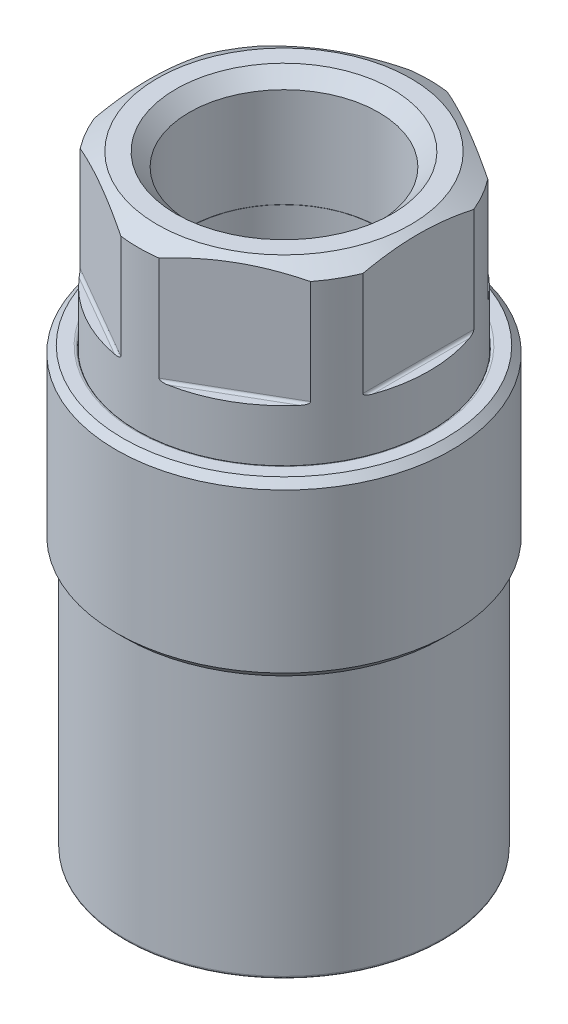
ISO-10303-21;
HEADER;
FILE_DESCRIPTION(('STEP AP214'),'2;1');
FILE_NAME('part.step','',(''),(''),'','','');
FILE_SCHEMA(('AUTOMOTIVE_DESIGN { 1 0 10303 214 1 1 1 1 }'));
ENDSEC;
DATA;
#1=APPLICATION_CONTEXT('core data for automotive mechanical design processes');
#2=APPLICATION_PROTOCOL_DEFINITION('international standard','automotive_design',2000,#1);
#3=PRODUCT_CONTEXT('',#1,'mechanical');
#4=PRODUCT('Part','Part','',(#3));
#5=PRODUCT_RELATED_PRODUCT_CATEGORY('part','',(#4));
#6=PRODUCT_DEFINITION_FORMATION('','',#4);
#7=PRODUCT_DEFINITION_CONTEXT('part definition',#1,'design');
#8=PRODUCT_DEFINITION('design','',#6,#7);
#9=PRODUCT_DEFINITION_SHAPE('','',#8);
#10=(LENGTH_UNIT() NAMED_UNIT(*) SI_UNIT(.MILLI.,.METRE.));
#11=(NAMED_UNIT(*) PLANE_ANGLE_UNIT() SI_UNIT($,.RADIAN.));
#12=(NAMED_UNIT(*) SI_UNIT($,.STERADIAN.) SOLID_ANGLE_UNIT());
#13=UNCERTAINTY_MEASURE_WITH_UNIT(LENGTH_MEASURE(1.E-05),#10,'distance_accuracy_value','');
#14=(GEOMETRIC_REPRESENTATION_CONTEXT(3) GLOBAL_UNCERTAINTY_ASSIGNED_CONTEXT((#13)) GLOBAL_UNIT_ASSIGNED_CONTEXT((#10,
#11,#12)) REPRESENTATION_CONTEXT('',''));
#15=CARTESIAN_POINT('',(0.,0.,0.));
#16=DIRECTION('',(0.,0.,1.));
#17=DIRECTION('',(1.,0.,0.));
#18=AXIS2_PLACEMENT_3D('',#15,#16,#17);
#19=CARTESIAN_POINT('',(0.,40.9575,0.));
#20=DIRECTION('',(0.,-1.,0.));
#21=DIRECTION('',(0.,0.,1.));
#22=AXIS2_PLACEMENT_3D('',#19,#20,#21);
#23=CONICAL_SURFACE('',#22,15.5448,0.785398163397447);
#24=CARTESIAN_POINT('',(0.,40.64,0.));
#25=DIRECTION('',(0.,1.,0.));
#26=DIRECTION('',(0.,0.,1.));
#27=AXIS2_PLACEMENT_3D('',#24,#25,#26);
#28=CIRCLE('',#27,15.8623);
#29=CARTESIAN_POINT('',(0.,40.64,-15.8623));
#30=VERTEX_POINT('',#29);
#31=CARTESIAN_POINT('',(0.,40.64,15.8623));
#32=VERTEX_POINT('',#31);
#33=EDGE_CURVE('P0_E11',#30,#32,#28,.T.);
#34=ORIENTED_EDGE('',*,*,#33,.T.);
#35=CARTESIAN_POINT('',(0.,40.64,0.));
#36=DIRECTION('',(0.,1.,0.));
#37=DIRECTION('',(0.,0.,1.));
#38=AXIS2_PLACEMENT_3D('',#35,#36,#37);
#39=CIRCLE('',#38,15.8623);
#40=EDGE_CURVE('P0_E26',#32,#30,#39,.T.);
#41=ORIENTED_EDGE('',*,*,#40,.T.);
#42=DIRECTION('',(0.,0.707106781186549,0.707106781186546));
#43=VECTOR('',#42,1.);
#44=CARTESIAN_POINT('',(0.,40.9575,-15.5448));
#45=LINE('',#44,#43);
#46=CARTESIAN_POINT('',(0.,41.275,-15.2273));
#47=VERTEX_POINT('',#46);
#48=EDGE_CURVE('P0_E178',#30,#47,#45,.T.);
#49=ORIENTED_EDGE('',*,*,#48,.T.);
#50=CARTESIAN_POINT('',(0.,41.275,0.));
#51=DIRECTION('',(0.,-1.,0.));
#52=DIRECTION('',(0.,0.,1.));
#53=AXIS2_PLACEMENT_3D('',#50,#51,#52);
#54=CIRCLE('',#53,15.2273);
#55=EDGE_CURVE('P0_E272',#47,#47,#54,.T.);
#56=ORIENTED_EDGE('',*,*,#55,.T.);
#57=ORIENTED_EDGE('',*,*,#48,.F.);
#58=EDGE_LOOP('',(#34,#41,#49,#56,#57));
#59=FACE_BOUND('',#58,.T.);
#60=ADVANCED_FACE('P0_F16',(#59),#23,.T.);
#61=CARTESIAN_POINT('',(0.,41.275,-15.8623));
#62=DIRECTION('',(0.,1.,0.));
#63=DIRECTION('',(1.,0.,0.));
#64=AXIS2_PLACEMENT_3D('',#61,#62,#63);
#65=PLANE('',#64);
#66=ORIENTED_EDGE('',*,*,#55,.F.);
#67=EDGE_LOOP('',(#66));
#68=FACE_BOUND('',#67,.T.);
#69=CARTESIAN_POINT('',(0.,41.275,0.));
#70=DIRECTION('',(0.,1.,0.));
#71=DIRECTION('',(0.,0.,1.));
#72=AXIS2_PLACEMENT_3D('',#69,#70,#71);
#73=CIRCLE('',#72,14.0335);
#74=CARTESIAN_POINT('',(0.,41.275,-14.0335));
#75=VERTEX_POINT('',#74);
#76=CARTESIAN_POINT('',(0.,41.275,14.0335));
#77=VERTEX_POINT('',#76);
#78=EDGE_CURVE('P0_E153',#75,#77,#73,.T.);
#79=ORIENTED_EDGE('',*,*,#78,.F.);
#80=CARTESIAN_POINT('',(0.,41.275,0.));
#81=DIRECTION('',(0.,1.,0.));
#82=DIRECTION('',(0.,0.,1.));
#83=AXIS2_PLACEMENT_3D('',#80,#81,#82);
#84=CIRCLE('',#83,14.0335);
#85=EDGE_CURVE('P0_E169',#77,#75,#84,.T.);
#86=ORIENTED_EDGE('',*,*,#85,.F.);
#87=EDGE_LOOP('',(#79,#86));
#88=FACE_BOUND('',#87,.T.);
#89=ADVANCED_FACE('P0_F258',(#68,#88),#65,.T.);
#90=CARTESIAN_POINT('',(0.,33.4645,0.));
#91=DIRECTION('',(0.,-1.,0.));
#92=DIRECTION('',(0.,0.,-1.));
#93=AXIS2_PLACEMENT_3D('',#90,#91,#92);
#94=CYLINDRICAL_SURFACE('',#93,15.8623);
#95=CARTESIAN_POINT('',(0.,25.654,0.));
#96=DIRECTION('',(0.,-1.,0.));
#97=DIRECTION('',(1.,0.,0.));
#98=AXIS2_PLACEMENT_3D('',#95,#96,#97);
#99=CIRCLE('',#98,15.8623);
#100=CARTESIAN_POINT('',(0.,25.654,-15.8623));
#101=VERTEX_POINT('',#100);
#102=CARTESIAN_POINT('',(0.,25.654,15.8623));
#103=VERTEX_POINT('',#102);
#104=EDGE_CURVE('P0_E161',#101,#103,#99,.T.);
#105=ORIENTED_EDGE('',*,*,#104,.F.);
#106=CARTESIAN_POINT('',(0.,25.654,0.));
#107=DIRECTION('',(0.,-1.,0.));
#108=DIRECTION('',(1.,0.,0.));
#109=AXIS2_PLACEMENT_3D('',#106,#107,#108);
#110=CIRCLE('',#109,15.8623);
#111=EDGE_CURVE('P0_E138',#103,#101,#110,.T.);
#112=ORIENTED_EDGE('',*,*,#111,.F.);
#113=DIRECTION('',(0.,1.,0.));
#114=VECTOR('',#113,1.);
#115=CARTESIAN_POINT('',(0.,33.4645,15.8623));
#116=LINE('',#115,#114);
#117=EDGE_CURVE('P0_E111',#103,#32,#116,.T.);
#118=ORIENTED_EDGE('',*,*,#117,.T.);
#119=ORIENTED_EDGE('',*,*,#33,.F.);
#120=ORIENTED_EDGE('',*,*,#40,.F.);
#121=ORIENTED_EDGE('',*,*,#117,.F.);
#122=EDGE_LOOP('',(#105,#112,#118,#119,#120,#121));
#123=FACE_BOUND('',#122,.T.);
#124=ADVANCED_FACE('P0_F264',(#123),#94,.T.);
#125=CARTESIAN_POINT('',(0.,4.953,0.));
#126=DIRECTION('',(0.,-1.,0.));
#127=DIRECTION('',(0.,0.,-1.));
#128=AXIS2_PLACEMENT_3D('',#125,#126,#127);
#129=TOROIDAL_SURFACE('',#128,12.446,0.254);
#130=CARTESIAN_POINT('',(0.,5.207,0.));
#131=DIRECTION('',(0.,1.,0.));
#132=DIRECTION('',(0.,0.,1.));
#133=AXIS2_PLACEMENT_3D('',#130,#131,#132);
#134=CIRCLE('',#133,12.446);
#135=CARTESIAN_POINT('',(0.,5.207,-12.446));
#136=VERTEX_POINT('',#135);
#137=CARTESIAN_POINT('',(0.,5.207,12.446));
#138=VERTEX_POINT('',#137);
#139=EDGE_CURVE('P0_E104',#136,#138,#134,.T.);
#140=ORIENTED_EDGE('',*,*,#139,.T.);
#141=CARTESIAN_POINT('',(0.,4.953,12.446));
#142=DIRECTION('',(-1.,0.,0.));
#143=DIRECTION('',(0.,0.,1.));
#144=AXIS2_PLACEMENT_3D('',#141,#142,#143);
#145=CIRCLE('',#144,0.254);
#146=CARTESIAN_POINT('',(0.,4.953,12.192));
#147=VERTEX_POINT('',#146);
#148=EDGE_CURVE('P0_E112',#138,#147,#145,.T.);
#149=ORIENTED_EDGE('',*,*,#148,.T.);
#150=CARTESIAN_POINT('',(0.,4.953,0.));
#151=DIRECTION('',(0.,-1.,0.));
#152=DIRECTION('',(0.,0.,1.));
#153=AXIS2_PLACEMENT_3D('',#150,#151,#152);
#154=CIRCLE('',#153,12.192);
#155=CARTESIAN_POINT('',(0.,4.953,-12.192));
#156=VERTEX_POINT('',#155);
#157=EDGE_CURVE('P0_E125',#147,#156,#154,.T.);
#158=ORIENTED_EDGE('',*,*,#157,.T.);
#159=CARTESIAN_POINT('',(0.,4.953,0.));
#160=DIRECTION('',(0.,-1.,0.));
#161=DIRECTION('',(0.,0.,1.));
#162=AXIS2_PLACEMENT_3D('',#159,#160,#161);
#163=CIRCLE('',#162,12.192);
#164=EDGE_CURVE('P0_E117',#156,#147,#163,.T.);
#165=ORIENTED_EDGE('',*,*,#164,.T.);
#166=ORIENTED_EDGE('',*,*,#148,.F.);
#167=CARTESIAN_POINT('',(0.,5.207,0.));
#168=DIRECTION('',(0.,1.,0.));
#169=DIRECTION('',(0.,0.,1.));
#170=AXIS2_PLACEMENT_3D('',#167,#168,#169);
#171=CIRCLE('',#170,12.446);
#172=EDGE_CURVE('P0_E107',#138,#136,#171,.T.);
#173=ORIENTED_EDGE('',*,*,#172,.T.);
#174=EDGE_LOOP('',(#140,#149,#158,#165,#166,#173));
#175=FACE_BOUND('',#174,.T.);
#176=ADVANCED_FACE('P0_F114',(#175),#129,.T.);
#177=CARTESIAN_POINT('',(0.,2.6035,0.));
#178=DIRECTION('',(0.,-1.,0.));
#179=DIRECTION('',(0.,0.,-1.));
#180=AXIS2_PLACEMENT_3D('',#177,#178,#179);
#181=CYLINDRICAL_SURFACE('',#180,12.192);
#182=CARTESIAN_POINT('',(0.,0.254,0.));
#183=DIRECTION('',(0.,1.,0.));
#184=DIRECTION('',(0.,0.,1.));
#185=AXIS2_PLACEMENT_3D('',#182,#183,#184);
#186=CIRCLE('',#185,12.192);
#187=CARTESIAN_POINT('',(0.,0.254,-12.192));
#188=VERTEX_POINT('',#187);
#189=CARTESIAN_POINT('',(0.,0.254,12.192));
#190=VERTEX_POINT('',#189);
#191=EDGE_CURVE('P0_E19',#188,#190,#186,.T.);
#192=ORIENTED_EDGE('',*,*,#191,.F.);
#193=CARTESIAN_POINT('',(0.,0.254,0.));
#194=DIRECTION('',(0.,1.,0.));
#195=DIRECTION('',(0.,0.,1.));
#196=AXIS2_PLACEMENT_3D('',#193,#194,#195);
#197=CIRCLE('',#196,12.192);
#198=EDGE_CURVE('P0_E184',#190,#188,#197,.T.);
#199=ORIENTED_EDGE('',*,*,#198,.F.);
#200=DIRECTION('',(0.,1.,0.));
#201=VECTOR('',#200,1.);
#202=CARTESIAN_POINT('',(0.,2.6035,12.192));
#203=LINE('',#202,#201);
#204=EDGE_CURVE('P0_E118',#190,#147,#203,.T.);
#205=ORIENTED_EDGE('',*,*,#204,.T.);
#206=ORIENTED_EDGE('',*,*,#164,.F.);
#207=ORIENTED_EDGE('',*,*,#157,.F.);
#208=ORIENTED_EDGE('',*,*,#204,.F.);
#209=EDGE_LOOP('',(#192,#199,#205,#206,#207,#208));
#210=FACE_BOUND('',#209,.T.);
#211=ADVANCED_FACE('P0_F304',(#210),#181,.F.);
#212=CARTESIAN_POINT('',(0.,5.207,-13.7795));
#213=DIRECTION('',(0.,1.,0.));
#214=DIRECTION('',(1.,0.,0.));
#215=AXIS2_PLACEMENT_3D('',#212,#213,#214);
#216=PLANE('',#215);
#217=CARTESIAN_POINT('',(0.,5.207,0.));
#218=DIRECTION('',(0.,-1.,0.));
#219=DIRECTION('',(1.,0.,0.));
#220=AXIS2_PLACEMENT_3D('',#217,#218,#219);
#221=CIRCLE('',#220,13.7795);
#222=CARTESIAN_POINT('',(0.,5.207,-13.7795));
#223=VERTEX_POINT('',#222);
#224=CARTESIAN_POINT('',(0.,5.207,13.7795));
#225=VERTEX_POINT('',#224);
#226=EDGE_CURVE('P0_E165',#223,#225,#221,.T.);
#227=ORIENTED_EDGE('',*,*,#226,.F.);
#228=CARTESIAN_POINT('',(0.,5.207,0.));
#229=DIRECTION('',(0.,-1.,0.));
#230=DIRECTION('',(1.,0.,0.));
#231=AXIS2_PLACEMENT_3D('',#228,#229,#230);
#232=CIRCLE('',#231,13.7795);
#233=EDGE_CURVE('P0_E137',#225,#223,#232,.T.);
#234=ORIENTED_EDGE('',*,*,#233,.F.);
#235=EDGE_LOOP('',(#227,#234));
#236=FACE_BOUND('',#235,.T.);
#237=ORIENTED_EDGE('',*,*,#139,.F.);
#238=ORIENTED_EDGE('',*,*,#172,.F.);
#239=EDGE_LOOP('',(#237,#238));
#240=FACE_BOUND('',#239,.T.);
#241=ADVANCED_FACE('P0_F106',(#236,#240),#216,.T.);
#242=CARTESIAN_POINT('',(0.,0.254,0.));
#243=DIRECTION('',(0.,-1.,0.));
#244=DIRECTION('',(0.,0.,-1.));
#245=AXIS2_PLACEMENT_3D('',#242,#243,#244);
#246=TOROIDAL_SURFACE('',#245,12.446,0.254);
#247=ORIENTED_EDGE('',*,*,#191,.T.);
#248=CARTESIAN_POINT('',(0.,0.254,12.446));
#249=DIRECTION('',(-1.,0.,0.));
#250=DIRECTION('',(0.,0.,1.));
#251=AXIS2_PLACEMENT_3D('',#248,#249,#250);
#252=CIRCLE('',#251,0.254);
#253=CARTESIAN_POINT('',(0.,0.,12.446));
#254=VERTEX_POINT('',#253);
#255=EDGE_CURVE('P0_E240',#190,#254,#252,.T.);
#256=ORIENTED_EDGE('',*,*,#255,.T.);
#257=CARTESIAN_POINT('',(0.,0.,0.));
#258=DIRECTION('',(0.,-1.,0.));
#259=DIRECTION('',(0.,0.,1.));
#260=AXIS2_PLACEMENT_3D('',#257,#258,#259);
#261=CIRCLE('',#260,12.446);
#262=CARTESIAN_POINT('',(0.,0.,-12.446));
#263=VERTEX_POINT('',#262);
#264=EDGE_CURVE('P0_E183',#254,#263,#261,.T.);
#265=ORIENTED_EDGE('',*,*,#264,.T.);
#266=CARTESIAN_POINT('',(0.,0.,0.));
#267=DIRECTION('',(0.,-1.,0.));
#268=DIRECTION('',(0.,0.,1.));
#269=AXIS2_PLACEMENT_3D('',#266,#267,#268);
#270=CIRCLE('',#269,12.446);
#271=EDGE_CURVE('P0_E179',#263,#254,#270,.T.);
#272=ORIENTED_EDGE('',*,*,#271,.T.);
#273=ORIENTED_EDGE('',*,*,#255,.F.);
#274=ORIENTED_EDGE('',*,*,#198,.T.);
#275=EDGE_LOOP('',(#247,#256,#265,#272,#273,#274));
#276=FACE_BOUND('',#275,.T.);
#277=ADVANCED_FACE('P0_F238',(#276),#246,.T.);
#278=CARTESIAN_POINT('',(0.,0.,-12.192));
#279=DIRECTION('',(0.,-1.,0.));
#280=DIRECTION('',(0.,0.,-1.));
#281=AXIS2_PLACEMENT_3D('',#278,#279,#280);
#282=PLANE('',#281);
#283=CARTESIAN_POINT('',(0.,0.,0.));
#284=DIRECTION('',(0.,1.,0.));
#285=DIRECTION('',(0.,0.,1.));
#286=AXIS2_PLACEMENT_3D('',#283,#284,#285);
#287=CIRCLE('',#286,14.8082);
#288=CARTESIAN_POINT('',(0.,0.,-14.8082));
#289=VERTEX_POINT('',#288);
#290=CARTESIAN_POINT('',(0.,0.,14.8082));
#291=VERTEX_POINT('',#290);
#292=EDGE_CURVE('P0_E148',#289,#291,#287,.T.);
#293=ORIENTED_EDGE('',*,*,#292,.F.);
#294=CARTESIAN_POINT('',(0.,0.,0.));
#295=DIRECTION('',(0.,1.,0.));
#296=DIRECTION('',(0.,0.,1.));
#297=AXIS2_PLACEMENT_3D('',#294,#295,#296);
#298=CIRCLE('',#297,14.8082);
#299=EDGE_CURVE('P0_E139',#291,#289,#298,.T.);
#300=ORIENTED_EDGE('',*,*,#299,.F.);
#301=EDGE_LOOP('',(#293,#300));
#302=FACE_BOUND('',#301,.T.);
#303=ORIENTED_EDGE('',*,*,#271,.F.);
#304=ORIENTED_EDGE('',*,*,#264,.F.);
#305=EDGE_LOOP('',(#303,#304));
#306=FACE_BOUND('',#305,.T.);
#307=ADVANCED_FACE('P0_F243',(#302,#306),#282,.T.);
#308=CARTESIAN_POINT('',(0.,0.254,0.));
#309=DIRECTION('',(0.,-1.,0.));
#310=DIRECTION('',(0.,0.,-1.));
#311=AXIS2_PLACEMENT_3D('',#308,#309,#310);
#312=TOROIDAL_SURFACE('',#311,14.8082,0.254);
#313=ORIENTED_EDGE('',*,*,#292,.T.);
#314=CARTESIAN_POINT('',(0.,0.254,14.8082));
#315=DIRECTION('',(-1.,0.,0.));
#316=DIRECTION('',(0.,0.,1.));
#317=AXIS2_PLACEMENT_3D('',#314,#315,#316);
#318=CIRCLE('',#317,0.254);
#319=CARTESIAN_POINT('',(0.,0.254,15.0622));
#320=VERTEX_POINT('',#319);
#321=EDGE_CURVE('P0_E144',#291,#320,#318,.T.);
#322=ORIENTED_EDGE('',*,*,#321,.T.);
#323=CARTESIAN_POINT('',(0.,0.254,0.));
#324=DIRECTION('',(0.,-1.,0.));
#325=DIRECTION('',(0.,0.,1.));
#326=AXIS2_PLACEMENT_3D('',#323,#324,#325);
#327=CIRCLE('',#326,15.0622);
#328=CARTESIAN_POINT('',(0.,0.254,-15.0622));
#329=VERTEX_POINT('',#328);
#330=EDGE_CURVE('P0_E149',#320,#329,#327,.T.);
#331=ORIENTED_EDGE('',*,*,#330,.T.);
#332=CARTESIAN_POINT('',(0.,0.254,0.));
#333=DIRECTION('',(0.,-1.,0.));
#334=DIRECTION('',(0.,0.,1.));
#335=AXIS2_PLACEMENT_3D('',#332,#333,#334);
#336=CIRCLE('',#335,15.0622);
#337=EDGE_CURVE('P0_E143',#329,#320,#336,.T.);
#338=ORIENTED_EDGE('',*,*,#337,.T.);
#339=ORIENTED_EDGE('',*,*,#321,.F.);
#340=ORIENTED_EDGE('',*,*,#299,.T.);
#341=EDGE_LOOP('',(#313,#322,#331,#338,#339,#340));
#342=FACE_BOUND('',#341,.T.);
#343=ADVANCED_FACE('P0_F245',(#342),#312,.T.);
#344=CARTESIAN_POINT('',(0.,12.42695,0.));
#345=DIRECTION('',(0.,-1.,0.));
#346=DIRECTION('',(0.,0.,-1.));
#347=AXIS2_PLACEMENT_3D('',#344,#345,#346);
#348=CYLINDRICAL_SURFACE('',#347,15.0622);
#349=ORIENTED_EDGE('',*,*,#337,.F.);
#350=ORIENTED_EDGE('',*,*,#330,.F.);
#351=DIRECTION('',(0.,1.,0.));
#352=VECTOR('',#351,1.);
#353=CARTESIAN_POINT('',(0.,12.42695,15.0622));
#354=LINE('',#353,#352);
#355=CARTESIAN_POINT('',(0.,24.8539,15.0622));
#356=VERTEX_POINT('',#355);
#357=EDGE_CURVE('P0_E131',#320,#356,#354,.T.);
#358=ORIENTED_EDGE('',*,*,#357,.T.);
#359=CARTESIAN_POINT('',(0.,24.8539,0.));
#360=DIRECTION('',(0.,-1.,0.));
#361=DIRECTION('',(1.,0.,0.));
#362=AXIS2_PLACEMENT_3D('',#359,#360,#361);
#363=CIRCLE('',#362,15.0622);
#364=CARTESIAN_POINT('',(0.,24.8539,-15.0622));
#365=VERTEX_POINT('',#364);
#366=EDGE_CURVE('P0_E152',#356,#365,#363,.T.);
#367=ORIENTED_EDGE('',*,*,#366,.T.);
#368=CARTESIAN_POINT('',(0.,24.8539,0.));
#369=DIRECTION('',(0.,-1.,0.));
#370=DIRECTION('',(1.,0.,0.));
#371=AXIS2_PLACEMENT_3D('',#368,#369,#370);
#372=CIRCLE('',#371,15.0622);
#373=EDGE_CURVE('P0_E150',#365,#356,#372,.T.);
#374=ORIENTED_EDGE('',*,*,#373,.T.);
#375=ORIENTED_EDGE('',*,*,#357,.F.);
#376=EDGE_LOOP('',(#349,#350,#358,#367,#374,#375));
#377=FACE_BOUND('',#376,.T.);
#378=ADVANCED_FACE('P0_F212',(#377),#348,.T.);
#379=CARTESIAN_POINT('',(0.,41.021,0.));
#380=DIRECTION('',(0.,-1.,0.));
#381=DIRECTION('',(0.,0.,-1.));
#382=AXIS2_PLACEMENT_3D('',#379,#380,#381);
#383=TOROIDAL_SURFACE('',#382,14.0335,0.254);
#384=ORIENTED_EDGE('',*,*,#78,.T.);
#385=CARTESIAN_POINT('',(0.,41.021,14.0335));
#386=DIRECTION('',(-1.,0.,0.));
#387=DIRECTION('',(0.,0.,1.));
#388=AXIS2_PLACEMENT_3D('',#385,#386,#387);
#389=CIRCLE('',#388,0.254);
#390=CARTESIAN_POINT('',(0.,41.021,13.7795));
#391=VERTEX_POINT('',#390);
#392=EDGE_CURVE('P0_E159',#77,#391,#389,.T.);
#393=ORIENTED_EDGE('',*,*,#392,.T.);
#394=CARTESIAN_POINT('',(0.,41.021,0.));
#395=DIRECTION('',(0.,-1.,0.));
#396=DIRECTION('',(0.,0.,1.));
#397=AXIS2_PLACEMENT_3D('',#394,#395,#396);
#398=CIRCLE('',#397,13.7795);
#399=CARTESIAN_POINT('',(0.,41.021,-13.7795));
#400=VERTEX_POINT('',#399);
#401=EDGE_CURVE('P0_E155',#391,#400,#398,.T.);
#402=ORIENTED_EDGE('',*,*,#401,.T.);
#403=CARTESIAN_POINT('',(0.,41.021,0.));
#404=DIRECTION('',(0.,-1.,0.));
#405=DIRECTION('',(0.,0.,1.));
#406=AXIS2_PLACEMENT_3D('',#403,#404,#405);
#407=CIRCLE('',#406,13.7795);
#408=EDGE_CURVE('P0_E160',#400,#391,#407,.T.);
#409=ORIENTED_EDGE('',*,*,#408,.T.);
#410=ORIENTED_EDGE('',*,*,#392,.F.);
#411=ORIENTED_EDGE('',*,*,#85,.T.);
#412=EDGE_LOOP('',(#384,#393,#402,#409,#410,#411));
#413=FACE_BOUND('',#412,.T.);
#414=ADVANCED_FACE('P0_F452',(#413),#383,.T.);
#415=CARTESIAN_POINT('',(0.,23.241,0.));
#416=DIRECTION('',(0.,-1.,0.));
#417=DIRECTION('',(0.,0.,-1.));
#418=AXIS2_PLACEMENT_3D('',#415,#416,#417);
#419=CYLINDRICAL_SURFACE('',#418,13.7795);
#420=ORIENTED_EDGE('',*,*,#226,.T.);
#421=DIRECTION('',(0.,1.,0.));
#422=VECTOR('',#421,1.);
#423=CARTESIAN_POINT('',(0.,23.241,13.7795));
#424=LINE('',#423,#422);
#425=EDGE_CURVE('P0_E170',#225,#391,#424,.T.);
#426=ORIENTED_EDGE('',*,*,#425,.T.);
#427=ORIENTED_EDGE('',*,*,#408,.F.);
#428=ORIENTED_EDGE('',*,*,#401,.F.);
#429=ORIENTED_EDGE('',*,*,#425,.F.);
#430=ORIENTED_EDGE('',*,*,#233,.T.);
#431=EDGE_LOOP('',(#420,#426,#427,#428,#429,#430));
#432=FACE_BOUND('',#431,.T.);
#433=ADVANCED_FACE('P0_F439',(#432),#419,.F.);
#434=CARTESIAN_POINT('',(0.,25.25395,0.));
#435=DIRECTION('',(0.,1.,0.));
#436=DIRECTION('',(0.,0.,-1.));
#437=AXIS2_PLACEMENT_3D('',#434,#435,#436);
#438=CONICAL_SURFACE('',#437,15.46225,0.785398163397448);
#439=ORIENTED_EDGE('',*,*,#373,.F.);
#440=ORIENTED_EDGE('',*,*,#366,.F.);
#441=DIRECTION('',(0.,0.707106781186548,0.707106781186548));
#442=VECTOR('',#441,1.);
#443=CARTESIAN_POINT('',(0.,25.25395,15.46225));
#444=LINE('',#443,#442);
#445=EDGE_CURVE('P0_E133',#356,#103,#444,.T.);
#446=ORIENTED_EDGE('',*,*,#445,.T.);
#447=ORIENTED_EDGE('',*,*,#111,.T.);
#448=ORIENTED_EDGE('',*,*,#104,.T.);
#449=ORIENTED_EDGE('',*,*,#445,.F.);
#450=EDGE_LOOP('',(#439,#440,#446,#447,#448,#449));
#451=FACE_BOUND('',#450,.T.);
#452=ADVANCED_FACE('P0_F214',(#451),#438,.T.);
#453=CLOSED_SHELL('',(#60,#89,#124,#176,#211,#241,#277,#307,#343,#378,#414,#433,#452));
#454=MANIFOLD_SOLID_BREP('P0_B1',#453);
#455=CARTESIAN_POINT('',(0.,56.515,0.));
#456=DIRECTION('',(0.,1.,0.));
#457=DIRECTION('',(0.,0.,-1.));
#458=AXIS2_PLACEMENT_3D('',#455,#456,#457);
#459=CONICAL_SURFACE('',#458,9.5885,0.785398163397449);
#460=CARTESIAN_POINT('',(0.,57.15,0.));
#461=DIRECTION('',(0.,1.,0.));
#462=DIRECTION('',(0.,0.,-1.));
#463=AXIS2_PLACEMENT_3D('',#460,#461,#462);
#464=CIRCLE('',#463,10.2235);
#465=CARTESIAN_POINT('',(0.,57.15,10.2235));
#466=VERTEX_POINT('',#465);
#467=EDGE_CURVE('P1_E11',#466,#466,#464,.T.);
#468=ORIENTED_EDGE('',*,*,#467,.T.);
#469=DIRECTION('',(0.,-0.707106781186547,-0.707106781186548));
#470=VECTOR('',#469,1.);
#471=CARTESIAN_POINT('',(0.,56.515,9.5885));
#472=LINE('',#471,#470);
#473=CARTESIAN_POINT('',(0.,55.88,8.9535));
#474=VERTEX_POINT('',#473);
#475=EDGE_CURVE('P1_E27',#466,#474,#472,.T.);
#476=ORIENTED_EDGE('',*,*,#475,.T.);
#477=CARTESIAN_POINT('',(0.,55.88,0.));
#478=DIRECTION('',(0.,-1.,0.));
#479=DIRECTION('',(0.,0.,-1.));
#480=AXIS2_PLACEMENT_3D('',#477,#478,#479);
#481=CIRCLE('',#480,8.9535);
#482=CARTESIAN_POINT('',(0.,55.88,-8.9535));
#483=VERTEX_POINT('',#482);
#484=EDGE_CURVE('P1_E768',#474,#483,#481,.T.);
#485=ORIENTED_EDGE('',*,*,#484,.T.);
#486=CARTESIAN_POINT('',(0.,55.88,0.));
#487=DIRECTION('',(0.,-1.,0.));
#488=DIRECTION('',(0.,0.,-1.));
#489=AXIS2_PLACEMENT_3D('',#486,#487,#488);
#490=CIRCLE('',#489,8.9535);
#491=EDGE_CURVE('P1_E479',#483,#474,#490,.T.);
#492=ORIENTED_EDGE('',*,*,#491,.T.);
#493=ORIENTED_EDGE('',*,*,#475,.F.);
#494=EDGE_LOOP('',(#468,#476,#485,#492,#493));
#495=FACE_BOUND('',#494,.T.);
#496=ADVANCED_FACE('P1_F16',(#495),#459,.F.);
#497=CARTESIAN_POINT('',(0.,51.816,0.));
#498=DIRECTION('',(0.,-1.,0.));
#499=DIRECTION('',(0.,0.,1.));
#500=AXIS2_PLACEMENT_3D('',#497,#498,#499);
#501=CYLINDRICAL_SURFACE('',#500,8.9535);
#502=ORIENTED_EDGE('',*,*,#484,.F.);
#503=ORIENTED_EDGE('',*,*,#491,.F.);
#504=DIRECTION('',(0.,-1.,0.));
#505=VECTOR('',#504,1.);
#506=CARTESIAN_POINT('',(0.,51.816,-8.9535));
#507=LINE('',#506,#505);
#508=CARTESIAN_POINT('',(0.,46.482,-8.9535));
#509=VERTEX_POINT('',#508);
#510=EDGE_CURVE('P1_E475',#483,#509,#507,.T.);
#511=ORIENTED_EDGE('',*,*,#510,.T.);
#512=CARTESIAN_POINT('',(0.,46.482,0.));
#513=DIRECTION('',(0.,-1.,0.));
#514=DIRECTION('',(0.,0.,1.));
#515=AXIS2_PLACEMENT_3D('',#512,#513,#514);
#516=CIRCLE('',#515,8.9535);
#517=CARTESIAN_POINT('',(0.,46.482,8.9535));
#518=VERTEX_POINT('',#517);
#519=EDGE_CURVE('P1_E480',#509,#518,#516,.T.);
#520=ORIENTED_EDGE('',*,*,#519,.T.);
#521=CARTESIAN_POINT('',(0.,46.482,0.));
#522=DIRECTION('',(0.,-1.,0.));
#523=DIRECTION('',(0.,0.,1.));
#524=AXIS2_PLACEMENT_3D('',#521,#522,#523);
#525=CIRCLE('',#524,8.9535);
#526=EDGE_CURVE('P1_E751',#518,#509,#525,.T.);
#527=ORIENTED_EDGE('',*,*,#526,.T.);
#528=ORIENTED_EDGE('',*,*,#510,.F.);
#529=EDGE_LOOP('',(#502,#503,#511,#520,#527,#528));
#530=FACE_BOUND('',#529,.T.);
#531=ADVANCED_FACE('P1_F879',(#530),#501,.F.);
#532=CARTESIAN_POINT('',(0.,57.15,-13.7414));
#533=DIRECTION('',(0.,1.,0.));
#534=DIRECTION('',(1.,0.,0.));
#535=AXIS2_PLACEMENT_3D('',#532,#533,#534);
#536=PLANE('',#535);
#537=CARTESIAN_POINT('',(0.,57.15,0.));
#538=DIRECTION('',(0.,-1.,0.));
#539=DIRECTION('',(0.,0.,1.));
#540=AXIS2_PLACEMENT_3D('',#537,#538,#539);
#541=CIRCLE('',#540,11.98163637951);
#542=CARTESIAN_POINT('',(0.,57.15,-11.98163637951));
#543=VERTEX_POINT('',#542);
#544=EDGE_CURVE('P1_E367',#543,#543,#541,.T.);
#545=ORIENTED_EDGE('',*,*,#544,.F.);
#546=EDGE_LOOP('',(#545));
#547=FACE_BOUND('',#546,.T.);
#548=ORIENTED_EDGE('',*,*,#467,.F.);
#549=EDGE_LOOP('',(#548));
#550=FACE_BOUND('',#549,.T.);
#551=ADVANCED_FACE('P1_F510',(#547,#550),#536,.T.);
#552=CARTESIAN_POINT('',(12.954,46.3042,3.66617420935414));
#553=DIRECTION('',(0.,0.,-1.));
#554=DIRECTION('',(-0.707106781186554,-0.707106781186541,0.));
#555=AXIS2_PLACEMENT_3D('',#552,#553,#554);
#556=CYLINDRICAL_SURFACE('',#555,0.254);
#557=CARTESIAN_POINT('',(12.7,46.3042,5.24748263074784));
#558=CARTESIAN_POINT('',(12.6999999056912,46.3023080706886,5.24748285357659));
#559=CARTESIAN_POINT('',(12.7000211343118,46.3004162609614,5.24742961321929));
#560=CARTESIAN_POINT('',(12.7001057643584,46.2966297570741,5.24721793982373));
#561=CARTESIAN_POINT('',(12.7001693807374,46.2947350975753,5.24705897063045));
#562=CARTESIAN_POINT('',(12.7003389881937,46.2909438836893,5.24663590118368));
#563=CARTESIAN_POINT('',(12.7004453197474,46.2890474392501,5.24637095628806));
#564=CARTESIAN_POINT('',(12.7007004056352,46.2852535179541,5.2457363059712));
#565=CARTESIAN_POINT('',(12.7008496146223,46.2833562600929,5.24536547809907));
#566=CARTESIAN_POINT('',(12.7011905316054,46.279561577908,5.24451931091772));
#567=CARTESIAN_POINT('',(12.7013827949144,46.2776645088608,5.24404260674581));
#568=CARTESIAN_POINT('',(12.7018098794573,46.2738710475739,5.24298492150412));
#569=CARTESIAN_POINT('',(12.7020453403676,46.2719751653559,5.24240237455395));
#570=CARTESIAN_POINT('',(12.7025588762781,46.2681849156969,5.24113318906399));
#571=CARTESIAN_POINT('',(12.7028376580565,46.2662912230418,5.24044482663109));
#572=CARTESIAN_POINT('',(12.7034378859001,46.2625061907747,5.23896415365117));
#573=CARTESIAN_POINT('',(12.7037600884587,46.2606156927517,5.23817000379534));
#574=CARTESIAN_POINT('',(12.7044472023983,46.2568378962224,5.23647785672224));
#575=CARTESIAN_POINT('',(12.704812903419,46.254951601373,5.23557794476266));
#576=CARTESIAN_POINT('',(12.7055870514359,46.251183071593,5.23367433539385));
#577=CARTESIAN_POINT('',(12.7059963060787,46.2493019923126,5.23266868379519));
#578=CARTESIAN_POINT('',(12.7068575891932,46.2455447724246,5.2305536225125));
#579=CARTESIAN_POINT('',(12.7073104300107,46.2436699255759,5.22944225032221));
#580=CARTESIAN_POINT('',(12.7082589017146,46.2399260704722,5.2271157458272));
#581=CARTESIAN_POINT('',(12.7087553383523,46.2380584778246,5.22589866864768));
#582=CARTESIAN_POINT('',(12.7097910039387,46.2343300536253,5.22336072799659));
#583=CARTESIAN_POINT('',(12.7103310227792,46.2324707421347,5.22203795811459));
#584=CARTESIAN_POINT('',(12.7114538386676,46.2287598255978,5.21928858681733));
#585=CARTESIAN_POINT('',(12.7120374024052,46.2269098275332,5.21786013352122));
#586=CARTESIAN_POINT('',(12.7132472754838,46.2232185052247,5.21489933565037));
#587=CARTESIAN_POINT('',(12.7138743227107,46.2213788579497,5.21336520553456));
#588=CARTESIAN_POINT('',(12.7151711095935,46.2177092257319,5.21019298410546));
#589=CARTESIAN_POINT('',(12.7158415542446,46.2158809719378,5.20855318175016));
#590=CARTESIAN_POINT('',(12.7172250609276,46.2122351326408,5.20516953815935));
#591=CARTESIAN_POINT('',(12.717938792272,46.2104193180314,5.20342406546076));
#592=CARTESIAN_POINT('',(12.7194087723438,46.2067993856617,5.19982900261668));
#593=CARTESIAN_POINT('',(12.7201656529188,46.2049970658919,5.19797786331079));
#594=CARTESIAN_POINT('',(12.7217218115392,46.2014051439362,5.19417137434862));
#595=CARTESIAN_POINT('',(12.7225216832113,46.1996173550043,5.19221455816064));
#596=CARTESIAN_POINT('',(12.7241636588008,46.1960556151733,5.1881966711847));
#597=CARTESIAN_POINT('',(12.7250063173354,46.1942834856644,5.1861342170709));
#598=CARTESIAN_POINT('',(12.7276336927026,46.188915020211,5.17970142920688));
#599=CARTESIAN_POINT('',(12.7294488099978,46.1854250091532,5.17525436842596));
#600=CARTESIAN_POINT('',(12.7332434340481,46.1785060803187,5.1659476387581));
#601=CARTESIAN_POINT('',(12.7352264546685,46.17509152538,5.16107880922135));
#602=CARTESIAN_POINT('',(12.7393551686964,46.1683319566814,5.15092692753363));
#603=CARTESIAN_POINT('',(12.7415038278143,46.1650009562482,5.14563578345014));
#604=CARTESIAN_POINT('',(12.7459613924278,46.158417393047,5.13463834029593));
#605=CARTESIAN_POINT('',(12.7482727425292,46.1551784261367,5.1289249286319));
#606=CARTESIAN_POINT('',(12.7530528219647,46.1487877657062,5.1170820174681));
#607=CARTESIAN_POINT('',(12.755523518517,46.1456491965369,5.1109462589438));
#608=CARTESIAN_POINT('',(12.7606189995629,46.1394680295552,5.09825771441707));
#609=CARTESIAN_POINT('',(12.7632453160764,46.1364380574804,5.09169940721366));
#610=CARTESIAN_POINT('',(12.7672791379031,46.1319918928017,5.08159447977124));
#611=CARTESIAN_POINT('',(12.7686785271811,46.1304873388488,5.07808312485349));
#612=CARTESIAN_POINT('',(12.771516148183,46.127508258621,5.07095074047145));
#613=CARTESIAN_POINT('',(12.7729545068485,46.1260353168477,5.06732909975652));
#614=CARTESIAN_POINT('',(12.7791816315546,46.1198078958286,5.05161914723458));
#615=CARTESIAN_POINT('',(12.7839906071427,46.1153798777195,5.03940865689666));
#616=CARTESIAN_POINT('',(12.796006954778,46.1050920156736,5.00875396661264));
#617=CARTESIAN_POINT('',(12.8032316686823,46.0995978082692,4.99019500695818));
#618=CARTESIAN_POINT('',(12.8185399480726,46.0891138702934,4.95064741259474));
#619=CARTESIAN_POINT('',(12.826626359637,46.0842556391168,4.92962566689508));
#620=CARTESIAN_POINT('',(12.8448204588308,46.0745756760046,4.88199891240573));
#621=CARTESIAN_POINT('',(12.8549219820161,46.0700740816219,4.8553267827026));
#622=CARTESIAN_POINT('',(12.8709067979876,46.0640926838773,4.81270483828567));
#623=CARTESIAN_POINT('',(12.876825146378,46.0621300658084,4.79683245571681));
#624=CARTESIAN_POINT('',(12.8901119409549,46.05824571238,4.76103834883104));
#625=CARTESIAN_POINT('',(12.8974720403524,46.0564575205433,4.74109882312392));
#626=CARTESIAN_POINT('',(12.912780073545,46.0534349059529,4.69936563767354));
#627=CARTESIAN_POINT('',(12.9207218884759,46.0522640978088,4.67756522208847));
#628=CARTESIAN_POINT('',(12.9371431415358,46.0506155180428,4.63210716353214));
#629=CARTESIAN_POINT('',(12.9456132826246,46.0502024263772,4.60844377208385));
#630=CARTESIAN_POINT('',(12.954,46.0502,4.58475276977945));
#631=B_SPLINE_CURVE_WITH_KNOTS('',3,(#557,#558,#559,#560,#561,#562,#563,#564,#565,#566,#567,
#568,#569,#570,#571,#572,#573,#574,#575,#576,#577,#578,#579,#580,#581,#582,#583,#584,#585,#586,
#587,#588,#589,#590,#591,#592,#593,#594,#595,#596,#597,#598,#599,#600,#601,#602,#603,#604,#605,
#606,#607,#608,#609,#610,#611,#612,#613,#614,#615,#616,#617,#618,#619,#620,#621,#622,#623,#624,
#625,#626,#627,#628,#629,#630),.UNSPECIFIED.,.F.,.F.,(4,2,2,2,2,2,2,2,2,2,2,2,2,2,2,2,2,2,2,2,2,
2,2,2,2,2,2,2,2,2,2,2,2,2,2,2,4),(0.,0.00567473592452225,0.0113784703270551,0.017128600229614,
0.0229421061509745,0.0288354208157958,0.0348243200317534,0.0409238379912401,0.0471482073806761,
0.053510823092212,0.0600242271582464,0.0667001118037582,0.0735493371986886,0.0805819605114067,
0.0878072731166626,0.0952338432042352,0.102869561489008,0.11072168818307,0.118796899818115,
0.127101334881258,0.135640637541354,0.15344252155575,0.172241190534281,0.192067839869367,
0.212949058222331,0.23490760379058,0.257963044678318,0.270167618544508,0.282664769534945,
0.324196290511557,0.386136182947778,0.455227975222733,0.541798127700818,0.592952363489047,
0.656928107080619,0.726609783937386,0.802003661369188),.UNSPECIFIED.);
#632=CARTESIAN_POINT('',(12.7,46.3042,5.24748263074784));
#633=VERTEX_POINT('',#632);
#634=CARTESIAN_POINT('',(12.954,46.0502,4.58475276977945));
#635=VERTEX_POINT('',#634);
#636=EDGE_CURVE('P1_E492',#633,#635,#631,.T.);
#637=ORIENTED_EDGE('',*,*,#636,.T.);
#638=DIRECTION('',(0.,0.,-1.));
#639=VECTOR('',#638,1.);
#640=CARTESIAN_POINT('',(12.954,46.0502,3.66617420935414));
#641=LINE('',#640,#639);
#642=CARTESIAN_POINT('',(12.954,46.0502,-4.58475276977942));
#643=VERTEX_POINT('',#642);
#644=EDGE_CURVE('P1_E1024',#635,#643,#641,.T.);
#645=ORIENTED_EDGE('',*,*,#644,.T.);
#646=CARTESIAN_POINT('',(12.954,46.0502,-4.58475276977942));
#647=CARTESIAN_POINT('',(12.9447538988,46.0502031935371,-4.61087382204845));
#648=CARTESIAN_POINT('',(12.9353976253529,46.050705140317,-4.63695931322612));
#649=CARTESIAN_POINT('',(12.9172343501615,46.0527207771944,-4.68707559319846));
#650=CARTESIAN_POINT('',(12.9084387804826,46.0541557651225,-4.71111375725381));
#651=CARTESIAN_POINT('',(12.8914767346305,46.0578751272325,-4.75713660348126));
#652=CARTESIAN_POINT('',(12.8833169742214,46.060081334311,-4.77912998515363));
#653=CARTESIAN_POINT('',(12.8676751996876,46.0651902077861,-4.82106090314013));
#654=CARTESIAN_POINT('',(12.8601966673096,46.0680145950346,-4.841009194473));
#655=CARTESIAN_POINT('',(12.8459420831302,46.0742130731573,-4.87884832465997));
#656=CARTESIAN_POINT('',(12.8391676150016,46.077508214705,-4.8967525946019));
#657=CARTESIAN_POINT('',(12.8263174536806,46.0845162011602,-4.93049920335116));
#658=CARTESIAN_POINT('',(12.8202437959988,46.0881477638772,-4.94635896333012));
#659=CARTESIAN_POINT('',(12.8100841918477,46.0948487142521,-4.9726719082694));
#660=CARTESIAN_POINT('',(12.8060041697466,46.0977077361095,-4.98318101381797));
#661=CARTESIAN_POINT('',(12.7980666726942,46.1036405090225,-5.0035505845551));
#662=CARTESIAN_POINT('',(12.79420867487,46.1066953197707,-5.01341632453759));
#663=CARTESIAN_POINT('',(12.7876293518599,46.1122376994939,-5.0301786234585));
#664=CARTESIAN_POINT('',(12.7849037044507,46.1146319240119,-5.03710439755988));
#665=CARTESIAN_POINT('',(12.7795813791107,46.1195201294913,-5.05059601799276));
#666=CARTESIAN_POINT('',(12.7769841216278,46.1220056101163,-5.05716469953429));
#667=CARTESIAN_POINT('',(12.7729542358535,46.1260355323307,-5.06732888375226));
#668=CARTESIAN_POINT('',(12.7715160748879,46.127508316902,-5.07095068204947));
#669=CARTESIAN_POINT('',(12.7686785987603,46.1304872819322,-5.07808318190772));
#670=CARTESIAN_POINT('',(12.7672791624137,46.131991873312,-5.08159449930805));
#671=CARTESIAN_POINT('',(12.7632452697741,46.1364380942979,-5.09169937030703));
#672=CARTESIAN_POINT('',(12.7606189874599,46.139468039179,-5.09825770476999));
#673=CARTESIAN_POINT('',(12.7555235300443,46.145649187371,-5.1109462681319));
#674=CARTESIAN_POINT('',(12.7530528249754,46.1487877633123,-5.11708201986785));
#675=CARTESIAN_POINT('',(12.7482727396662,46.1551784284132,-5.12892492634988));
#676=CARTESIAN_POINT('',(12.7459613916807,46.158417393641,-5.13463833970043));
#677=CARTESIAN_POINT('',(12.7415038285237,46.1650009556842,-5.14563578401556));
#678=CARTESIAN_POINT('',(12.7393551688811,46.1683319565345,-5.15092692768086));
#679=CARTESIAN_POINT('',(12.7352264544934,46.1750915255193,-5.16107880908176));
#680=CARTESIAN_POINT('',(12.7332434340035,46.1785060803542,-5.16594763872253));
#681=CARTESIAN_POINT('',(12.72944881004,46.1854250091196,-5.17525436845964));
#682=CARTESIAN_POINT('',(12.7276336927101,46.188915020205,-5.17970142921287));
#683=CARTESIAN_POINT('',(12.7250063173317,46.1942834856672,-5.18613421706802));
#684=CARTESIAN_POINT('',(12.7241636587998,46.196055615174,-5.18819667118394));
#685=CARTESIAN_POINT('',(12.7225216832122,46.1996173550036,-5.19221455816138));
#686=CARTESIAN_POINT('',(12.7217218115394,46.201405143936,-5.19417137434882));
#687=CARTESIAN_POINT('',(12.7201656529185,46.2049970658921,-5.1979778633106));
#688=CARTESIAN_POINT('',(12.7194087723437,46.2067993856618,-5.19982900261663));
#689=CARTESIAN_POINT('',(12.7179387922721,46.2104193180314,-5.20342406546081));
#690=CARTESIAN_POINT('',(12.7172250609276,46.2122351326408,-5.20516953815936));
#691=CARTESIAN_POINT('',(12.7158415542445,46.2158809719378,-5.20855318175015));
#692=CARTESIAN_POINT('',(12.7151711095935,46.2177092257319,-5.21019298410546));
#693=CARTESIAN_POINT('',(12.7138743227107,46.2213788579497,-5.21336520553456));
#694=CARTESIAN_POINT('',(12.7132472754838,46.2232185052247,-5.21489933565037));
#695=CARTESIAN_POINT('',(12.7120374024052,46.2269098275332,-5.21786013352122));
#696=CARTESIAN_POINT('',(12.7114538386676,46.2287598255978,-5.21928858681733));
#697=CARTESIAN_POINT('',(12.7103310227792,46.2324707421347,-5.22203795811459));
#698=CARTESIAN_POINT('',(12.7097910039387,46.2343300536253,-5.22336072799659));
#699=CARTESIAN_POINT('',(12.7087553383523,46.2380584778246,-5.22589866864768));
#700=CARTESIAN_POINT('',(12.7082589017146,46.2399260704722,-5.2271157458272));
#701=CARTESIAN_POINT('',(12.7073104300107,46.2436699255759,-5.22944225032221));
#702=CARTESIAN_POINT('',(12.7068575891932,46.2455447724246,-5.2305536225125));
#703=CARTESIAN_POINT('',(12.7059963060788,46.2493019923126,-5.2326686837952));
#704=CARTESIAN_POINT('',(12.7055870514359,46.251183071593,-5.23367433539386));
#705=CARTESIAN_POINT('',(12.704812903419,46.254951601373,-5.23557794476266));
#706=CARTESIAN_POINT('',(12.7044472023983,46.2568378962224,-5.23647785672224));
#707=CARTESIAN_POINT('',(12.7037600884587,46.2606156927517,-5.23817000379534));
#708=CARTESIAN_POINT('',(12.7034378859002,46.2625061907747,-5.23896415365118));
#709=CARTESIAN_POINT('',(12.7028376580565,46.2662912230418,-5.24044482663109));
#710=CARTESIAN_POINT('',(12.7025588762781,46.2681849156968,-5.24113318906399));
#711=CARTESIAN_POINT('',(12.7020453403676,46.2719751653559,-5.24240237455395));
#712=CARTESIAN_POINT('',(12.7018098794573,46.2738710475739,-5.24298492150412));
#713=CARTESIAN_POINT('',(12.7013827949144,46.2776645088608,-5.24404260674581));
#714=CARTESIAN_POINT('',(12.7011905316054,46.279561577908,-5.24451931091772));
#715=CARTESIAN_POINT('',(12.7008496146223,46.2833562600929,-5.24536547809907));
#716=CARTESIAN_POINT('',(12.7007004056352,46.2852535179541,-5.24573630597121));
#717=CARTESIAN_POINT('',(12.7004453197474,46.2890474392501,-5.24637095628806));
#718=CARTESIAN_POINT('',(12.7003389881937,46.2909438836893,-5.24663590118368));
#719=CARTESIAN_POINT('',(12.7001693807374,46.2947350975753,-5.24705897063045));
#720=CARTESIAN_POINT('',(12.7001057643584,46.2966297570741,-5.24721793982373));
#721=CARTESIAN_POINT('',(12.7000211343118,46.3004162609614,-5.24742961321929));
#722=CARTESIAN_POINT('',(12.6999999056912,46.3023080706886,-5.24748285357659));
#723=CARTESIAN_POINT('',(12.7,46.3042,-5.24748263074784));
#724=B_SPLINE_CURVE_WITH_KNOTS('',3,(#646,#647,#648,#649,#650,#651,#652,#653,#654,#655,#656,
#657,#658,#659,#660,#661,#662,#663,#664,#665,#666,#667,#668,#669,#670,#671,#672,#673,#674,#675,
#676,#677,#678,#679,#680,#681,#682,#683,#684,#685,#686,#687,#688,#689,#690,#691,#692,#693,#694,
#695,#696,#697,#698,#699,#700,#701,#702,#703,#704,#705,#706,#707,#708,#709,#710,#711,#712,#713,
#714,#715,#716,#717,#718,#719,#720,#721,#722,#723),.UNSPECIFIED.,.F.,.F.,(4,2,2,2,2,2,2,2,2,2,2,
2,2,2,2,2,2,2,2,2,2,2,2,2,2,2,2,2,2,2,2,2,2,2,2,2,2,2,4),(0.,0.0831274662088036,
0.160020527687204,0.230688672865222,0.295144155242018,0.353403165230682,0.40548768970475,
0.440372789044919,0.473440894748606,0.496893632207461,0.519354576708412,0.53185172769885,
0.544056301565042,0.56711174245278,0.589070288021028,0.609951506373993,0.629778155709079,
0.648576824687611,0.666378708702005,0.674918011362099,0.683222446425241,0.691297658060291,
0.699149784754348,0.706785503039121,0.714212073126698,0.721437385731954,0.728470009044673,
0.735319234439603,0.741995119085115,0.74850852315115,0.754871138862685,0.761095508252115,
0.767195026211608,0.773183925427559,0.779077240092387,0.784890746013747,0.7906408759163,
0.796344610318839,0.802019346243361),.UNSPECIFIED.);
#725=CARTESIAN_POINT('',(12.7,46.3042,-5.24748263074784));
#726=VERTEX_POINT('',#725);
#727=EDGE_CURVE('P1_E530',#643,#726,#724,.T.);
#728=ORIENTED_EDGE('',*,*,#727,.T.);
#729=DIRECTION('',(0.,0.,1.));
#730=VECTOR('',#729,1.);
#731=CARTESIAN_POINT('',(12.7,46.3042,3.66617420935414));
#732=LINE('',#731,#730);
#733=EDGE_CURVE('P1_E1016',#726,#633,#732,.T.);
#734=ORIENTED_EDGE('',*,*,#733,.T.);
#735=EDGE_LOOP('',(#637,#645,#728,#734));
#736=FACE_BOUND('',#735,.T.);
#737=ADVANCED_FACE('P1_F499',(#736),#556,.F.);
#738=CARTESIAN_POINT('',(0.,46.0502,0.));
#739=DIRECTION('',(0.,1.,0.));
#740=DIRECTION('',(1.,0.,0.));
#741=AXIS2_PLACEMENT_3D('',#738,#739,#740);
#742=PLANE('',#741);
#743=ORIENTED_EDGE('',*,*,#644,.F.);
#744=CARTESIAN_POINT('',(0.,46.0502,0.));
#745=DIRECTION('',(0.,-1.,0.));
#746=DIRECTION('',(0.,0.,-1.));
#747=AXIS2_PLACEMENT_3D('',#744,#745,#746);
#748=CIRCLE('',#747,13.7414);
#749=EDGE_CURVE('P1_E1003',#643,#635,#748,.T.);
#750=ORIENTED_EDGE('',*,*,#749,.F.);
#751=EDGE_LOOP('',(#743,#750));
#752=FACE_BOUND('',#751,.T.);
#753=ADVANCED_FACE('P1_F509',(#752),#742,.T.);
#754=CARTESIAN_POINT('',(9.652,46.3042,-9.38540597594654));
#755=DIRECTION('',(-0.866025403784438,0.,-0.5));
#756=DIRECTION('',(-0.353553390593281,-0.707106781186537,0.612372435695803));
#757=AXIS2_PLACEMENT_3D('',#754,#755,#756);
#758=CYLINDRICAL_SURFACE('',#757,0.254);
#759=CARTESIAN_POINT('',(10.8944532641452,46.3042,-8.37478131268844));
#760=CARTESIAN_POINT('',(10.8944533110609,46.3028016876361,-8.37478125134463));
#761=CARTESIAN_POINT('',(10.894433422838,46.301403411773,-8.37480609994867));
#762=CARTESIAN_POINT('',(10.8943542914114,46.298604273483,-8.37490517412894));
#763=CARTESIAN_POINT('',(10.894294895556,46.2972034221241,-8.37497959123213));
#764=CARTESIAN_POINT('',(10.894136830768,46.2943995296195,-8.37517790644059));
#765=CARTESIAN_POINT('',(10.8940379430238,46.2929965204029,-8.37530208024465));
#766=CARTESIAN_POINT('',(10.8938010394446,46.2901886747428,-8.37559992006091));
#767=CARTESIAN_POINT('',(10.8936627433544,46.2887838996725,-8.37577394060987));
#768=CARTESIAN_POINT('',(10.8933471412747,46.2859728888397,-8.37617150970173));
#769=CARTESIAN_POINT('',(10.8931694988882,46.2845667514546,-8.37639548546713));
#770=CARTESIAN_POINT('',(10.892775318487,46.2817533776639,-8.37689299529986));
#771=CARTESIAN_POINT('',(10.8925583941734,46.2803462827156,-8.37716702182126));
#772=CARTESIAN_POINT('',(10.892085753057,46.2775313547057,-8.37776466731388));
#773=CARTESIAN_POINT('',(10.8918296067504,46.2761237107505,-8.37808883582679));
#774=CARTESIAN_POINT('',(10.8912786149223,46.2733080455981,-8.37878680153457));
#775=CARTESIAN_POINT('',(10.8909833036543,46.2719002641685,-8.37916119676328));
#776=CARTESIAN_POINT('',(10.8903540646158,46.2690846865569,-8.37995965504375));
#777=CARTESIAN_POINT('',(10.8900196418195,46.2676771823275,-8.38038435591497));
#778=CARTESIAN_POINT('',(10.8893122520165,46.26486252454,-8.38128346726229));
#779=CARTESIAN_POINT('',(10.8889387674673,46.2634557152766,-8.38175854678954));
#780=CARTESIAN_POINT('',(10.888153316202,46.2606428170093,-8.38275845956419));
#781=CARTESIAN_POINT('',(10.8877408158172,46.2592371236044,-8.38328398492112));
#782=CARTESIAN_POINT('',(10.8868773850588,46.256426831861,-8.38438483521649));
#783=CARTESIAN_POINT('',(10.8864259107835,46.2550226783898,-8.38496086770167));
#784=CARTESIAN_POINT('',(10.885484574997,46.2522158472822,-8.38616277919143));
#785=CARTESIAN_POINT('',(10.8849941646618,46.2508136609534,-8.38678937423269));
#786=CARTESIAN_POINT('',(10.8839749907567,46.2480111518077,-8.38809245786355));
#787=CARTESIAN_POINT('',(10.8834456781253,46.24661136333,-8.38876966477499));
#788=CARTESIAN_POINT('',(10.8823487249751,46.2438140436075,-8.39017401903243));
#789=CARTESIAN_POINT('',(10.8817805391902,46.2424170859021,-8.39090188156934));
#790=CARTESIAN_POINT('',(10.8806058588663,46.2396258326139,-8.39240759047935));
#791=CARTESIAN_POINT('',(10.8799988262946,46.2382321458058,-8.39318614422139));
#792=CARTESIAN_POINT('',(10.8787464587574,46.2354478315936,-8.39479328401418));
#793=CARTESIAN_POINT('',(10.8781005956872,46.2340578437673,-8.39562256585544));
#794=CARTESIAN_POINT('',(10.8767705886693,46.2312813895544,-8.39733117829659));
#795=CARTESIAN_POINT('',(10.8760859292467,46.2298955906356,-8.39821118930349));
#796=CARTESIAN_POINT('',(10.8739522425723,46.225700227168,-8.40095500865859));
#797=CARTESIAN_POINT('',(10.8724645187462,46.2229435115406,-8.40286997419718));
#798=CARTESIAN_POINT('',(10.8693379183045,46.21744669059,-8.40689775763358));
#799=CARTESIAN_POINT('',(10.8676952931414,46.2147123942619,-8.40901554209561));
#800=CARTESIAN_POINT('',(10.8642584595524,46.2092635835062,-8.41344943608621));
#801=CARTESIAN_POINT('',(10.8624607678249,46.2065550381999,-8.41577016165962));
#802=CARTESIAN_POINT('',(10.8587134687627,46.2011613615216,-8.42061008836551));
#803=CARTESIAN_POINT('',(10.8567606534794,46.1984822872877,-8.42313353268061));
#804=CARTESIAN_POINT('',(10.8527026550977,46.193151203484,-8.42837899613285));
#805=CARTESIAN_POINT('',(10.8505945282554,46.1905052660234,-8.43110489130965));
#806=CARTESIAN_POINT('',(10.8462254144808,46.1852442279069,-8.43675519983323));
#807=CARTESIAN_POINT('',(10.843961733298,46.1826351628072,-8.43968313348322));
#808=CARTESIAN_POINT('',(10.8392809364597,46.1774516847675,-8.44573734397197));
#809=CARTESIAN_POINT('',(10.8368613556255,46.1748832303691,-8.44886680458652));
#810=CARTESIAN_POINT('',(10.8322828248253,46.1702082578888,-8.45478751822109));
#811=CARTESIAN_POINT('',(10.8301303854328,46.1680848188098,-8.45757049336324));
#812=CARTESIAN_POINT('',(10.8257161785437,46.1638682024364,-8.46327611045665));
#813=CARTESIAN_POINT('',(10.8234531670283,46.1617784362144,-8.46620030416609));
#814=CARTESIAN_POINT('',(10.8163863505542,46.1554558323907,-8.47532848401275));
#815=CARTESIAN_POINT('',(10.8115237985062,46.1513921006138,-8.48160470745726));
#816=CARTESIAN_POINT('',(10.80135928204,46.1434020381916,-8.49470363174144));
#817=CARTESIAN_POINT('',(10.7960491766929,46.1395013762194,-8.50153550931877));
#818=CARTESIAN_POINT('',(10.7849942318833,46.1318479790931,-8.51574602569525));
#819=CARTESIAN_POINT('',(10.7792427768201,46.1281191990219,-8.52313240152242));
#820=CARTESIAN_POINT('',(10.7699009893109,46.1224616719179,-8.53505861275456));
#821=CARTESIAN_POINT('',(10.7663537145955,46.1204033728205,-8.53957121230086));
#822=CARTESIAN_POINT('',(10.7589507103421,46.1162955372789,-8.54893282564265));
#823=CARTESIAN_POINT('',(10.7550907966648,46.114256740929,-8.55378323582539));
#824=CARTESIAN_POINT('',(10.7426747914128,46.1079660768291,-8.56932905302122));
#825=CARTESIAN_POINT('',(10.7340317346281,46.1039886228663,-8.58006633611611));
#826=CARTESIAN_POINT('',(10.7169652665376,46.0967482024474,-8.6011766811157));
#827=CARTESIAN_POINT('',(10.7085473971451,46.0934626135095,-8.61154660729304));
#828=CARTESIAN_POINT('',(10.6908259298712,46.0870490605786,-8.63332410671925));
#829=CARTESIAN_POINT('',(10.68151355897,46.0839650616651,-8.64473745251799));
#830=CARTESIAN_POINT('',(10.6620027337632,46.0780231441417,-8.6686050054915));
#831=CARTESIAN_POINT('',(10.6517972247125,46.0752077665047,-8.68106396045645));
#832=CARTESIAN_POINT('',(10.630496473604,46.0698752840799,-8.70702010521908));
#833=CARTESIAN_POINT('',(10.6193951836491,46.0673998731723,-8.72052085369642));
#834=CARTESIAN_POINT('',(10.5962954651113,46.0628227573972,-8.74855028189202));
#835=CARTESIAN_POINT('',(10.584291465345,46.0607622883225,-8.7630810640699));
#836=CARTESIAN_POINT('',(10.5593742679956,46.0570930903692,-8.79315182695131));
#837=CARTESIAN_POINT('',(10.5464555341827,46.0555253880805,-8.80869219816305));
#838=CARTESIAN_POINT('',(10.5196917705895,46.0529208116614,-8.84075371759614));
#839=CARTESIAN_POINT('',(10.5058408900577,46.0519248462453,-8.85727326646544));
#840=CARTESIAN_POINT('',(10.4771889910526,46.0505445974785,-8.89125479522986));
#841=CARTESIAN_POINT('',(10.4623814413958,46.0502012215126,-8.90871295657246));
#842=CARTESIAN_POINT('',(10.4475123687,46.0502,-8.9261166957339));
#843=B_SPLINE_CURVE_WITH_KNOTS('',3,(#759,#760,#761,#762,#763,#764,#765,#766,#767,#768,#769,
#770,#771,#772,#773,#774,#775,#776,#777,#778,#779,#780,#781,#782,#783,#784,#785,#786,#787,#788,
#789,#790,#791,#792,#793,#794,#795,#796,#797,#798,#799,#800,#801,#802,#803,#804,#805,#806,#807,
#808,#809,#810,#811,#812,#813,#814,#815,#816,#817,#818,#819,#820,#821,#822,#823,#824,#825,#826,
#827,#828,#829,#830,#831,#832,#833,#834,#835,#836,#837,#838,#839,#840,#841,#842),.UNSPECIFIED.,
.F.,.F.,(4,2,2,2,2,2,2,2,2,2,2,2,2,2,2,2,2,2,2,2,2,2,2,2,2,2,2,2,2,2,2,2,2,2,2,2,2,2,2,2,2,4),
(0.,0.0041945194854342,0.00840534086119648,0.0126398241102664,0.0169052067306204,
0.0212085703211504,0.0255568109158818,0.0299566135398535,0.0344144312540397,0.038936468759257,
0.0435286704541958,0.0481967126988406,0.0529459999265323,0.0577816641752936,0.0627085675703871,
0.0677313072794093,0.072854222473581,0.078081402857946,0.0834166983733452,0.0944248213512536,
0.105906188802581,0.117884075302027,0.13037898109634,0.143408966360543,0.15698995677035,
0.171136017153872,0.183462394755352,0.196202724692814,0.222946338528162,0.251410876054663,
0.281630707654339,0.299922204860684,0.319496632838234,0.362518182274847,0.403774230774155,
0.44891456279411,0.497954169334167,0.550904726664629,0.607775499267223,0.668573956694,
0.733306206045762,0.801977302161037),.UNSPECIFIED.);
#844=CARTESIAN_POINT('',(10.8944532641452,46.3042,-8.37478131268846));
#845=VERTEX_POINT('',#844);
#846=CARTESIAN_POINT('',(10.4475123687,46.0502,-8.9261166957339));
#847=VERTEX_POINT('',#846);
#848=EDGE_CURVE('P1_E997',#845,#847,#843,.T.);
#849=ORIENTED_EDGE('',*,*,#848,.T.);
#850=DIRECTION('',(-0.866025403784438,0.,-0.5));
#851=VECTOR('',#850,1.);
#852=CARTESIAN_POINT('',(9.652,46.0502,-9.38540597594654));
#853=LINE('',#852,#851);
#854=CARTESIAN_POINT('',(2.50648763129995,46.0502,-13.5108694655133));
#855=VERTEX_POINT('',#854);
#856=EDGE_CURVE('P1_E949',#847,#855,#853,.T.);
#857=ORIENTED_EDGE('',*,*,#856,.T.);
#858=CARTESIAN_POINT('',(2.50648763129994,46.0502,-13.5108694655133));
#859=CARTESIAN_POINT('',(2.47849118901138,46.050203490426,-13.516061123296));
#860=CARTESIAN_POINT('',(2.45047257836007,46.0507334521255,-13.5211507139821));
#861=CARTESIAN_POINT('',(2.39681594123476,46.0528434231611,-13.5307421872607));
#862=CARTESIAN_POINT('',(2.37117659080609,46.0543310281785,-13.5352574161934));
#863=CARTESIAN_POINT('',(2.3223163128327,46.0581493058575,-13.5437686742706));
#864=CARTESIAN_POINT('',(2.29909008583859,46.0603897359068,-13.5477742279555));
#865=CARTESIAN_POINT('',(2.2550771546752,46.0655231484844,-13.5552968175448));
#866=CARTESIAN_POINT('',(2.23428158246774,46.0683270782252,-13.5588222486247));
#867=CARTESIAN_POINT('',(2.19513598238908,46.0744094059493,-13.5653918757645));
#868=CARTESIAN_POINT('',(2.1767738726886,46.0775990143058,-13.568445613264));
#869=CARTESIAN_POINT('',(2.14248776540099,46.084299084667,-13.5740450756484));
#870=CARTESIAN_POINT('',(2.12654870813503,46.0877181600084,-13.5766062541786));
#871=CARTESIAN_POINT('',(2.09932962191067,46.0941970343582,-13.5808603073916));
#872=CARTESIAN_POINT('',(2.08801429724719,46.0970822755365,-13.5825929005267));
#873=CARTESIAN_POINT('',(2.06605880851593,46.1030935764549,-13.585906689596));
#874=CARTESIAN_POINT('',(2.05541372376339,46.10619975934,-13.587491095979));
#875=CARTESIAN_POINT('',(2.0372969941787,46.1118624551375,-13.5901472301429));
#876=CARTESIAN_POINT('',(2.02979635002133,46.1143187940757,-13.5912349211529));
#877=CARTESIAN_POINT('',(2.01517609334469,46.1193504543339,-13.5933320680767));
#878=CARTESIAN_POINT('',(2.00805355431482,46.1219166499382,-13.5943428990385));
#879=CARTESIAN_POINT('',(1.997133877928,46.1260461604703,-13.5958790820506));
#880=CARTESIAN_POINT('',(1.99330813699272,46.1275303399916,-13.5964146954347));
#881=CARTESIAN_POINT('',(1.9857714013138,46.1305308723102,-13.5974670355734));
#882=CARTESIAN_POINT('',(1.98205980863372,46.13204567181,-13.597983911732));
#883=CARTESIAN_POINT('',(1.97133545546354,46.1365374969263,-13.5994731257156));
#884=CARTESIAN_POINT('',(1.96435834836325,46.1396034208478,-13.6004366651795));
#885=CARTESIAN_POINT('',(1.95085522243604,46.1458539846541,-13.6022934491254));
#886=CARTESIAN_POINT('',(1.94432354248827,46.149026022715,-13.6031878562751));
#887=CARTESIAN_POINT('',(1.93171353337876,46.1554803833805,-13.6049091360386));
#888=CARTESIAN_POINT('',(1.92562869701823,46.1587496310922,-13.6057371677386));
#889=CARTESIAN_POINT('',(1.91391462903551,46.1653897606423,-13.6073280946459));
#890=CARTESIAN_POINT('',(1.90827792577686,46.1687471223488,-13.6080921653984));
#891=CARTESIAN_POINT('',(1.89746239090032,46.1755547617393,-13.6095570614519));
#892=CARTESIAN_POINT('',(1.89227499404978,46.1789911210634,-13.6102591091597));
#893=CARTESIAN_POINT('',(1.88235956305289,46.1859484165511,-13.6116014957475));
#894=CARTESIAN_POINT('',(1.87762177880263,46.1894550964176,-13.6122431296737));
#895=CARTESIAN_POINT('',(1.87076852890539,46.1948450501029,-13.6131726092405));
#896=CARTESIAN_POINT('',(1.86857156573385,46.1966234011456,-13.6134707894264));
#897=CARTESIAN_POINT('',(1.86429194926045,46.200196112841,-13.6140522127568));
#898=CARTESIAN_POINT('',(1.86220781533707,46.2019886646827,-13.6143356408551));
#899=CARTESIAN_POINT('',(1.85815403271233,46.2055885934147,-13.6148876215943));
#900=CARTESIAN_POINT('',(1.85618281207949,46.2073941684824,-13.6151563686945));
#901=CARTESIAN_POINT('',(1.8523549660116,46.2110190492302,-13.6156790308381));
#902=CARTESIAN_POINT('',(1.85049667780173,46.21283656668,-13.6159331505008));
#903=CARTESIAN_POINT('',(1.84689480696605,46.2164842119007,-13.6164265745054));
#904=CARTESIAN_POINT('',(1.84514947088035,46.2183125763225,-13.616666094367));
#905=CARTESIAN_POINT('',(1.84177359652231,46.2219807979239,-13.6171303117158));
#906=CARTESIAN_POINT('',(1.84014121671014,46.2238189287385,-13.6173552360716));
#907=CARTESIAN_POINT('',(1.83699133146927,46.2275055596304,-13.6177902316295));
#908=CARTESIAN_POINT('',(1.83547190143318,46.2293523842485,-13.6180005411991));
#909=CARTESIAN_POINT('',(1.832547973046,46.2330552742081,-13.6184062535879));
#910=CARTESIAN_POINT('',(1.83114147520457,46.2349097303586,-13.6186019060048));
#911=CARTESIAN_POINT('',(1.82844344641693,46.2386267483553,-13.618978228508));
#912=CARTESIAN_POINT('',(1.82714985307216,46.2404877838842,-13.619159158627));
#913=CARTESIAN_POINT('',(1.8246776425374,46.2442168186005,-13.6195059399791));
#914=CARTESIAN_POINT('',(1.82349691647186,46.2460833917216,-13.6196720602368));
#915=CARTESIAN_POINT('',(1.82125041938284,46.249822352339,-13.6199891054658));
#916=CARTESIAN_POINT('',(1.8201825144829,46.2516934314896,-13.6201403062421));
#917=CARTESIAN_POINT('',(1.81816160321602,46.2554402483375,-13.6204273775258));
#918=CARTESIAN_POINT('',(1.81720646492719,46.2573148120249,-13.6205635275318));
#919=CARTESIAN_POINT('',(1.81541098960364,46.261067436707,-13.6208203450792));
#920=CARTESIAN_POINT('',(1.8145685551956,46.2629444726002,-13.6209412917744));
#921=CARTESIAN_POINT('',(1.81299834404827,46.2667008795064,-13.621167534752));
#922=CARTESIAN_POINT('',(1.81226854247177,46.2685793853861,-13.6212731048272));
#923=CARTESIAN_POINT('',(1.81092340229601,46.2723375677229,-13.6214684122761));
#924=CARTESIAN_POINT('',(1.81030615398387,46.2742165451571,-13.6215584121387));
#925=CARTESIAN_POINT('',(1.80918586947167,46.2779745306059,-13.6217223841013));
#926=CARTESIAN_POINT('',(1.80868108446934,46.2798530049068,-13.6217966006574));
#927=CARTESIAN_POINT('',(1.80778542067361,46.2836088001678,-13.6219287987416));
#928=CARTESIAN_POINT('',(1.80739300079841,46.2854857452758,-13.6219869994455));
#929=CARTESIAN_POINT('',(1.80672169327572,46.2892375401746,-13.6220869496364));
#930=CARTESIAN_POINT('',(1.80644151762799,46.2911121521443,-13.6221288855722));
#931=CARTESIAN_POINT('',(1.80610538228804,46.2939273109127,-13.6221793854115));
#932=CARTESIAN_POINT('',(1.8060075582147,46.2948629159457,-13.6221941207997));
#933=CARTESIAN_POINT('',(1.80583997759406,46.2967331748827,-13.6222194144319));
#934=CARTESIAN_POINT('',(1.80577011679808,46.2976678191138,-13.6222299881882));
#935=CARTESIAN_POINT('',(1.80565843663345,46.2995360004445,-13.6222469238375));
#936=CARTESIAN_POINT('',(1.80561653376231,46.3004695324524,-13.622253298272));
#937=CARTESIAN_POINT('',(1.8055607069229,46.3023353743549,-13.6222618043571));
#938=CARTESIAN_POINT('',(1.80554672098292,46.3032676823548,-13.622263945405));
#939=CARTESIAN_POINT('',(1.80554673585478,46.3042,-13.6222639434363));
#940=B_SPLINE_CURVE_WITH_KNOTS('',3,(#858,#859,#860,#861,#862,#863,#864,#865,#866,#867,#868,
#869,#870,#871,#872,#873,#874,#875,#876,#877,#878,#879,#880,#881,#882,#883,#884,#885,#886,#887,
#888,#889,#890,#891,#892,#893,#894,#895,#896,#897,#898,#899,#900,#901,#902,#903,#904,#905,#906,
#907,#908,#909,#910,#911,#912,#913,#914,#915,#916,#917,#918,#919,#920,#921,#922,#923,#924,#925,
#926,#927,#928,#929,#930,#931,#932,#933,#934,#935,#936,#937,#938,#939),.UNSPECIFIED.,.F.,.F.,(4,
2,2,2,2,2,2,2,2,2,2,2,2,2,2,2,2,2,2,2,2,2,2,2,2,2,2,2,2,2,2,2,2,2,2,2,2,2,2,2,4),(0.,
0.0854206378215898,0.16363138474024,0.23464048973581,0.298459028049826,0.355102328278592,
0.404592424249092,0.440001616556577,0.473598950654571,0.497497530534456,0.520407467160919,
0.532821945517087,0.544947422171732,0.567986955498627,0.589929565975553,0.610794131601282,
0.630602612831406,0.649380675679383,0.667158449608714,0.675683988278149,0.683973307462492,
0.692031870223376,0.699865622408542,0.707481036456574,0.714885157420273,0.722085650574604,
0.729090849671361,0.735909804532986,0.742552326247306,0.749029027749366,0.755351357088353,
0.761531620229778,0.767582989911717,0.773519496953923,0.779356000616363,0.785108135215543,
0.790792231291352,0.793614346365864,0.796425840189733,0.799228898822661,0.802025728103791),.UNSPECIFIED.);
#941=CARTESIAN_POINT('',(1.80554673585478,46.3042,-13.6222639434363));
#942=VERTEX_POINT('',#941);
#943=EDGE_CURVE('P1_E944',#855,#942,#940,.T.);
#944=ORIENTED_EDGE('',*,*,#943,.T.);
#945=DIRECTION('',(0.866025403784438,0.,0.5));
#946=VECTOR('',#945,1.);
#947=CARTESIAN_POINT('',(9.525,46.3042,-9.16543552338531));
#948=LINE('',#947,#946);
#949=EDGE_CURVE('P1_E933',#942,#845,#948,.T.);
#950=ORIENTED_EDGE('',*,*,#949,.T.);
#951=EDGE_LOOP('',(#849,#857,#944,#950));
#952=FACE_BOUND('',#951,.T.);
#953=ADVANCED_FACE('P1_F948',(#952),#758,.F.);
#954=CARTESIAN_POINT('',(0.,46.0502,0.));
#955=DIRECTION('',(0.,1.,0.));
#956=DIRECTION('',(1.,0.,0.));
#957=AXIS2_PLACEMENT_3D('',#954,#955,#956);
#958=PLANE('',#957);
#959=ORIENTED_EDGE('',*,*,#856,.F.);
#960=CARTESIAN_POINT('',(0.,46.0502,0.));
#961=DIRECTION('',(0.,-1.,0.));
#962=DIRECTION('',(0.,0.,-1.));
#963=AXIS2_PLACEMENT_3D('',#960,#961,#962);
#964=CIRCLE('',#963,13.7414);
#965=EDGE_CURVE('P1_E957',#855,#847,#964,.T.);
#966=ORIENTED_EDGE('',*,*,#965,.F.);
#967=EDGE_LOOP('',(#959,#966));
#968=FACE_BOUND('',#967,.T.);
#969=ADVANCED_FACE('P1_F1406',(#968),#958,.T.);
#970=CARTESIAN_POINT('',(-3.302,46.3042,-13.0515801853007));
#971=DIRECTION('',(-0.866025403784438,0.,0.5));
#972=DIRECTION('',(0.353553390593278,-0.707106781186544,0.612372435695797));
#973=AXIS2_PLACEMENT_3D('',#970,#971,#972);
#974=CYLINDRICAL_SURFACE('',#973,0.254);
#975=CARTESIAN_POINT('',(-1.80554673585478,46.3042,-13.6222639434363));
#976=CARTESIAN_POINT('',(-1.80554649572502,46.3023080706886,-13.6222639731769));
#977=CARTESIAN_POINT('',(-1.80560321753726,46.3004162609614,-13.622255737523));
#978=CARTESIAN_POINT('',(-1.80582884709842,46.2966297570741,-13.6222231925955));
#979=CARTESIAN_POINT('',(-1.8059983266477,46.2947350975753,-13.6221988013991));
#980=CARTESIAN_POINT('',(-1.8064495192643,46.2909438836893,-13.6221341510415));
#981=CARTESIAN_POINT('',(-1.80673213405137,46.2890474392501,-13.6220937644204));
#982=CARTESIAN_POINT('',(-1.80740930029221,46.2852535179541,-13.621997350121));
#983=CARTESIAN_POINT('',(-1.80780505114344,46.2833562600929,-13.6219411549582));
#984=CARTESIAN_POINT('',(-1.8087083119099,46.279561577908,-13.6218133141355));
#985=CARTESIAN_POINT('',(-1.80921728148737,46.2776645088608,-13.6217414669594));
#986=CARTESIAN_POINT('',(-1.81034680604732,46.2738710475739,-13.6215824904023));
#987=CARTESIAN_POINT('',(-1.81096903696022,46.2719751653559,-13.6214951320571));
#988=CARTESIAN_POINT('',(-1.81232495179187,46.2681849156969,-13.6213052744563));
#989=CARTESIAN_POINT('',(-1.81306048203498,46.2662912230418,-13.6212025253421));
#990=CARTESIAN_POINT('',(-1.81464289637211,46.2625061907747,-13.6209820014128));
#991=CARTESIAN_POINT('',(-1.81549175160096,46.2606156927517,-13.6208639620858));
#992=CARTESIAN_POINT('',(-1.81730075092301,46.2568378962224,-13.6206129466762));
#993=CARTESIAN_POINT('',(-1.8182629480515,46.254951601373,-13.6204796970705));
#994=CARTESIAN_POINT('',(-1.82029859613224,46.251183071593,-13.6201983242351));
#995=CARTESIAN_POINT('',(-1.82137414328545,46.2493019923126,-13.620049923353));
#996=CARTESIAN_POINT('',(-1.82363648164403,46.2455447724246,-13.6197382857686));
#997=CARTESIAN_POINT('',(-1.82482537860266,46.2436699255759,-13.6195747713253));
#998=CARTESIAN_POINT('',(-1.82731442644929,46.2399260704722,-13.6192329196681));
#999=CARTESIAN_POINT('',(-1.82861666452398,46.2380584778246,-13.619054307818));
#1000=CARTESIAN_POINT('',(-1.83133241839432,46.2343300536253,-13.6186822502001));
#1001=CARTESIAN_POINT('',(-1.83274798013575,46.2324707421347,-13.6184885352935));
#1002=CARTESIAN_POINT('',(-1.8356904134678,46.2287598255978,-13.618086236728));
#1003=CARTESIAN_POINT('',(-1.83721927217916,46.2269098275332,-13.6178773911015));
#1004=CARTESIAN_POINT('',(-1.84038833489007,46.2232185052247,-13.6174447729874));
#1005=CARTESIAN_POINT('',(-1.84203045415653,46.2213788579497,-13.6172207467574));
#1006=CARTESIAN_POINT('',(-1.84542607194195,46.2177092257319,-13.6167576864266));
#1007=CARTESIAN_POINT('',(-1.84718140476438,46.2158809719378,-13.6165184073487));
#1008=CARTESIAN_POINT('',(-1.85080347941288,46.2122351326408,-13.6160247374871));
#1009=CARTESIAN_POINT('',(-1.8526719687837,46.2104193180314,-13.6157701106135));
#1010=CARTESIAN_POINT('',(-1.85652037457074,46.2067993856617,-13.6152456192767));
#1011=CARTESIAN_POINT('',(-1.85850194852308,46.2049970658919,-13.6149755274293));
#1012=CARTESIAN_POINT('',(-1.86257654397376,46.2014051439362,-13.6144199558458));
#1013=CARTESIAN_POINT('',(-1.86467113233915,46.1996173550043,-13.6141342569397));
#1014=CARTESIAN_POINT('',(-1.86897171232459,46.1960556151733,-13.6135473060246));
#1015=CARTESIAN_POINT('',(-1.87117917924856,46.1942834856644,-13.6132458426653));
#1016=CARTESIAN_POINT('',(-1.87806382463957,46.188915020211,-13.6123048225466));
#1017=CARTESIAN_POINT('',(-1.88282265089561,46.1854250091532,-13.6116532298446));
#1018=CARTESIAN_POINT('',(-1.89277982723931,46.1785060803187,-13.6102861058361));
#1019=CARTESIAN_POINT('',(-1.89798786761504,46.17509152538,-13.6095690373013));
#1020=CARTESIAN_POINT('',(-1.90884401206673,46.1683319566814,-13.6080686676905));
#1021=CARTESIAN_POINT('',(-1.91450060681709,46.1650009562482,-13.6072838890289));
#1022=CARTESIAN_POINT('',(-1.92625345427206,46.158417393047,-13.6056455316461));
#1023=CARTESIAN_POINT('',(-1.93235708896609,46.1551784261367,-13.604790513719));
#1024=CARTESIAN_POINT('',(-1.94500339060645,46.1487877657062,-13.6030087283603));
#1025=CARTESIAN_POINT('',(-1.95155246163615,46.1456491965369,-13.6020805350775));
#1026=CARTESIAN_POINT('',(-1.96508880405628,46.1394680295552,-13.6001490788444));
#1027=CARTESIAN_POINT('',(-1.97208162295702,46.1364380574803,-13.5991443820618));
#1028=CARTESIAN_POINT('',(-1.98284965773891,46.1319918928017,-13.5975853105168));
#1029=CARTESIAN_POINT('',(-1.98659027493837,46.1304873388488,-13.5970415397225));
#1030=CARTESIAN_POINT('',(-1.99418591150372,46.127508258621,-13.5959327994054));
#1031=CARTESIAN_POINT('',(-1.99804152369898,46.1260353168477,-13.595367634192));
#1032=CARTESIAN_POINT('',(-2.01476030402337,46.1198078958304,-13.5929055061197));
#1033=CARTESIAN_POINT('',(-2.02773938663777,46.115379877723,-13.5909649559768));
#1034=CARTESIAN_POINT('',(-2.06029530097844,46.1050920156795,-13.5860440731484));
#1035=CARTESIAN_POINT('',(-2.07998018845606,46.0995978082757,-13.5830213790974));
#1036=CARTESIAN_POINT('',(-2.12188354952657,46.0891138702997,-13.5765049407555));
#1037=CARTESIAN_POINT('',(-2.1441321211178,46.0842556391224,-13.5729971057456));
#1038=CARTESIAN_POINT('',(-2.19447515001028,46.0745756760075,-13.564940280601));
#1039=CARTESIAN_POINT('',(-2.22262465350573,46.0700740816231,-13.5603523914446));
#1040=CARTESIAN_POINT('',(-2.26752874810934,46.0640926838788,-13.5528846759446));
#1041=CARTESIAN_POINT('',(-2.28423380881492,46.0621300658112,-13.5500739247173));
#1042=CARTESIAN_POINT('',(-2.32187581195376,46.0582457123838,-13.5436835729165));
#1043=CARTESIAN_POINT('',(-2.34282399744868,46.0564575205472,-13.5400878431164));
#1044=CARTESIAN_POINT('',(-2.38662001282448,46.0534349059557,-13.532478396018));
#1045=CARTESIAN_POINT('',(-2.40947063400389,46.0522640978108,-13.5284560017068));
#1046=CARTESIAN_POINT('',(-2.45704909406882,46.0506155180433,-13.519948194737));
#1047=CARTESIAN_POINT('',(-2.4817772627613,46.0502024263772,-13.5154518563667));
#1048=CARTESIAN_POINT('',(-2.50648763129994,46.0502,-13.5108694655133));
#1049=B_SPLINE_CURVE_WITH_KNOTS('',3,(#975,#976,#977,#978,#979,#980,#981,#982,#983,#984,#985,
#986,#987,#988,#989,#990,#991,#992,#993,#994,#995,#996,#997,#998,#999,#1000,#1001,#1002,#1003,
#1004,#1005,#1006,#1007,#1008,#1009,#1010,#1011,#1012,#1013,#1014,#1015,#1016,#1017,#1018,#1019,
#1020,#1021,#1022,#1023,#1024,#1025,#1026,#1027,#1028,#1029,#1030,#1031,#1032,#1033,#1034,#1035,
#1036,#1037,#1038,#1039,#1040,#1041,#1042,#1043,#1044,#1045,#1046,#1047,#1048),.UNSPECIFIED.,
.F.,.F.,(4,2,2,2,2,2,2,2,2,2,2,2,2,2,2,2,2,2,2,2,2,2,2,2,2,2,2,2,2,2,2,2,2,2,2,2,4),(0.,
0.00567473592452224,0.0113784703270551,0.0171286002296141,0.0229421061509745,0.0288354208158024,
0.0348243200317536,0.0409238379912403,0.0471482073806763,0.0535108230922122,0.0600242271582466,
0.0667001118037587,0.0735493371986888,0.0805819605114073,0.0878072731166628,0.0952338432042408,
0.102869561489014,0.110721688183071,0.118796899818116,0.12710133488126,0.135640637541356,
0.153442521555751,0.172241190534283,0.192067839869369,0.212949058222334,0.234907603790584,
0.257963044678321,0.270167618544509,0.282664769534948,0.324196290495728,0.38613618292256,
0.455227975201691,0.541798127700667,0.592952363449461,0.656928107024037,0.726609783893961,
0.802003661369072),.UNSPECIFIED.);
#1050=CARTESIAN_POINT('',(-1.80554673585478,46.3042,-13.6222639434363));
#1051=VERTEX_POINT('',#1050);
#1052=CARTESIAN_POINT('',(-2.50648763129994,46.0502,-13.5108694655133));
#1053=VERTEX_POINT('',#1052);
#1054=EDGE_CURVE('P1_E945',#1051,#1053,#1049,.T.);
#1055=ORIENTED_EDGE('',*,*,#1054,.T.);
#1056=DIRECTION('',(-0.866025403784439,0.,0.5));
#1057=VECTOR('',#1056,1.);
#1058=CARTESIAN_POINT('',(-3.302,46.0502,-13.0515801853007));
#1059=LINE('',#1058,#1057);
#1060=CARTESIAN_POINT('',(-10.4475123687,46.0502,-8.9261166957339));
#1061=VERTEX_POINT('',#1060);
#1062=EDGE_CURVE('P1_E986',#1053,#1061,#1059,.T.);
#1063=ORIENTED_EDGE('',*,*,#1062,.T.);
#1064=CARTESIAN_POINT('',(-10.4475123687,46.0502,-8.92611669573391));
#1065=CARTESIAN_POINT('',(-10.4655108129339,46.0502031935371,-8.90504881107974));
#1066=CARTESIAN_POINT('',(-10.4834233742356,46.0507051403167,-8.88390329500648));
#1067=CARTESIAN_POINT('',(-10.5177437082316,46.0527207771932,-8.84311529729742));
#1068=CARTESIAN_POINT('',(-10.5341635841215,46.0541557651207,-8.8234790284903));
#1069=CARTESIAN_POINT('',(-10.565539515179,46.0578751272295,-8.78577804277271));
#1070=CARTESIAN_POINT('',(-10.5805064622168,46.0600813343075,-8.76771479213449));
#1071=CARTESIAN_POINT('',(-10.6089988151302,46.0651902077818,-8.73320315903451));
#1072=CARTESIAN_POINT('',(-10.6225352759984,46.0680145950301,-8.71675241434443));
#1073=CARTESIAN_POINT('',(-10.6481776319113,46.074213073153,-8.68548801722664));
#1074=CARTESIAN_POINT('',(-10.6602959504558,46.0775082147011,-8.67066902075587));
#1075=CARTESIAN_POINT('',(-10.6830962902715,46.0845162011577,-8.64266715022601));
#1076=CARTESIAN_POINT('',(-10.6937944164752,46.0881477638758,-8.62947732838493));
#1077=CARTESIAN_POINT('',(-10.7115022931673,46.0948487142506,-8.60752238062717));
#1078=CARTESIAN_POINT('',(-10.7185634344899,46.0977077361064,-8.59873442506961));
#1079=CARTESIAN_POINT('',(-10.7322352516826,46.1036405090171,-8.58167556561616));
#1080=CARTESIAN_POINT('',(-10.7388502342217,46.1066953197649,-8.57340157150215));
#1081=CARTESIAN_POINT('',(-10.7500771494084,46.1122376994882,-8.55932256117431));
#1082=CARTESIAN_POINT('',(-10.7547122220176,46.1146319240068,-8.55349919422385));
#1083=CARTESIAN_POINT('',(-10.7637351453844,46.1195201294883,-8.54214411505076));
#1084=CARTESIAN_POINT('',(-10.7681251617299,46.1220056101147,-8.53661048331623));
#1085=CARTESIAN_POINT('',(-10.7749126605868,46.1260355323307,-8.52803840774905));
#1086=CARTESIAN_POINT('',(-10.7773301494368,46.1275083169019,-8.52498202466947));
#1087=CARTESIAN_POINT('',(-10.7820883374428,46.1304872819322,-8.51895844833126));
#1088=CARTESIAN_POINT('',(-10.7844295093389,46.131991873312,-8.51599084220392));
#1089=CARTESIAN_POINT('',(-10.7911636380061,46.1364380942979,-8.50744495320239));
#1090=CARTESIAN_POINT('',(-10.7955301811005,46.139468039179,-8.5018913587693));
#1091=CARTESIAN_POINT('',(-10.8039710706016,46.1456491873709,-8.49113428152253));
#1092=CARTESIAN_POINT('',(-10.8080494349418,46.1487877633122,-8.48592671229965));
#1093=CARTESIAN_POINT('',(-10.8159156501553,46.1551784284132,-8.47586558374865));
#1094=CARTESIAN_POINT('',(-10.8197079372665,46.158417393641,-8.47100719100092));
#1095=CARTESIAN_POINT('',(-10.8270032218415,46.1650009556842,-8.46164810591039));
#1096=CARTESIAN_POINT('',(-10.8305111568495,46.1683319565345,-8.45714174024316));
#1097=CARTESIAN_POINT('',(-10.837238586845,46.1750915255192,-8.44849022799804));
#1098=CARTESIAN_POINT('',(-10.8404636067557,46.1785060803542,-8.44433846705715));
#1099=CARTESIAN_POINT('',(-10.8466261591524,46.1854250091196,-8.43639886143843));
#1100=CARTESIAN_POINT('',(-10.849569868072,46.188915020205,-8.43260339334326));
#1101=CARTESIAN_POINT('',(-10.8538271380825,46.1942834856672,-8.42711162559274));
#1102=CARTESIAN_POINT('',(-10.8551919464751,46.196055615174,-8.42535063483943));
#1103=CARTESIAN_POINT('',(-10.8578505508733,46.1996173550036,-8.42191969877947));
#1104=CARTESIAN_POINT('',(-10.8591452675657,46.201405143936,-8.42024858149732));
#1105=CARTESIAN_POINT('',(-10.8616637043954,46.2049970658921,-8.4169976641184));
#1106=CARTESIAN_POINT('',(-10.8628883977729,46.2067993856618,-8.41541661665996));
#1107=CARTESIAN_POINT('',(-10.8652668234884,46.2104193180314,-8.41234604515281));
#1108=CARTESIAN_POINT('',(-10.8664215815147,46.2122351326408,-8.41085519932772));
#1109=CARTESIAN_POINT('',(-10.8686601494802,46.2158809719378,-8.4079652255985));
#1110=CARTESIAN_POINT('',(-10.8697450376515,46.2177092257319,-8.40656470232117));
#1111=CARTESIAN_POINT('',(-10.8718438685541,46.2213788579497,-8.40385554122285));
#1112=CARTESIAN_POINT('',(-10.8728589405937,46.2232185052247,-8.40254543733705));
#1113=CARTESIAN_POINT('',(-10.874818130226,46.2269098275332,-8.40001725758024));
#1114=CARTESIAN_POINT('',(-10.8757634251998,46.2287598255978,-8.39879764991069));
#1115=CARTESIAN_POINT('',(-10.8775830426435,46.2324707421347,-8.39645057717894));
#1116=CARTESIAN_POINT('',(-10.8784585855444,46.2343300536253,-8.39532152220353));
#1117=CARTESIAN_POINT('',(-10.8801386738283,46.2380584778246,-8.39315563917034));
#1118=CARTESIAN_POINT('',(-10.8809444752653,46.2399260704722,-8.39211717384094));
#1119=CARTESIAN_POINT('',(-10.882485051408,46.2436699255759,-8.39013252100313));
#1120=CARTESIAN_POINT('',(-10.8832211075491,46.2455447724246,-8.38918466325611));
#1121=CARTESIAN_POINT('',(-10.8846221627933,46.2493019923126,-8.38738123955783));
#1122=CARTESIAN_POINT('',(-10.8852884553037,46.251183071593,-8.3865239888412));
#1123=CARTESIAN_POINT('',(-10.8865499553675,46.254951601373,-8.38490175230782));
#1124=CARTESIAN_POINT('',(-10.8871464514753,46.2568378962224,-8.38413508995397));
#1125=CARTESIAN_POINT('',(-10.8882683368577,46.2606156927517,-8.38269395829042));
#1126=CARTESIAN_POINT('',(-10.888794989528,46.2625061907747,-8.38201784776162));
#1127=CARTESIAN_POINT('',(-10.8897771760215,46.2662912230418,-8.380757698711));
#1128=CARTESIAN_POINT('',(-10.8902339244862,46.2681849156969,-8.38017208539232));
#1129=CARTESIAN_POINT('',(-10.8910763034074,46.2719751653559,-8.37909275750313));
#1130=CARTESIAN_POINT('',(-10.89146307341,46.2738710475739,-8.37859756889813));
#1131=CARTESIAN_POINT('',(-10.892165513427,46.2776645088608,-8.37769886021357));
#1132=CARTESIAN_POINT('',(-10.8924822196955,46.279561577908,-8.3772940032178));
#1133=CARTESIAN_POINT('',(-10.8930445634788,46.2833562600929,-8.37657567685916));
#1134=CARTESIAN_POINT('',(-10.893291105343,46.2852535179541,-8.37626104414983));
#1135=CARTESIAN_POINT('',(-10.893713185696,46.2890474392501,-8.37572280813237));
#1136=CARTESIAN_POINT('',(-10.8938894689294,46.2909438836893,-8.37549824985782));
#1137=CARTESIAN_POINT('',(-10.8941710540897,46.2947350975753,-8.37513983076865));
#1138=CARTESIAN_POINT('',(-10.89427691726,46.2966297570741,-8.37500525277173));
#1139=CARTESIAN_POINT('',(-10.8944179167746,46.3004162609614,-8.37482612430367));
#1140=CARTESIAN_POINT('',(-10.8944534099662,46.3023080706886,-8.37478111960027));
#1141=CARTESIAN_POINT('',(-10.8944532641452,46.3042,-8.37478131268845));
#1142=B_SPLINE_CURVE_WITH_KNOTS('',3,(#1064,#1065,#1066,#1067,#1068,#1069,#1070,#1071,#1072,
#1073,#1074,#1075,#1076,#1077,#1078,#1079,#1080,#1081,#1082,#1083,#1084,#1085,#1086,#1087,#1088,
#1089,#1090,#1091,#1092,#1093,#1094,#1095,#1096,#1097,#1098,#1099,#1100,#1101,#1102,#1103,#1104,
#1105,#1106,#1107,#1108,#1109,#1110,#1111,#1112,#1113,#1114,#1115,#1116,#1117,#1118,#1119,#1120,
#1121,#1122,#1123,#1124,#1125,#1126,#1127,#1128,#1129,#1130,#1131,#1132,#1133,#1134,#1135,#1136,
#1137,#1138,#1139,#1140,#1141),.UNSPECIFIED.,.F.,.F.,(4,2,2,2,2,2,2,2,2,2,2,2,2,2,2,2,2,2,2,2,2,
2,2,2,2,2,2,2,2,2,2,2,2,2,2,2,2,2,4),(0.,0.083127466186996,0.16002052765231,0.230688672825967,
0.295144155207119,0.353403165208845,0.405487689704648,0.440372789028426,0.473440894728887,
0.496893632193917,0.519354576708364,0.531851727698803,0.544056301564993,0.567111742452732,
0.589070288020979,0.609951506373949,0.629778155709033,0.648576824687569,0.666378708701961,
0.674918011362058,0.683222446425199,0.691297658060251,0.699149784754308,0.706785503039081,
0.714212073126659,0.721437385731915,0.728470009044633,0.735319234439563,0.741995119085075,
0.748508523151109,0.754871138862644,0.761095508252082,0.767195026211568,0.773183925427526,
0.779077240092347,0.784890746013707,0.790640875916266,0.796344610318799,0.802019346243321),.UNSPECIFIED.);
#1143=CARTESIAN_POINT('',(-10.8944532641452,46.3042,-8.37478131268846));
#1144=VERTEX_POINT('',#1143);
#1145=EDGE_CURVE('P1_E1574',#1061,#1144,#1142,.T.);
#1146=ORIENTED_EDGE('',*,*,#1145,.T.);
#1147=DIRECTION('',(0.866025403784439,0.,-0.5));
#1148=VECTOR('',#1147,1.);
#1149=CARTESIAN_POINT('',(-3.175,46.3042,-12.8316097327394));
#1150=LINE('',#1149,#1148);
#1151=EDGE_CURVE('P1_E988',#1144,#1051,#1150,.T.);
#1152=ORIENTED_EDGE('',*,*,#1151,.T.);
#1153=EDGE_LOOP('',(#1055,#1063,#1146,#1152));
#1154=FACE_BOUND('',#1153,.T.);
#1155=ADVANCED_FACE('P1_F549',(#1154),#974,.F.);
#1156=CARTESIAN_POINT('',(0.,46.0502,0.));
#1157=DIRECTION('',(0.,1.,0.));
#1158=DIRECTION('',(1.,0.,0.));
#1159=AXIS2_PLACEMENT_3D('',#1156,#1157,#1158);
#1160=PLANE('',#1159);
#1161=ORIENTED_EDGE('',*,*,#1062,.F.);
#1162=CARTESIAN_POINT('',(0.,46.0502,0.));
#1163=DIRECTION('',(0.,-1.,0.));
#1164=DIRECTION('',(0.,0.,-1.));
#1165=AXIS2_PLACEMENT_3D('',#1162,#1163,#1164);
#1166=CIRCLE('',#1165,13.7414);
#1167=EDGE_CURVE('P1_E963',#1061,#1053,#1166,.T.);
#1168=ORIENTED_EDGE('',*,*,#1167,.F.);
#1169=EDGE_LOOP('',(#1161,#1168));
#1170=FACE_BOUND('',#1169,.T.);
#1171=ADVANCED_FACE('P1_F1391',(#1170),#1160,.T.);
#1172=CARTESIAN_POINT('',(-12.954,46.3042,-3.66617420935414));
#1173=DIRECTION('',(0.,0.,1.));
#1174=DIRECTION('',(0.70710678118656,-0.707106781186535,0.));
#1175=AXIS2_PLACEMENT_3D('',#1172,#1173,#1174);
#1176=CYLINDRICAL_SURFACE('',#1175,0.254);
#1177=CARTESIAN_POINT('',(-12.7,46.3042,-5.24748263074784));
#1178=CARTESIAN_POINT('',(-12.6999999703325,46.3028016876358,-5.2474827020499));
#1179=CARTESIAN_POINT('',(-12.7000115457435,46.3014034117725,-5.24745305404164));
#1180=CARTESIAN_POINT('',(-12.7000577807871,46.298604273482,-5.24733498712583));
#1181=CARTESIAN_POINT('',(-12.7000925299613,46.2972034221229,-5.24724634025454));
#1182=CARTESIAN_POINT('',(-12.7001852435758,46.2943995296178,-5.24701029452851));
#1183=CARTESIAN_POINT('',(-12.7002433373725,46.2929965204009,-5.24686256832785));
#1184=CARTESIAN_POINT('',(-12.7003828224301,46.2901886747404,-5.24650848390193));
#1185=CARTESIAN_POINT('',(-12.7004643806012,46.2887838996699,-5.24630170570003));
#1186=CARTESIAN_POINT('',(-12.7006508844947,46.2859728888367,-5.24582960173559));
#1187=CARTESIAN_POINT('',(-12.7007560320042,46.2845667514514,-5.24556377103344));
#1188=CARTESIAN_POINT('',(-12.7009897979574,46.2817533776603,-5.24497364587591));
#1189=CARTESIAN_POINT('',(-12.7011186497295,46.2803462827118,-5.24464877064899));
#1190=CARTESIAN_POINT('',(-12.7013999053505,46.2775313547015,-5.243940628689));
#1191=CARTESIAN_POINT('',(-12.7015525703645,46.2761237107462,-5.24355671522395));
#1192=CARTESIAN_POINT('',(-12.7018815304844,46.2733080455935,-5.2427305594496));
#1193=CARTESIAN_POINT('',(-12.7020581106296,46.2719002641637,-5.24228761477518));
#1194=CARTESIAN_POINT('',(-12.7024349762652,46.2690846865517,-5.24134344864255));
#1195=CARTESIAN_POINT('',(-12.7026355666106,46.2676771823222,-5.24084147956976));
#1196=CARTESIAN_POINT('',(-12.7030605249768,46.2648625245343,-5.23977930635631));
#1197=CARTESIAN_POINT('',(-12.7032852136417,46.2634557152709,-5.23921831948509));
#1198=CARTESIAN_POINT('',(-12.7037584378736,46.2606428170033,-5.2380381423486));
#1199=CARTESIAN_POINT('',(-12.7040073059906,46.2592371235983,-5.23741814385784));
#1200=CARTESIAN_POINT('',(-12.7045289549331,46.2564268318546,-5.236119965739));
#1201=CARTESIAN_POINT('',(-12.7048020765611,46.2550226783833,-5.23544096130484));
#1202=CARTESIAN_POINT('',(-12.7053722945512,46.2522158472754,-5.23402478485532));
#1203=CARTESIAN_POINT('',(-12.7056697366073,46.2508136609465,-5.23328677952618));
#1204=CARTESIAN_POINT('',(-12.7062886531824,46.2480111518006,-5.23175260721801));
#1205=CARTESIAN_POINT('',(-12.7066104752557,46.2466113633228,-5.23095560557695));
#1206=CARTESIAN_POINT('',(-12.7072782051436,46.2438140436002,-5.22930343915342));
#1207=CARTESIAN_POINT('',(-12.7076244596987,46.2424170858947,-5.22844744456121));
#1208=CARTESIAN_POINT('',(-12.7083411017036,46.2396258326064,-5.22667728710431));
#1209=CARTESIAN_POINT('',(-12.7087118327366,46.2382321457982,-5.22576230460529));
#1210=CARTESIAN_POINT('',(-12.7094774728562,46.2354478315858,-5.22387415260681));
#1211=CARTESIAN_POINT('',(-12.7098727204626,46.2340578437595,-5.22290017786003));
#1212=CARTESIAN_POINT('',(-12.710687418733,46.2312813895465,-5.22089405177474));
#1213=CARTESIAN_POINT('',(-12.7111072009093,46.2298955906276,-5.21986111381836));
#1214=CARTESIAN_POINT('',(-12.7124165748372,46.22570022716,-5.2166413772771));
#1215=CARTESIAN_POINT('',(-12.7133311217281,46.2229435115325,-5.21439548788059));
#1216=CARTESIAN_POINT('',(-12.7152559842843,46.2174466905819,-5.20967388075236));
#1217=CARTESIAN_POINT('',(-12.7162687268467,46.2147123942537,-5.2071924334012));
#1218=CARTESIAN_POINT('',(-12.718390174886,46.2092635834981,-5.20199910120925));
#1219=CARTESIAN_POINT('',(-12.7195011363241,46.2065550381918,-5.19928189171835));
#1220=CARTESIAN_POINT('',(-12.7218189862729,46.2011613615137,-5.193616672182));
#1221=CARTESIAN_POINT('',(-12.7230279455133,46.1984822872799,-5.19066376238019));
#1222=CARTESIAN_POINT('',(-12.7255416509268,46.1931512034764,-5.18452670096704));
#1223=CARTESIAN_POINT('',(-12.7268482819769,46.1905052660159,-5.18133806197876));
#1224=CARTESIAN_POINT('',(-12.7295570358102,46.1852442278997,-5.17472914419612));
#1225=CARTESIAN_POINT('',(-12.7309608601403,46.1826351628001,-5.17130477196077));
#1226=CARTESIAN_POINT('',(-12.7338635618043,46.1774516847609,-5.16422397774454));
#1227=CARTESIAN_POINT('',(-12.7353639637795,46.1748832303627,-5.16056382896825));
#1228=CARTESIAN_POINT('',(-12.7382021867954,46.1702082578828,-5.153638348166));
#1229=CARTESIAN_POINT('',(-12.7395360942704,46.168084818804,-5.15038279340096));
#1230=CARTESIAN_POINT('',(-12.7422702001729,46.163868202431,-5.14370716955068));
#1231=CARTESIAN_POINT('',(-12.743671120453,46.1617784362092,-5.14028524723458));
#1232=CARTESIAN_POINT('',(-12.7480429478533,46.1554558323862,-5.12960111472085));
#1233=CARTESIAN_POINT('',(-12.7510470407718,46.1513921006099,-5.12225190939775));
#1234=CARTESIAN_POINT('',(-12.7573087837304,46.1434020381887,-5.10689971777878));
#1235=CARTESIAN_POINT('',(-12.760570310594,46.139501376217,-5.09888509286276));
#1236=CARTESIAN_POINT('',(-12.7673495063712,46.1318479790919,-5.08220597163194));
#1237=CARTESIAN_POINT('',(-12.7708705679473,46.1281191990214,-5.07353187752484));
#1238=CARTESIAN_POINT('',(-12.7765280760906,46.1224616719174,-5.059478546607));
#1239=CARTESIAN_POINT('',(-12.7786624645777,46.1204033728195,-5.05415021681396));
#1240=CARTESIAN_POINT('',(-12.7830683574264,46.1162955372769,-5.0430582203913));
#1241=CARTESIAN_POINT('',(-12.7853389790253,46.1142567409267,-5.03729023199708));
#1242=CARTESIAN_POINT('',(-12.7925940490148,46.1079660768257,-5.01876474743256));
#1243=CARTESIAN_POINT('',(-12.7975712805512,46.1039886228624,-5.00591099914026));
#1244=CARTESIAN_POINT('',(-12.8073201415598,46.0967482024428,-4.98057583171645));
#1245=CARTESIAN_POINT('',(-12.8120918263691,46.0934626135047,-4.96810077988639));
#1246=CARTESIAN_POINT('',(-12.8220909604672,46.0870490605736,-4.94186478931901));
#1247=CARTESIAN_POINT('',(-12.827319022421,46.0839650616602,-4.92809336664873));
#1248=CARTESIAN_POINT('',(-12.8382335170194,46.0780231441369,-4.89926271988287));
#1249=CARTESIAN_POINT('',(-12.8439205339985,46.0752077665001,-4.88419501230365));
#1250=CARTESIAN_POINT('',(-12.8557488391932,46.0698752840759,-4.85276994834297));
#1251=CARTESIAN_POINT('',(-12.8618901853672,46.0673998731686,-4.83640557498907));
#1252=CARTESIAN_POINT('',(-12.8746145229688,46.0628227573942,-4.80238591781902));
#1253=CARTESIAN_POINT('',(-12.8811965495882,46.0607622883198,-4.78472475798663));
#1254=CARTESIAN_POINT('',(-12.894779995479,46.0570930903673,-4.74811045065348));
#1255=CARTESIAN_POINT('',(-12.9017789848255,46.055525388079,-4.72915231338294));
#1256=CARTESIAN_POINT('',(-12.9161631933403,46.0529208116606,-4.68994345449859));
#1257=CARTESIAN_POINT('',(-12.9235441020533,46.0519248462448,-4.6696884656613));
#1258=CARTESIAN_POINT('',(-12.938647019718,46.0505445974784,-4.62788442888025));
#1259=CARTESIAN_POINT('',(-12.9463624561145,46.0502012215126,-4.60633163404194));
#1260=CARTESIAN_POINT('',(-12.954,46.0502,-4.58475276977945));
#1261=B_SPLINE_CURVE_WITH_KNOTS('',3,(#1177,#1178,#1179,#1180,#1181,#1182,#1183,#1184,#1185,
#1186,#1187,#1188,#1189,#1190,#1191,#1192,#1193,#1194,#1195,#1196,#1197,#1198,#1199,#1200,#1201,
#1202,#1203,#1204,#1205,#1206,#1207,#1208,#1209,#1210,#1211,#1212,#1213,#1214,#1215,#1216,#1217,
#1218,#1219,#1220,#1221,#1222,#1223,#1224,#1225,#1226,#1227,#1228,#1229,#1230,#1231,#1232,#1233,
#1234,#1235,#1236,#1237,#1238,#1239,#1240,#1241,#1242,#1243,#1244,#1245,#1246,#1247,#1248,#1249,
#1250,#1251,#1252,#1253,#1254,#1255,#1256,#1257,#1258,#1259,#1260),.UNSPECIFIED.,.F.,.F.,(4,2,2,
2,2,2,2,2,2,2,2,2,2,2,2,2,2,2,2,2,2,2,2,2,2,2,2,2,2,2,2,2,2,2,2,2,2,2,2,2,2,4),(0.,
0.00419451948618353,0.00840534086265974,0.0126398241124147,0.0169052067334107,
0.0212085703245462,0.0255568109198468,0.029956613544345,0.0344144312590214,0.0389364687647,
0.0435286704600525,0.0481967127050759,0.0529459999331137,0.0577816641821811,0.0627085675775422,
0.0677313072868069,0.0728542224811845,0.0780814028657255,0.0834166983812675,0.0944248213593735,
0.105906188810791,0.117884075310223,0.130378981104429,0.143408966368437,0.156989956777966,
0.171136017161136,0.183462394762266,0.196202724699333,0.222946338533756,0.251410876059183,
0.281630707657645,0.299922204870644,0.31949663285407,0.362518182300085,0.403774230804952,
0.448914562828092,0.497954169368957,0.550904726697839,0.607775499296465,0.668573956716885,
0.733306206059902,0.801977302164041),.UNSPECIFIED.);
#1262=CARTESIAN_POINT('',(-12.7,46.3042,-5.24748263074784));
#1263=VERTEX_POINT('',#1262);
#1264=CARTESIAN_POINT('',(-12.954,46.0502,-4.58475276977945));
#1265=VERTEX_POINT('',#1264);
#1266=EDGE_CURVE('P1_E1548',#1263,#1265,#1261,.T.);
#1267=ORIENTED_EDGE('',*,*,#1266,.T.);
#1268=DIRECTION('',(0.,0.,1.));
#1269=VECTOR('',#1268,1.);
#1270=CARTESIAN_POINT('',(-12.954,46.0502,-3.66617420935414));
#1271=LINE('',#1270,#1269);
#1272=CARTESIAN_POINT('',(-12.954,46.0502,4.58475276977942));
#1273=VERTEX_POINT('',#1272);
#1274=EDGE_CURVE('P1_E1546',#1265,#1273,#1271,.T.);
#1275=ORIENTED_EDGE('',*,*,#1274,.T.);
#1276=CARTESIAN_POINT('',(-12.954,46.0502,4.58475276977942));
#1277=CARTESIAN_POINT('',(-12.9444978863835,46.050203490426,4.61159422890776));
#1278=CARTESIAN_POINT('',(-12.934896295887,46.0507334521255,4.63840385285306));
#1279=CARTESIAN_POINT('',(-12.9163744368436,46.052843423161,4.68966760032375));
#1280=CARTESIAN_POINT('',(-12.907465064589,46.0543310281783,4.71412954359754));
#1281=CARTESIAN_POINT('',(-12.8904058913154,46.0581493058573,4.76069941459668));
#1282=CARTESIAN_POINT('',(-12.8822616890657,46.0603897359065,4.78281669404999));
#1283=CARTESIAN_POINT('',(-12.8667699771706,46.065523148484,4.82469430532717));
#1284=CARTESIAN_POINT('',(-12.8594253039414,46.0683270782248,4.84446651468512));
#1285=CARTESIAN_POINT('',(-12.8455419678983,46.0744094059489,4.88165241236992));
#1286=CARTESIAN_POINT('',(-12.839005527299,46.0775990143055,4.89908133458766));
#1287=CARTESIAN_POINT('',(-12.8267117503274,46.0842990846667,4.93157370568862));
#1288=CARTESIAN_POINT('',(-12.8209602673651,46.0877181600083,4.94665792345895));
#1289=CARTESIAN_POINT('',(-12.8110348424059,46.094197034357,4.97235737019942));
#1290=CARTESIAN_POINT('',(-12.8068776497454,46.0970822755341,4.98302302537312));
#1291=CARTESIAN_POINT('',(-12.7987697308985,46.1030935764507,5.00369393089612));
#1292=CARTESIAN_POINT('',(-12.7948193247,46.1061997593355,5.01370504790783));
#1293=CARTESIAN_POINT('',(-12.788061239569,46.111862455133,5.0307226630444));
#1294=CARTESIAN_POINT('',(-12.7852528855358,46.1143187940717,5.03776225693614));
#1295=CARTESIAN_POINT('',(-12.7797589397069,46.1193504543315,5.05147234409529));
#1296=CARTESIAN_POINT('',(-12.7770730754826,46.1219166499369,5.05814605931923));
#1297=CARTESIAN_POINT('',(-12.7729436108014,46.1260461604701,5.06837086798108));
#1298=CARTESIAN_POINT('',(-12.7714945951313,46.1275303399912,5.07195186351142));
#1299=CARTESIAN_POINT('',(-12.7686375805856,46.1305308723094,5.07900503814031));
#1300=CARTESIAN_POINT('',(-12.7672294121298,46.1320456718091,5.08247780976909));
#1301=CARTESIAN_POINT('',(-12.7631569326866,46.1365374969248,5.0925099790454));
#1302=CARTESIAN_POINT('',(-12.7605028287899,46.1396034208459,5.09903410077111));
#1303=CARTESIAN_POINT('',(-12.7553592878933,46.1458539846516,5.11165654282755));
#1304=CARTESIAN_POINT('',(-12.7528680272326,46.1490260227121,5.11776034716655));
#1305=CARTESIAN_POINT('',(-12.7480536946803,46.155480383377,5.12954157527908));
#1306=CARTESIAN_POINT('',(-12.7457283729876,46.1587496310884,5.13522521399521));
#1307=CARTESIAN_POINT('',(-12.7412491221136,46.165389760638,5.14616535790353));
#1308=CARTESIAN_POINT('',(-12.7390924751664,46.1687471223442,5.15142892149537));
#1309=CARTESIAN_POINT('',(-12.7349533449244,46.1755547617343,5.16152789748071));
#1310=CARTESIAN_POINT('',(-12.7329676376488,46.1789911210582,5.16637133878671));
#1311=CARTESIAN_POINT('',(-12.729172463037,46.1859484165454,5.17562954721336));
#1312=CARTESIAN_POINT('',(-12.7273592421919,46.1894550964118,5.18005340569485));
#1313=CARTESIAN_POINT('',(-12.7247375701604,46.1948450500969,5.18645323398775));
#1314=CARTESIAN_POINT('',(-12.7238973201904,46.1966234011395,5.18850494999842));
#1315=CARTESIAN_POINT('',(-12.7222610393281,46.2001961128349,5.19250191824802));
#1316=CARTESIAN_POINT('',(-12.7214644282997,46.2019886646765,5.19444854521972));
#1317=CARTESIAN_POINT('',(-12.7199155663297,46.2055885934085,5.19823521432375));
#1318=CARTESIAN_POINT('',(-12.7191626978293,46.2073941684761,5.20007671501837));
#1319=CARTESIAN_POINT('',(-12.7177014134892,46.2110190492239,5.20365305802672));
#1320=CARTESIAN_POINT('',(-12.7169923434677,46.2128365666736,5.20538944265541));
#1321=CARTESIAN_POINT('',(-12.7156187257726,46.2164842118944,5.20875546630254));
#1322=CARTESIAN_POINT('',(-12.7149534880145,46.2183125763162,5.2103867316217));
#1323=CARTESIAN_POINT('',(-12.7136675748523,46.2219807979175,5.21354243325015));
#1324=CARTESIAN_POINT('',(-12.7130461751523,46.2238189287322,5.21506857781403));
#1325=CARTESIAN_POINT('',(-12.7118479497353,46.2275055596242,5.21801395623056));
#1326=CARTESIAN_POINT('',(-12.7112703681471,46.2293523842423,5.21943497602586));
#1327=CARTESIAN_POINT('',(-12.7101597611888,46.233055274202,5.22217002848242));
#1328=CARTESIAN_POINT('',(-12.7096259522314,46.2349097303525,5.22348591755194));
#1329=CARTESIAN_POINT('',(-12.7086028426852,46.2386267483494,5.22601064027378));
#1330=CARTESIAN_POINT('',(-12.7081127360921,46.2404877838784,5.227221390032));
#1331=CARTESIAN_POINT('',(-12.7071769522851,46.2442168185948,5.22953577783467));
#1332=CARTESIAN_POINT('',(-12.7067304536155,46.246083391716,5.23064137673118));
#1333=CARTESIAN_POINT('',(-12.7058817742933,46.2498223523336,5.23274542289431));
#1334=CARTESIAN_POINT('',(-12.7054787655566,46.2516934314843,5.23374585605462));
#1335=CARTESIAN_POINT('',(-12.7047169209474,46.2554402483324,5.23563955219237));
#1336=CARTESIAN_POINT('',(-12.7043572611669,46.2573148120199,5.23653480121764));
#1337=CARTESIAN_POINT('',(-12.7036819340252,46.2610674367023,5.23821813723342));
#1338=CARTESIAN_POINT('',(-12.7033654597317,46.2629444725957,5.2390081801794));
#1339=CARTESIAN_POINT('',(-12.7027762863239,46.2667008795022,5.24048114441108));
#1340=CARTESIAN_POINT('',(-12.7025028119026,46.2685793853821,5.24116595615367));
#1341=CARTESIAN_POINT('',(-12.7019993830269,46.2723375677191,5.24242853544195));
#1342=CARTESIAN_POINT('',(-12.7017687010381,46.2742165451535,5.24300808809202));
#1343=CARTESIAN_POINT('',(-12.701350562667,46.2779745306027,5.24406026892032));
#1344=CARTESIAN_POINT('',(-12.7011624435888,46.2798530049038,5.24453453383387));
#1345=CARTESIAN_POINT('',(-12.7008290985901,46.2836088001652,5.24537630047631));
#1346=CARTESIAN_POINT('',(-12.7006832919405,46.2854857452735,5.24574524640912));
#1347=CARTESIAN_POINT('',(-12.7004341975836,46.2892375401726,5.246376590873));
#1348=CARTESIAN_POINT('',(-12.7003304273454,46.2911121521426,5.24664019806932));
#1349=CARTESIAN_POINT('',(-12.7002060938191,46.2939273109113,5.2469565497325));
#1350=CARTESIAN_POINT('',(-12.7001699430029,46.2948629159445,5.2470486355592));
#1351=CARTESIAN_POINT('',(-12.7001080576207,46.2967331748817,5.24720641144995));
#1352=CARTESIAN_POINT('',(-12.7000822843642,46.2976678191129,5.24727219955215));
#1353=CARTESIAN_POINT('',(-12.7000411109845,46.2995360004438,5.24737738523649));
#1354=CARTESIAN_POINT('',(-12.7000256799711,46.3004695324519,5.24741686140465));
#1355=CARTESIAN_POINT('',(-12.7000051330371,46.3023353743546,5.2474694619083));
#1356=CARTESIAN_POINT('',(-12.699999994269,46.3032676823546,5.24748264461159));
#1357=CARTESIAN_POINT('',(-12.7,46.3042,5.24748263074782));
#1358=B_SPLINE_CURVE_WITH_KNOTS('',3,(#1276,#1277,#1278,#1279,#1280,#1281,#1282,#1283,#1284,
#1285,#1286,#1287,#1288,#1289,#1290,#1291,#1292,#1293,#1294,#1295,#1296,#1297,#1298,#1299,#1300,
#1301,#1302,#1303,#1304,#1305,#1306,#1307,#1308,#1309,#1310,#1311,#1312,#1313,#1314,#1315,#1316,
#1317,#1318,#1319,#1320,#1321,#1322,#1323,#1324,#1325,#1326,#1327,#1328,#1329,#1330,#1331,#1332,
#1333,#1334,#1335,#1336,#1337,#1338,#1339,#1340,#1341,#1342,#1343,#1344,#1345,#1346,#1347,#1348,
#1349,#1350,#1351,#1352,#1353,#1354,#1355,#1356,#1357),.UNSPECIFIED.,.F.,.F.,(4,2,2,2,2,2,2,2,2,
2,2,2,2,2,2,2,2,2,2,2,2,2,2,2,2,2,2,2,2,2,2,2,2,2,2,2,2,2,2,2,4),(0.,0.0854206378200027,
0.163631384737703,0.234640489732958,0.298459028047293,0.355102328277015,0.404592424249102,
0.440001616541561,0.473598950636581,0.497497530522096,0.520407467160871,0.532821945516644,
0.544947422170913,0.567986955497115,0.589929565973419,0.610794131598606,0.630602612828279,
0.649380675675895,0.667158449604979,0.675683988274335,0.683973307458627,0.692031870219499,
0.699865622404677,0.707481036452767,0.714885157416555,0.722085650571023,0.729090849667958,
0.735909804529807,0.742552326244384,0.749029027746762,0.755351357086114,0.761531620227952,
0.767582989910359,0.773519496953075,0.77935600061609,0.785108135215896,0.790792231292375,
0.793614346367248,0.79642584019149,0.7992288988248,0.802025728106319),.UNSPECIFIED.);
#1359=CARTESIAN_POINT('',(-12.7,46.3042,5.24748263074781));
#1360=VERTEX_POINT('',#1359);
#1361=EDGE_CURVE('P1_E1540',#1273,#1360,#1358,.T.);
#1362=ORIENTED_EDGE('',*,*,#1361,.T.);
#1363=DIRECTION('',(0.,0.,-1.));
#1364=VECTOR('',#1363,1.);
#1365=CARTESIAN_POINT('',(-12.7,46.3042,-3.66617420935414));
#1366=LINE('',#1365,#1364);
#1367=EDGE_CURVE('P1_E732',#1360,#1263,#1366,.T.);
#1368=ORIENTED_EDGE('',*,*,#1367,.T.);
#1369=EDGE_LOOP('',(#1267,#1275,#1362,#1368));
#1370=FACE_BOUND('',#1369,.T.);
#1371=ADVANCED_FACE('P1_F1382',(#1370),#1176,.F.);
#1372=CARTESIAN_POINT('',(0.,46.0502,0.));
#1373=DIRECTION('',(0.,1.,0.));
#1374=DIRECTION('',(1.,0.,0.));
#1375=AXIS2_PLACEMENT_3D('',#1372,#1373,#1374);
#1376=PLANE('',#1375);
#1377=ORIENTED_EDGE('',*,*,#1274,.F.);
#1378=CARTESIAN_POINT('',(0.,46.0502,0.));
#1379=DIRECTION('',(0.,-1.,0.));
#1380=DIRECTION('',(0.,0.,-1.));
#1381=AXIS2_PLACEMENT_3D('',#1378,#1379,#1380);
#1382=CIRCLE('',#1381,13.7414);
#1383=EDGE_CURVE('P1_E1137',#1273,#1265,#1382,.T.);
#1384=ORIENTED_EDGE('',*,*,#1383,.F.);
#1385=EDGE_LOOP('',(#1377,#1384));
#1386=FACE_BOUND('',#1385,.T.);
#1387=ADVANCED_FACE('P1_F18',(#1386),#1376,.T.);
#1388=CARTESIAN_POINT('',(-9.652,46.3042,9.38540597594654));
#1389=DIRECTION('',(0.866025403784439,0.,0.5));
#1390=DIRECTION('',(0.353553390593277,-0.707106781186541,-0.612372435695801));
#1391=AXIS2_PLACEMENT_3D('',#1388,#1389,#1390);
#1392=CYLINDRICAL_SURFACE('',#1391,0.254);
#1393=CARTESIAN_POINT('',(-10.8944532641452,46.3042,8.37478131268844));
#1394=CARTESIAN_POINT('',(-10.8944533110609,46.3028016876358,8.37478125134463));
#1395=CARTESIAN_POINT('',(-10.894433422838,46.3014034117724,8.37480609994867));
#1396=CARTESIAN_POINT('',(-10.8943542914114,46.2986042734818,8.37490517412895));
#1397=CARTESIAN_POINT('',(-10.894294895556,46.2972034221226,8.37497959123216));
#1398=CARTESIAN_POINT('',(-10.8941368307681,46.2943995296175,8.37517790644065));
#1399=CARTESIAN_POINT('',(-10.8940379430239,46.2929965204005,8.37530208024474));
#1400=CARTESIAN_POINT('',(-10.8938010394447,46.2901886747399,8.37559992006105));
#1401=CARTESIAN_POINT('',(-10.8936627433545,46.2887838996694,8.37577394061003));
#1402=CARTESIAN_POINT('',(-10.8933471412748,46.2859728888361,8.37617150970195));
#1403=CARTESIAN_POINT('',(-10.8931694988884,46.2845667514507,8.37639548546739));
#1404=CARTESIAN_POINT('',(-10.8927753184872,46.2817533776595,8.37689299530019));
#1405=CARTESIAN_POINT('',(-10.8925583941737,46.280346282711,8.37716702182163));
#1406=CARTESIAN_POINT('',(-10.8920857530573,46.2775313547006,8.37776466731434));
#1407=CARTESIAN_POINT('',(-10.8918296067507,46.2761237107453,8.37808883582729));
#1408=CARTESIAN_POINT('',(-10.8912786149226,46.2733080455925,8.37878680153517));
#1409=CARTESIAN_POINT('',(-10.8909833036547,46.2719002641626,8.37916119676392));
#1410=CARTESIAN_POINT('',(-10.8903540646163,46.2690846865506,8.37995965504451));
#1411=CARTESIAN_POINT('',(-10.89001964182,46.2676771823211,8.38038435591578));
#1412=CARTESIAN_POINT('',(-10.8893122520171,46.2648625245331,8.38128346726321));
#1413=CARTESIAN_POINT('',(-10.8889387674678,46.2634557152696,8.38175854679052));
#1414=CARTESIAN_POINT('',(-10.8881533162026,46.260642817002,8.38275845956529));
#1415=CARTESIAN_POINT('',(-10.8877408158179,46.259237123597,8.38328398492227));
#1416=CARTESIAN_POINT('',(-10.8868773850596,46.2564268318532,8.38438483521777));
#1417=CARTESIAN_POINT('',(-10.8864259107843,46.2550226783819,8.38496086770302));
#1418=CARTESIAN_POINT('',(-10.8854845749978,46.252215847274,8.38616277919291));
#1419=CARTESIAN_POINT('',(-10.8849941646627,46.2508136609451,8.38678937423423));
#1420=CARTESIAN_POINT('',(-10.8839749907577,46.2480111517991,8.38809245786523));
#1421=CARTESIAN_POINT('',(-10.8834456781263,46.2466113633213,8.38876966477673));
#1422=CARTESIAN_POINT('',(-10.8823487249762,46.2438140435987,8.39017401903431));
#1423=CARTESIAN_POINT('',(-10.8817805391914,46.2424170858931,8.39090188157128));
#1424=CARTESIAN_POINT('',(-10.8806058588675,46.2396258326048,8.39240759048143));
#1425=CARTESIAN_POINT('',(-10.8799988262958,46.2382321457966,8.39318614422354));
#1426=CARTESIAN_POINT('',(-10.8787464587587,46.2354478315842,8.39479328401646));
#1427=CARTESIAN_POINT('',(-10.8781005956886,46.2340578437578,8.39562256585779));
#1428=CARTESIAN_POINT('',(-10.8767705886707,46.2312813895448,8.39733117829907));
#1429=CARTESIAN_POINT('',(-10.8760859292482,46.229895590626,8.39821118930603));
#1430=CARTESIAN_POINT('',(-10.8739522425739,46.2257002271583,8.40095500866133));
#1431=CARTESIAN_POINT('',(-10.8724645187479,46.2229435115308,8.40286997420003));
#1432=CARTESIAN_POINT('',(-10.8693379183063,46.2174466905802,8.40689775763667));
#1433=CARTESIAN_POINT('',(-10.8676952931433,46.214712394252,8.40901554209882));
#1434=CARTESIAN_POINT('',(-10.8642584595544,46.2092635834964,8.41344943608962));
#1435=CARTESIAN_POINT('',(-10.8624607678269,46.2065550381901,8.41577016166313));
#1436=CARTESIAN_POINT('',(-10.8587134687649,46.201161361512,8.4206100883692));
#1437=CARTESIAN_POINT('',(-10.8567606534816,46.1984822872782,8.42313353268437));
#1438=CARTESIAN_POINT('',(-10.8527026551,46.1931512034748,8.42837899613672));
#1439=CARTESIAN_POINT('',(-10.8505945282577,46.1905052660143,8.43110489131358));
#1440=CARTESIAN_POINT('',(-10.8462254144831,46.1852442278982,8.43675519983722));
#1441=CARTESIAN_POINT('',(-10.8439617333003,46.1826351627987,8.43968313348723));
#1442=CARTESIAN_POINT('',(-10.8392809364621,46.1774516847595,8.44573734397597));
#1443=CARTESIAN_POINT('',(-10.8368613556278,46.1748832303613,8.44886680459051));
#1444=CARTESIAN_POINT('',(-10.8322828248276,46.1702082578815,8.45478751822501));
#1445=CARTESIAN_POINT('',(-10.8301303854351,46.1680848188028,8.45757049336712));
#1446=CARTESIAN_POINT('',(-10.8257161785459,46.1638682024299,8.46327611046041));
#1447=CARTESIAN_POINT('',(-10.8234531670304,46.1617784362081,8.46620030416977));
#1448=CARTESIAN_POINT('',(-10.8163863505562,46.1554558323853,8.47532848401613));
#1449=CARTESIAN_POINT('',(-10.811523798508,46.151392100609,8.4816047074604));
#1450=CARTESIAN_POINT('',(-10.8013592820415,46.1434020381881,8.49470363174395));
#1451=CARTESIAN_POINT('',(-10.7960491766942,46.1395013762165,8.50153550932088));
#1452=CARTESIAN_POINT('',(-10.784994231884,46.1318479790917,8.51574602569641));
#1453=CARTESIAN_POINT('',(-10.7792427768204,46.1281191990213,8.52313240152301));
#1454=CARTESIAN_POINT('',(-10.769900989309,46.1224616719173,8.5350586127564));
#1455=CARTESIAN_POINT('',(-10.7663537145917,46.1204033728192,8.53957121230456));
#1456=CARTESIAN_POINT('',(-10.7589507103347,46.1162955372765,8.54893282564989));
#1457=CARTESIAN_POINT('',(-10.7550907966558,46.1142567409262,8.55378323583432));
#1458=CARTESIAN_POINT('',(-10.7426747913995,46.107966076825,8.56932905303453));
#1459=CARTESIAN_POINT('',(-10.7340317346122,46.1039886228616,8.58006633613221));
#1460=CARTESIAN_POINT('',(-10.7169652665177,46.0967482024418,8.60117668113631));
#1461=CARTESIAN_POINT('',(-10.7085473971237,46.0934626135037,8.61154660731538));
#1462=CARTESIAN_POINT('',(-10.6908259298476,46.0870490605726,8.63332410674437));
#1463=CARTESIAN_POINT('',(-10.6815135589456,46.0839650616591,8.64473745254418));
#1464=CARTESIAN_POINT('',(-10.6620027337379,46.0780231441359,8.66860500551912));
#1465=CARTESIAN_POINT('',(-10.651797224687,46.0752077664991,8.68106396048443));
#1466=CARTESIAN_POINT('',(-10.6304964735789,46.0698752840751,8.70702010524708));
#1467=CARTESIAN_POINT('',(-10.6193951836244,46.0673998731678,8.72052085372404));
#1468=CARTESIAN_POINT('',(-10.5962954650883,46.0628227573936,8.74855028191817));
#1469=CARTESIAN_POINT('',(-10.584291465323,46.0607622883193,8.76308106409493));
#1470=CARTESIAN_POINT('',(-10.5593742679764,46.0570930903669,8.79315182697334));
#1471=CARTESIAN_POINT('',(-10.5464555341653,46.0555253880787,8.80869219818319));
#1472=CARTESIAN_POINT('',(-10.5196917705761,46.0529208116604,8.84075371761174));
#1473=CARTESIAN_POINT('',(-10.5058408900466,46.0519248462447,8.85727326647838));
#1474=CARTESIAN_POINT('',(-10.4771889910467,46.0505445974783,8.89125479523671));
#1475=CARTESIAN_POINT('',(-10.4623814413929,46.0502012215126,8.90871295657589));
#1476=CARTESIAN_POINT('',(-10.4475123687,46.0502,8.9261166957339));
#1477=B_SPLINE_CURVE_WITH_KNOTS('',3,(#1393,#1394,#1395,#1396,#1397,#1398,#1399,#1400,#1401,
#1402,#1403,#1404,#1405,#1406,#1407,#1408,#1409,#1410,#1411,#1412,#1413,#1414,#1415,#1416,#1417,
#1418,#1419,#1420,#1421,#1422,#1423,#1424,#1425,#1426,#1427,#1428,#1429,#1430,#1431,#1432,#1433,
#1434,#1435,#1436,#1437,#1438,#1439,#1440,#1441,#1442,#1443,#1444,#1445,#1446,#1447,#1448,#1449,
#1450,#1451,#1452,#1453,#1454,#1455,#1456,#1457,#1458,#1459,#1460,#1461,#1462,#1463,#1464,#1465,
#1466,#1467,#1468,#1469,#1470,#1471,#1472,#1473,#1474,#1475,#1476),.UNSPECIFIED.,.F.,.F.,(4,2,2,
2,2,2,2,2,2,2,2,2,2,2,2,2,2,2,2,2,2,2,2,2,2,2,2,2,2,2,2,2,2,2,2,2,2,2,2,2,2,4),(0.,
0.00419451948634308,0.0084053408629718,0.0126398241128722,0.0169052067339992,0.0212085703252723,
0.0255568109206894,0.0299566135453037,0.0344144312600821,0.0389364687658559,0.0435286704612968,
0.0481967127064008,0.0529459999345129,0.057781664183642,0.0627085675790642,0.0677313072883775,
0.0728542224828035,0.0780814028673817,0.0834166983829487,0.0944248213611,0.105906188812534,
0.117884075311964,0.130378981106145,0.14340896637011,0.156989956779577,0.171136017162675,
0.183462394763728,0.19620272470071,0.222946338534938,0.251410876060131,0.281630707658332,
0.299922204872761,0.319496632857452,0.362518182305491,0.403774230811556,0.448914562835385,
0.497954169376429,0.550904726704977,0.607775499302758,0.668573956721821,0.733306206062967,
0.801977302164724),.UNSPECIFIED.);
#1478=CARTESIAN_POINT('',(-10.8944532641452,46.3042,8.37478131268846));
#1479=VERTEX_POINT('',#1478);
#1480=CARTESIAN_POINT('',(-10.4475123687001,46.0502,8.9261166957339));
#1481=VERTEX_POINT('',#1480);
#1482=EDGE_CURVE('P1_E729',#1479,#1481,#1477,.T.);
#1483=ORIENTED_EDGE('',*,*,#1482,.T.);
#1484=DIRECTION('',(0.866025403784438,0.,0.5));
#1485=VECTOR('',#1484,1.);
#1486=CARTESIAN_POINT('',(-9.652,46.0502,9.38540597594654));
#1487=LINE('',#1486,#1485);
#1488=CARTESIAN_POINT('',(-2.50648763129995,46.0502,13.5108694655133));
#1489=VERTEX_POINT('',#1488);
#1490=EDGE_CURVE('P1_E733',#1481,#1489,#1487,.T.);
#1491=ORIENTED_EDGE('',*,*,#1490,.T.);
#1492=CARTESIAN_POINT('',(-2.50648763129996,46.0502,13.5108694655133));
#1493=CARTESIAN_POINT('',(-2.47849118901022,46.050203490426,13.5160611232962));
#1494=CARTESIAN_POINT('',(-2.45047257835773,46.0507334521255,13.5211507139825));
#1495=CARTESIAN_POINT('',(-2.39681594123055,46.0528434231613,13.5307421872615));
#1496=CARTESIAN_POINT('',(-2.37117659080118,46.0543310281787,13.5352574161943));
#1497=CARTESIAN_POINT('',(-2.32231631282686,46.058149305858,13.5437686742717));
#1498=CARTESIAN_POINT('',(-2.29909008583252,46.0603897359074,13.5477742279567));
#1499=CARTESIAN_POINT('',(-2.25507715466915,46.0655231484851,13.5552968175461));
#1500=CARTESIAN_POINT('',(-2.23428158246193,46.0683270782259,13.5588222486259));
#1501=CARTESIAN_POINT('',(-2.19513598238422,46.07440940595,13.5653918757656));
#1502=CARTESIAN_POINT('',(-2.17677387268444,46.0775990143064,13.568445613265));
#1503=CARTESIAN_POINT('',(-2.14248776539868,46.0842990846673,13.574045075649));
#1504=CARTESIAN_POINT('',(-2.12654870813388,46.0877181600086,13.5766062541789));
#1505=CARTESIAN_POINT('',(-2.09932962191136,46.094197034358,13.5808603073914));
#1506=CARTESIAN_POINT('',(-2.08801429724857,46.0970822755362,13.5825929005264));
#1507=CARTESIAN_POINT('',(-2.06605880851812,46.1030935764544,13.5859066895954));
#1508=CARTESIAN_POINT('',(-2.05541372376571,46.1061997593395,13.5874910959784));
#1509=CARTESIAN_POINT('',(-2.0372969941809,46.111862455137,13.5901472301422));
#1510=CARTESIAN_POINT('',(-2.02979635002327,46.1143187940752,13.5912349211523));
#1511=CARTESIAN_POINT('',(-2.01517609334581,46.1193504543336,13.5933320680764));
#1512=CARTESIAN_POINT('',(-2.00805355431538,46.121916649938,13.5943428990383));
#1513=CARTESIAN_POINT('',(-1.99713387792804,46.1260461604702,13.5958790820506));
#1514=CARTESIAN_POINT('',(-1.99330813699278,46.1275303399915,13.5964146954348));
#1515=CARTESIAN_POINT('',(-1.98577140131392,46.1305308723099,13.5974670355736));
#1516=CARTESIAN_POINT('',(-1.98205980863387,46.1320456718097,13.5979839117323));
#1517=CARTESIAN_POINT('',(-1.97133545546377,46.1365374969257,13.599473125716));
#1518=CARTESIAN_POINT('',(-1.96435834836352,46.1396034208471,13.6004366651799));
#1519=CARTESIAN_POINT('',(-1.95085522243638,46.1458539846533,13.602293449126));
#1520=CARTESIAN_POINT('',(-1.94432354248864,46.149026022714,13.6031878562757));
#1521=CARTESIAN_POINT('',(-1.93171353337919,46.1554803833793,13.6049091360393));
#1522=CARTESIAN_POINT('',(-1.92562869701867,46.1587496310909,13.6057371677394));
#1523=CARTESIAN_POINT('',(-1.91391462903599,46.1653897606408,13.6073280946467));
#1524=CARTESIAN_POINT('',(-1.90827792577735,46.1687471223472,13.6080921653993));
#1525=CARTESIAN_POINT('',(-1.89746239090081,46.1755547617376,13.6095570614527));
#1526=CARTESIAN_POINT('',(-1.89227499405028,46.1789911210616,13.6102591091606));
#1527=CARTESIAN_POINT('',(-1.88235956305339,46.1859484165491,13.6116014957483));
#1528=CARTESIAN_POINT('',(-1.87762177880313,46.1894550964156,13.6122431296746));
#1529=CARTESIAN_POINT('',(-1.87076852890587,46.1948450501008,13.6131726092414));
#1530=CARTESIAN_POINT('',(-1.86857156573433,46.1966234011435,13.6134707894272));
#1531=CARTESIAN_POINT('',(-1.86429194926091,46.2001961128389,13.6140522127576));
#1532=CARTESIAN_POINT('',(-1.86220781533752,46.2019886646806,13.6143356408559));
#1533=CARTESIAN_POINT('',(-1.85815403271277,46.2055885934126,13.614887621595));
#1534=CARTESIAN_POINT('',(-1.85618281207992,46.2073941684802,13.6151563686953));
#1535=CARTESIAN_POINT('',(-1.85235496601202,46.211019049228,13.6156790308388));
#1536=CARTESIAN_POINT('',(-1.85049667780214,46.2128365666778,13.6159331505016));
#1537=CARTESIAN_POINT('',(-1.84689480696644,46.2164842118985,13.6164265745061));
#1538=CARTESIAN_POINT('',(-1.84514947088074,46.2183125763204,13.6166660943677));
#1539=CARTESIAN_POINT('',(-1.84177359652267,46.2219807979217,13.6171303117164));
#1540=CARTESIAN_POINT('',(-1.84014121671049,46.2238189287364,13.6173552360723));
#1541=CARTESIAN_POINT('',(-1.8369913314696,46.2275055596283,13.6177902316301));
#1542=CARTESIAN_POINT('',(-1.8354719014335,46.2293523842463,13.6180005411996));
#1543=CARTESIAN_POINT('',(-1.8325479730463,46.233055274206,13.6184062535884));
#1544=CARTESIAN_POINT('',(-1.83114147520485,46.2349097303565,13.6186019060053));
#1545=CARTESIAN_POINT('',(-1.82844344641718,46.2386267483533,13.6189782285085));
#1546=CARTESIAN_POINT('',(-1.8271498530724,46.2404877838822,13.6191591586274));
#1547=CARTESIAN_POINT('',(-1.82467764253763,46.2442168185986,13.6195059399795));
#1548=CARTESIAN_POINT('',(-1.82349691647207,46.2460833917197,13.6196720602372));
#1549=CARTESIAN_POINT('',(-1.82125041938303,46.2498223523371,13.6199891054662));
#1550=CARTESIAN_POINT('',(-1.82018251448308,46.2516934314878,13.6201403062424));
#1551=CARTESIAN_POINT('',(-1.81816160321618,46.2554402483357,13.6204273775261));
#1552=CARTESIAN_POINT('',(-1.81720646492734,46.2573148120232,13.6205635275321));
#1553=CARTESIAN_POINT('',(-1.81541098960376,46.2610674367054,13.6208203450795));
#1554=CARTESIAN_POINT('',(-1.81456855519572,46.2629444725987,13.6209412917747));
#1555=CARTESIAN_POINT('',(-1.81299834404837,46.266700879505,13.6211675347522));
#1556=CARTESIAN_POINT('',(-1.81226854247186,46.2685793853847,13.6212731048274));
#1557=CARTESIAN_POINT('',(-1.81092340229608,46.2723375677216,13.6214684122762));
#1558=CARTESIAN_POINT('',(-1.81030615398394,46.2742165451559,13.6215584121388));
#1559=CARTESIAN_POINT('',(-1.80918586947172,46.2779745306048,13.6217223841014));
#1560=CARTESIAN_POINT('',(-1.80868108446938,46.2798530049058,13.6217966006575));
#1561=CARTESIAN_POINT('',(-1.80778542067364,46.2836088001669,13.6219287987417));
#1562=CARTESIAN_POINT('',(-1.80739300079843,46.285485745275,13.6219869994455));
#1563=CARTESIAN_POINT('',(-1.80672169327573,46.2892375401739,13.6220869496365));
#1564=CARTESIAN_POINT('',(-1.80644151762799,46.2911121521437,13.6221288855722));
#1565=CARTESIAN_POINT('',(-1.80610538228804,46.2939273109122,13.6221793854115));
#1566=CARTESIAN_POINT('',(-1.80600755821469,46.2948629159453,13.6221941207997));
#1567=CARTESIAN_POINT('',(-1.80583997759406,46.2967331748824,13.6222194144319));
#1568=CARTESIAN_POINT('',(-1.80577011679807,46.2976678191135,13.6222299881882));
#1569=CARTESIAN_POINT('',(-1.80565843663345,46.2995360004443,13.6222469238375));
#1570=CARTESIAN_POINT('',(-1.8056165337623,46.3004695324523,13.622253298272));
#1571=CARTESIAN_POINT('',(-1.80556070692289,46.3023353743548,13.6222618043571));
#1572=CARTESIAN_POINT('',(-1.80554672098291,46.3032676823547,13.622263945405));
#1573=CARTESIAN_POINT('',(-1.80554673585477,46.3042,13.6222639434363));
#1574=B_SPLINE_CURVE_WITH_KNOTS('',3,(#1492,#1493,#1494,#1495,#1496,#1497,#1498,#1499,#1500,
#1501,#1502,#1503,#1504,#1505,#1506,#1507,#1508,#1509,#1510,#1511,#1512,#1513,#1514,#1515,#1516,
#1517,#1518,#1519,#1520,#1521,#1522,#1523,#1524,#1525,#1526,#1527,#1528,#1529,#1530,#1531,#1532,
#1533,#1534,#1535,#1536,#1537,#1538,#1539,#1540,#1541,#1542,#1543,#1544,#1545,#1546,#1547,#1548,
#1549,#1550,#1551,#1552,#1553,#1554,#1555,#1556,#1557,#1558,#1559,#1560,#1561,#1562,#1563,#1564,
#1565,#1566,#1567,#1568,#1569,#1570,#1571,#1572,#1573),.UNSPECIFIED.,.F.,.F.,(4,2,2,2,2,2,2,2,2,
2,2,2,2,2,2,2,2,2,2,2,2,2,2,2,2,2,2,2,2,2,2,2,2,2,2,2,2,2,2,2,4),(0.,0.0854206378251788,
0.163631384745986,0.234640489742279,0.298459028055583,0.355102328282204,0.404592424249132,
0.440001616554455,0.473598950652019,0.497497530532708,0.520407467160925,0.532821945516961,
0.544947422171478,0.567986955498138,0.589929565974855,0.610794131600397,0.630602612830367,
0.649380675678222,0.667158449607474,0.675683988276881,0.683973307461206,0.692031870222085,
0.699865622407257,0.707481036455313,0.714885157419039,0.722085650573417,0.729090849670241,
0.735909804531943,0.742552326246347,0.749029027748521,0.755351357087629,0.761531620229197,
0.767582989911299,0.773519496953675,0.779356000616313,0.785108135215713,0.79079223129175,
0.793614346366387,0.79642584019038,0.799228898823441,0.802025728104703),.UNSPECIFIED.);
#1575=CARTESIAN_POINT('',(-1.80554673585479,46.3042,13.6222639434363));
#1576=VERTEX_POINT('',#1575);
#1577=EDGE_CURVE('P1_E703',#1489,#1576,#1574,.T.);
#1578=ORIENTED_EDGE('',*,*,#1577,.T.);
#1579=DIRECTION('',(-0.866025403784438,0.,-0.5));
#1580=VECTOR('',#1579,1.);
#1581=CARTESIAN_POINT('',(-9.525,46.3042,9.16543552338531));
#1582=LINE('',#1581,#1580);
#1583=EDGE_CURVE('P1_E736',#1576,#1479,#1582,.T.);
#1584=ORIENTED_EDGE('',*,*,#1583,.T.);
#1585=EDGE_LOOP('',(#1483,#1491,#1578,#1584));
#1586=FACE_BOUND('',#1585,.T.);
#1587=ADVANCED_FACE('P1_F706',(#1586),#1392,.F.);
#1588=CARTESIAN_POINT('',(0.,46.0502,0.));
#1589=DIRECTION('',(0.,1.,0.));
#1590=DIRECTION('',(1.,0.,0.));
#1591=AXIS2_PLACEMENT_3D('',#1588,#1589,#1590);
#1592=PLANE('',#1591);
#1593=ORIENTED_EDGE('',*,*,#1490,.F.);
#1594=CARTESIAN_POINT('',(0.,46.0502,0.));
#1595=DIRECTION('',(0.,-1.,0.));
#1596=DIRECTION('',(0.,0.,-1.));
#1597=AXIS2_PLACEMENT_3D('',#1594,#1595,#1596);
#1598=CIRCLE('',#1597,13.7414);
#1599=EDGE_CURVE('P1_E678',#1489,#1481,#1598,.T.);
#1600=ORIENTED_EDGE('',*,*,#1599,.F.);
#1601=EDGE_LOOP('',(#1593,#1600));
#1602=FACE_BOUND('',#1601,.T.);
#1603=ADVANCED_FACE('P1_F662',(#1602),#1592,.T.);
#1604=CARTESIAN_POINT('',(3.302,46.3042,13.0515801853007));
#1605=DIRECTION('',(0.866025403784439,0.,-0.5));
#1606=DIRECTION('',(-0.353553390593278,-0.707106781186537,-0.612372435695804));
#1607=AXIS2_PLACEMENT_3D('',#1604,#1605,#1606);
#1608=CYLINDRICAL_SURFACE('',#1607,0.254);
#1609=CARTESIAN_POINT('',(1.80554673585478,46.3042,13.6222639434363));
#1610=CARTESIAN_POINT('',(1.80554649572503,46.3023080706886,13.6222639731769));
#1611=CARTESIAN_POINT('',(1.80560321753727,46.3004162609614,13.622255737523));
#1612=CARTESIAN_POINT('',(1.80582884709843,46.2966297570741,13.6222231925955));
#1613=CARTESIAN_POINT('',(1.80599832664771,46.2947350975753,13.6221988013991));
#1614=CARTESIAN_POINT('',(1.8064495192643,46.2909438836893,13.6221341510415));
#1615=CARTESIAN_POINT('',(1.80673213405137,46.2890474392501,13.6220937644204));
#1616=CARTESIAN_POINT('',(1.80740930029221,46.2852535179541,13.621997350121));
#1617=CARTESIAN_POINT('',(1.80780505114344,46.2833562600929,13.6219411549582));
#1618=CARTESIAN_POINT('',(1.8087083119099,46.279561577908,13.6218133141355));
#1619=CARTESIAN_POINT('',(1.80921728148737,46.2776645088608,13.6217414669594));
#1620=CARTESIAN_POINT('',(1.81034680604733,46.2738710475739,13.6215824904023));
#1621=CARTESIAN_POINT('',(1.81096903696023,46.2719751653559,13.6214951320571));
#1622=CARTESIAN_POINT('',(1.81232495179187,46.2681849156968,13.6213052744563));
#1623=CARTESIAN_POINT('',(1.81306048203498,46.2662912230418,13.6212025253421));
#1624=CARTESIAN_POINT('',(1.81464289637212,46.2625061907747,13.6209820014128));
#1625=CARTESIAN_POINT('',(1.81549175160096,46.2606156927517,13.6208639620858));
#1626=CARTESIAN_POINT('',(1.81730075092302,46.2568378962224,13.6206129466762));
#1627=CARTESIAN_POINT('',(1.8182629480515,46.254951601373,13.6204796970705));
#1628=CARTESIAN_POINT('',(1.82029859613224,46.251183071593,13.6201983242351));
#1629=CARTESIAN_POINT('',(1.82137414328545,46.2493019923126,13.620049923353));
#1630=CARTESIAN_POINT('',(1.82363648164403,46.2455447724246,13.6197382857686));
#1631=CARTESIAN_POINT('',(1.82482537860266,46.2436699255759,13.6195747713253));
#1632=CARTESIAN_POINT('',(1.82731442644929,46.2399260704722,13.6192329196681));
#1633=CARTESIAN_POINT('',(1.82861666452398,46.2380584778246,13.619054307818));
#1634=CARTESIAN_POINT('',(1.83133241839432,46.2343300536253,13.6186822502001));
#1635=CARTESIAN_POINT('',(1.83274798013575,46.2324707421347,13.6184885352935));
#1636=CARTESIAN_POINT('',(1.83569041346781,46.2287598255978,13.618086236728));
#1637=CARTESIAN_POINT('',(1.83721927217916,46.2269098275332,13.6178773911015));
#1638=CARTESIAN_POINT('',(1.84038833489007,46.2232185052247,13.6174447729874));
#1639=CARTESIAN_POINT('',(1.84203045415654,46.2213788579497,13.6172207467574));
#1640=CARTESIAN_POINT('',(1.84542607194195,46.2177092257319,13.6167576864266));
#1641=CARTESIAN_POINT('',(1.84718140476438,46.2158809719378,13.6165184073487));
#1642=CARTESIAN_POINT('',(1.85080347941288,46.2122351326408,13.6160247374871));
#1643=CARTESIAN_POINT('',(1.8526719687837,46.2104193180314,13.6157701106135));
#1644=CARTESIAN_POINT('',(1.85652037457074,46.2067993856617,13.6152456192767));
#1645=CARTESIAN_POINT('',(1.85850194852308,46.2049970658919,13.6149755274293));
#1646=CARTESIAN_POINT('',(1.86257654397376,46.2014051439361,13.6144199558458));
#1647=CARTESIAN_POINT('',(1.86467113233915,46.1996173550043,13.6141342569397));
#1648=CARTESIAN_POINT('',(1.86897171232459,46.1960556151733,13.6135473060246));
#1649=CARTESIAN_POINT('',(1.87117917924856,46.1942834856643,13.6132458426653));
#1650=CARTESIAN_POINT('',(1.87806382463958,46.188915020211,13.6123048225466));
#1651=CARTESIAN_POINT('',(1.88282265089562,46.1854250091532,13.6116532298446));
#1652=CARTESIAN_POINT('',(1.89277982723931,46.1785060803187,13.6102861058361));
#1653=CARTESIAN_POINT('',(1.89798786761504,46.17509152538,13.6095690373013));
#1654=CARTESIAN_POINT('',(1.90884401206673,46.1683319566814,13.6080686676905));
#1655=CARTESIAN_POINT('',(1.91450060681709,46.1650009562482,13.6072838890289));
#1656=CARTESIAN_POINT('',(1.92625345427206,46.158417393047,13.6056455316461));
#1657=CARTESIAN_POINT('',(1.93235708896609,46.1551784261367,13.604790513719));
#1658=CARTESIAN_POINT('',(1.94500339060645,46.1487877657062,13.6030087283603));
#1659=CARTESIAN_POINT('',(1.95155246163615,46.1456491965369,13.6020805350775));
#1660=CARTESIAN_POINT('',(1.96508880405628,46.1394680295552,13.6001490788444));
#1661=CARTESIAN_POINT('',(1.97208162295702,46.1364380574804,13.5991443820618));
#1662=CARTESIAN_POINT('',(1.98284965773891,46.1319918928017,13.5975853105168));
#1663=CARTESIAN_POINT('',(1.98659027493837,46.1304873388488,13.5970415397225));
#1664=CARTESIAN_POINT('',(1.99418591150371,46.127508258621,13.5959327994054));
#1665=CARTESIAN_POINT('',(1.99804152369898,46.1260353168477,13.595367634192));
#1666=CARTESIAN_POINT('',(2.01476030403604,46.1198078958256,13.5929055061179));
#1667=CARTESIAN_POINT('',(2.0277393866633,46.1153798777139,13.5909649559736));
#1668=CARTESIAN_POINT('',(2.06029530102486,46.1050920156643,13.5860440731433));
#1669=CARTESIAN_POINT('',(2.07998018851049,46.0995978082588,13.5830213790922));
#1670=CARTESIAN_POINT('',(2.12188354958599,46.0891138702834,13.5765049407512));
#1671=CARTESIAN_POINT('',(2.14413212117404,46.0842556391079,13.5729971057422));
#1672=CARTESIAN_POINT('',(2.19447515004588,46.074575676,13.5649402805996));
#1673=CARTESIAN_POINT('',(2.2226246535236,46.07007408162,13.5603523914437));
#1674=CARTESIAN_POINT('',(2.26752874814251,46.0640926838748,13.5528846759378));
#1675=CARTESIAN_POINT('',(2.28423380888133,46.062130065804,13.5500739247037));
#1676=CARTESIAN_POINT('',(2.32187581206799,46.058245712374,13.5436835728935));
#1677=CARTESIAN_POINT('',(2.34282399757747,46.0564575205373,13.5400878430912));
#1678=CARTESIAN_POINT('',(2.38662001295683,46.0534349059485,13.5324783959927));
#1679=CARTESIAN_POINT('',(2.40947063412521,46.0522640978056,13.5284560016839));
#1680=CARTESIAN_POINT('',(2.45704909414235,46.0506155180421,13.5199481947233));
#1681=CARTESIAN_POINT('',(2.48177726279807,46.0502024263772,13.5154518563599));
#1682=CARTESIAN_POINT('',(2.50648763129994,46.0502,13.5108694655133));
#1683=B_SPLINE_CURVE_WITH_KNOTS('',3,(#1609,#1610,#1611,#1612,#1613,#1614,#1615,#1616,#1617,
#1618,#1619,#1620,#1621,#1622,#1623,#1624,#1625,#1626,#1627,#1628,#1629,#1630,#1631,#1632,#1633,
#1634,#1635,#1636,#1637,#1638,#1639,#1640,#1641,#1642,#1643,#1644,#1645,#1646,#1647,#1648,#1649,
#1650,#1651,#1652,#1653,#1654,#1655,#1656,#1657,#1658,#1659,#1660,#1661,#1662,#1663,#1664,#1665,
#1666,#1667,#1668,#1669,#1670,#1671,#1672,#1673,#1674,#1675,#1676,#1677,#1678,#1679,#1680,#1681,
#1682),.UNSPECIFIED.,.F.,.F.,(4,2,2,2,2,2,2,2,2,2,2,2,2,2,2,2,2,2,2,2,2,2,2,2,2,2,2,2,2,2,2,2,2,
2,2,2,4),(0.,0.00567473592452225,0.011378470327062,0.0171286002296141,0.0229421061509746,
0.0288354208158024,0.0348243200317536,0.0409238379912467,0.0471482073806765,0.0535108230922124,
0.0600242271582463,0.0667001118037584,0.0735493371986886,0.0805819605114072,0.0878072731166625,
0.0952338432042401,0.102869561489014,0.11072168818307,0.11879689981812,0.127101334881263,
0.135640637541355,0.15344252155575,0.172241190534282,0.192067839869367,0.212949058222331,
0.23490760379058,0.257963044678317,0.270167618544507,0.282664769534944,0.324196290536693,
0.386136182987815,0.455227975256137,0.541798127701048,0.592952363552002,0.656928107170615,
0.72660978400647,0.802003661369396),.UNSPECIFIED.);
#1684=CARTESIAN_POINT('',(1.80554673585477,46.3042,13.6222639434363));
#1685=VERTEX_POINT('',#1684);
#1686=CARTESIAN_POINT('',(2.50648763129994,46.0502,13.5108694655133));
#1687=VERTEX_POINT('',#1686);
#1688=EDGE_CURVE('P1_E635',#1685,#1687,#1683,.T.);
#1689=ORIENTED_EDGE('',*,*,#1688,.T.);
#1690=DIRECTION('',(0.866025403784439,0.,-0.5));
#1691=VECTOR('',#1690,1.);
#1692=CARTESIAN_POINT('',(3.302,46.0502,13.0515801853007));
#1693=LINE('',#1692,#1691);
#1694=CARTESIAN_POINT('',(10.4475123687,46.0502,8.9261166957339));
#1695=VERTEX_POINT('',#1694);
#1696=EDGE_CURVE('P1_E631',#1687,#1695,#1693,.T.);
#1697=ORIENTED_EDGE('',*,*,#1696,.T.);
#1698=CARTESIAN_POINT('',(10.4475123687,46.0502,8.92611669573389));
#1699=CARTESIAN_POINT('',(10.465510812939,46.0502031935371,8.90504881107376));
#1700=CARTESIAN_POINT('',(10.4834233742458,46.050705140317,8.88390329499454));
#1701=CARTESIAN_POINT('',(10.51774370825,46.0527207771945,8.84311529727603));
#1702=CARTESIAN_POINT('',(10.534163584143,46.0541557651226,8.82347902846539));
#1703=CARTESIAN_POINT('',(10.5655395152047,46.0578751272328,8.78577804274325));
#1704=CARTESIAN_POINT('',(10.5805064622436,46.0600813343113,8.76771479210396));
#1705=CARTESIAN_POINT('',(10.6089988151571,46.0651902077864,8.73320315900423));
#1706=CARTESIAN_POINT('',(10.6225352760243,46.068014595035,8.71675241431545));
#1707=CARTESIAN_POINT('',(10.6481776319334,46.0742130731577,8.68548801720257));
#1708=CARTESIAN_POINT('',(10.6602959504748,46.0775082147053,8.6706690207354));
#1709=CARTESIAN_POINT('',(10.6830962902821,46.0845162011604,8.64266715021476));
#1710=CARTESIAN_POINT('',(10.6937944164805,46.0881477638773,8.62947732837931));
#1711=CARTESIAN_POINT('',(10.7115022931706,46.0948487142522,8.60752238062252));
#1712=CARTESIAN_POINT('',(10.7185634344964,46.0977077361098,8.59873442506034));
#1713=CARTESIAN_POINT('',(10.732235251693,46.1036405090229,8.58167556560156));
#1714=CARTESIAN_POINT('',(10.738850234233,46.1066953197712,8.57340157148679));
#1715=CARTESIAN_POINT('',(10.7500771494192,46.1122376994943,8.55932256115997));
#1716=CARTESIAN_POINT('',(10.7547122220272,46.1146319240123,8.55349919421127));
#1717=CARTESIAN_POINT('',(10.76373514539,46.1195201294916,8.54214411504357));
#1718=CARTESIAN_POINT('',(10.7681251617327,46.1220056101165,8.53661048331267));
#1719=CARTESIAN_POINT('',(10.7749126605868,46.1260355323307,8.52803840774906));
#1720=CARTESIAN_POINT('',(10.7773301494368,46.127508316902,8.52498202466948));
#1721=CARTESIAN_POINT('',(10.7820883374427,46.1304872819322,8.51895844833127));
#1722=CARTESIAN_POINT('',(10.7844295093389,46.131991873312,8.51599084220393));
#1723=CARTESIAN_POINT('',(10.7911636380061,46.1364380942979,8.5074449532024));
#1724=CARTESIAN_POINT('',(10.7955301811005,46.139468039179,8.50189135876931));
#1725=CARTESIAN_POINT('',(10.8039710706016,46.1456491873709,8.49113428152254));
#1726=CARTESIAN_POINT('',(10.8080494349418,46.1487877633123,8.48592671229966));
#1727=CARTESIAN_POINT('',(10.8159156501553,46.1551784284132,8.47586558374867));
#1728=CARTESIAN_POINT('',(10.8197079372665,46.158417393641,8.47100719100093));
#1729=CARTESIAN_POINT('',(10.8270032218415,46.1650009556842,8.4616481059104));
#1730=CARTESIAN_POINT('',(10.8305111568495,46.1683319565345,8.45714174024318));
#1731=CARTESIAN_POINT('',(10.837238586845,46.1750915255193,8.44849022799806));
#1732=CARTESIAN_POINT('',(10.8404636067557,46.1785060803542,8.44433846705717));
#1733=CARTESIAN_POINT('',(10.8466261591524,46.1854250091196,8.43639886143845));
#1734=CARTESIAN_POINT('',(10.849569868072,46.188915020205,8.43260339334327));
#1735=CARTESIAN_POINT('',(10.8538271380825,46.1942834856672,8.42711162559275));
#1736=CARTESIAN_POINT('',(10.8551919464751,46.196055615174,8.42535063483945));
#1737=CARTESIAN_POINT('',(10.8578505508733,46.1996173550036,8.42191969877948));
#1738=CARTESIAN_POINT('',(10.8591452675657,46.201405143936,8.42024858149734));
#1739=CARTESIAN_POINT('',(10.8616637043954,46.2049970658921,8.41699766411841));
#1740=CARTESIAN_POINT('',(10.8628883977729,46.2067993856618,8.41541661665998));
#1741=CARTESIAN_POINT('',(10.8652668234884,46.2104193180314,8.41234604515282));
#1742=CARTESIAN_POINT('',(10.8664215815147,46.2122351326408,8.41085519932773));
#1743=CARTESIAN_POINT('',(10.8686601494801,46.2158809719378,8.40796522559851));
#1744=CARTESIAN_POINT('',(10.8697450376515,46.2177092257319,8.40656470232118));
#1745=CARTESIAN_POINT('',(10.8718438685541,46.2213788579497,8.40385554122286));
#1746=CARTESIAN_POINT('',(10.8728589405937,46.2232185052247,8.40254543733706));
#1747=CARTESIAN_POINT('',(10.874818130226,46.2269098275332,8.40001725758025));
#1748=CARTESIAN_POINT('',(10.8757634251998,46.2287598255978,8.3987976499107));
#1749=CARTESIAN_POINT('',(10.8775830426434,46.2324707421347,8.39645057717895));
#1750=CARTESIAN_POINT('',(10.8784585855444,46.2343300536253,8.39532152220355));
#1751=CARTESIAN_POINT('',(10.8801386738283,46.2380584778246,8.39315563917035));
#1752=CARTESIAN_POINT('',(10.8809444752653,46.2399260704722,8.39211717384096));
#1753=CARTESIAN_POINT('',(10.882485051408,46.2436699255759,8.39013252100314));
#1754=CARTESIAN_POINT('',(10.8832211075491,46.2455447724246,8.38918466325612));
#1755=CARTESIAN_POINT('',(10.8846221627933,46.2493019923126,8.38738123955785));
#1756=CARTESIAN_POINT('',(10.8852884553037,46.251183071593,8.38652398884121));
#1757=CARTESIAN_POINT('',(10.8865499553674,46.254951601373,8.38490175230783));
#1758=CARTESIAN_POINT('',(10.8871464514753,46.2568378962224,8.38413508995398));
#1759=CARTESIAN_POINT('',(10.8882683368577,46.2606156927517,8.38269395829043));
#1760=CARTESIAN_POINT('',(10.888794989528,46.2625061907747,8.38201784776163));
#1761=CARTESIAN_POINT('',(10.8897771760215,46.2662912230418,8.38075769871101));
#1762=CARTESIAN_POINT('',(10.8902339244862,46.2681849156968,8.38017208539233));
#1763=CARTESIAN_POINT('',(10.8910763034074,46.2719751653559,8.37909275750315));
#1764=CARTESIAN_POINT('',(10.89146307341,46.2738710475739,8.37859756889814));
#1765=CARTESIAN_POINT('',(10.892165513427,46.2776645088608,8.37769886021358));
#1766=CARTESIAN_POINT('',(10.8924822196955,46.279561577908,8.37729400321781));
#1767=CARTESIAN_POINT('',(10.8930445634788,46.2833562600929,8.37657567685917));
#1768=CARTESIAN_POINT('',(10.893291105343,46.2852535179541,8.37626104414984));
#1769=CARTESIAN_POINT('',(10.893713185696,46.2890474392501,8.37572280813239));
#1770=CARTESIAN_POINT('',(10.8938894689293,46.2909438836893,8.37549824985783));
#1771=CARTESIAN_POINT('',(10.8941710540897,46.2947350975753,8.37513983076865));
#1772=CARTESIAN_POINT('',(10.89427691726,46.2966297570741,8.37500525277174));
#1773=CARTESIAN_POINT('',(10.8944179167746,46.3004162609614,8.37482612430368));
#1774=CARTESIAN_POINT('',(10.8944534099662,46.3023080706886,8.37478111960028));
#1775=CARTESIAN_POINT('',(10.8944532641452,46.3042,8.37478131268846));
#1776=B_SPLINE_CURVE_WITH_KNOTS('',3,(#1698,#1699,#1700,#1701,#1702,#1703,#1704,#1705,#1706,
#1707,#1708,#1709,#1710,#1711,#1712,#1713,#1714,#1715,#1716,#1717,#1718,#1719,#1720,#1721,#1722,
#1723,#1724,#1725,#1726,#1727,#1728,#1729,#1730,#1731,#1732,#1733,#1734,#1735,#1736,#1737,#1738,
#1739,#1740,#1741,#1742,#1743,#1744,#1745,#1746,#1747,#1748,#1749,#1750,#1751,#1752,#1753,#1754,
#1755,#1756,#1757,#1758,#1759,#1760,#1761,#1762,#1763,#1764,#1765,#1766,#1767,#1768,#1769,#1770,
#1771,#1772,#1773,#1774,#1775),.UNSPECIFIED.,.F.,.F.,(4,2,2,2,2,2,2,2,2,2,2,2,2,2,2,2,2,2,2,2,2,
2,2,2,2,2,2,2,2,2,2,2,2,2,2,2,2,2,4),(0.,0.0831274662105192,0.160020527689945,0.230688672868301,
0.295144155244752,0.353403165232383,0.405487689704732,0.440372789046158,0.473440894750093,
0.496893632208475,0.519354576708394,0.531851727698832,0.544056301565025,0.56711174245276,
0.589070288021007,0.609951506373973,0.629778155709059,0.64857682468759,0.666378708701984,
0.674918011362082,0.683222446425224,0.691297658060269,0.69914978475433,0.706785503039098,
0.714212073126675,0.721437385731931,0.728470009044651,0.735319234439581,0.741995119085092,
0.748508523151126,0.754871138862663,0.761095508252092,0.767195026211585,0.773183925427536,
0.779077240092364,0.784890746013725,0.790640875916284,0.796344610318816,0.802019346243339),.UNSPECIFIED.);
#1777=CARTESIAN_POINT('',(10.8944532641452,46.3042,8.37478131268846));
#1778=VERTEX_POINT('',#1777);
#1779=EDGE_CURVE('P1_E621',#1695,#1778,#1776,.T.);
#1780=ORIENTED_EDGE('',*,*,#1779,.T.);
#1781=DIRECTION('',(-0.866025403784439,0.,0.5));
#1782=VECTOR('',#1781,1.);
#1783=CARTESIAN_POINT('',(3.175,46.3042,12.8316097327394));
#1784=LINE('',#1783,#1782);
#1785=EDGE_CURVE('P1_E613',#1778,#1685,#1784,.T.);
#1786=ORIENTED_EDGE('',*,*,#1785,.T.);
#1787=EDGE_LOOP('',(#1689,#1697,#1780,#1786));
#1788=FACE_BOUND('',#1787,.T.);
#1789=ADVANCED_FACE('P1_F652',(#1788),#1608,.F.);
#1790=CARTESIAN_POINT('',(0.,46.0502,0.));
#1791=DIRECTION('',(0.,1.,0.));
#1792=DIRECTION('',(1.,0.,0.));
#1793=AXIS2_PLACEMENT_3D('',#1790,#1791,#1792);
#1794=PLANE('',#1793);
#1795=ORIENTED_EDGE('',*,*,#1696,.F.);
#1796=CARTESIAN_POINT('',(0.,46.0502,0.));
#1797=DIRECTION('',(0.,-1.,0.));
#1798=DIRECTION('',(0.,0.,-1.));
#1799=AXIS2_PLACEMENT_3D('',#1796,#1797,#1798);
#1800=CIRCLE('',#1799,13.7414);
#1801=EDGE_CURVE('P1_E627',#1695,#1687,#1800,.T.);
#1802=ORIENTED_EDGE('',*,*,#1801,.F.);
#1803=EDGE_LOOP('',(#1795,#1802));
#1804=FACE_BOUND('',#1803,.T.);
#1805=ADVANCED_FACE('P1_F661',(#1804),#1794,.T.);
#1806=CARTESIAN_POINT('',(0.,15.9766,0.));
#1807=DIRECTION('',(0.,-1.,0.));
#1808=DIRECTION('',(0.,0.,-1.));
#1809=AXIS2_PLACEMENT_3D('',#1806,#1807,#1808);
#1810=TOROIDAL_SURFACE('',#1809,12.3698,0.254);
#1811=CARTESIAN_POINT('',(0.,16.2306,0.));
#1812=DIRECTION('',(0.,-1.,0.));
#1813=DIRECTION('',(0.,0.,1.));
#1814=AXIS2_PLACEMENT_3D('',#1811,#1812,#1813);
#1815=CIRCLE('',#1814,12.3698);
#1816=CARTESIAN_POINT('',(0.,16.2306,-12.3698));
#1817=VERTEX_POINT('',#1816);
#1818=CARTESIAN_POINT('',(0.,16.2306,12.3698));
#1819=VERTEX_POINT('',#1818);
#1820=EDGE_CURVE('P1_E622',#1817,#1819,#1815,.T.);
#1821=ORIENTED_EDGE('',*,*,#1820,.T.);
#1822=CARTESIAN_POINT('',(0.,15.9766,12.3698));
#1823=DIRECTION('',(-1.,0.,0.));
#1824=DIRECTION('',(0.,0.,1.));
#1825=AXIS2_PLACEMENT_3D('',#1822,#1823,#1824);
#1826=CIRCLE('',#1825,0.254);
#1827=CARTESIAN_POINT('',(0.,15.9766,12.1158));
#1828=VERTEX_POINT('',#1827);
#1829=EDGE_CURVE('P1_E410',#1819,#1828,#1826,.T.);
#1830=ORIENTED_EDGE('',*,*,#1829,.T.);
#1831=CARTESIAN_POINT('',(0.,15.9766,0.));
#1832=DIRECTION('',(0.,1.,0.));
#1833=DIRECTION('',(0.,0.,1.));
#1834=AXIS2_PLACEMENT_3D('',#1831,#1832,#1833);
#1835=CIRCLE('',#1834,12.1158);
#1836=CARTESIAN_POINT('',(0.,15.9766,-12.1158));
#1837=VERTEX_POINT('',#1836);
#1838=EDGE_CURVE('P1_E391',#1828,#1837,#1835,.T.);
#1839=ORIENTED_EDGE('',*,*,#1838,.T.);
#1840=CARTESIAN_POINT('',(0.,15.9766,0.));
#1841=DIRECTION('',(0.,1.,0.));
#1842=DIRECTION('',(0.,0.,1.));
#1843=AXIS2_PLACEMENT_3D('',#1840,#1841,#1842);
#1844=CIRCLE('',#1843,12.1158);
#1845=EDGE_CURVE('P1_E388',#1837,#1828,#1844,.T.);
#1846=ORIENTED_EDGE('',*,*,#1845,.T.);
#1847=ORIENTED_EDGE('',*,*,#1829,.F.);
#1848=CARTESIAN_POINT('',(0.,16.2306,0.));
#1849=DIRECTION('',(0.,-1.,0.));
#1850=DIRECTION('',(0.,0.,1.));
#1851=AXIS2_PLACEMENT_3D('',#1848,#1849,#1850);
#1852=CIRCLE('',#1851,12.3698);
#1853=EDGE_CURVE('P1_E392',#1819,#1817,#1852,.T.);
#1854=ORIENTED_EDGE('',*,*,#1853,.T.);
#1855=EDGE_LOOP('',(#1821,#1830,#1839,#1846,#1847,#1854));
#1856=FACE_BOUND('',#1855,.T.);
#1857=ADVANCED_FACE('P1_F664',(#1856),#1810,.F.);
#1858=CARTESIAN_POINT('',(0.,16.2306,-12.1158));
#1859=DIRECTION('',(0.,-1.,0.));
#1860=DIRECTION('',(0.,0.,-1.));
#1861=AXIS2_PLACEMENT_3D('',#1858,#1859,#1860);
#1862=PLANE('',#1861);
#1863=CARTESIAN_POINT('',(0.,16.2306,0.));
#1864=DIRECTION('',(0.,1.,0.));
#1865=DIRECTION('',(0.,0.,1.));
#1866=AXIS2_PLACEMENT_3D('',#1863,#1864,#1865);
#1867=CIRCLE('',#1866,13.4874);
#1868=CARTESIAN_POINT('',(0.,16.2306,-13.4874));
#1869=VERTEX_POINT('',#1868);
#1870=CARTESIAN_POINT('',(0.,16.2306,13.4874));
#1871=VERTEX_POINT('',#1870);
#1872=EDGE_CURVE('P1_E433',#1869,#1871,#1867,.T.);
#1873=ORIENTED_EDGE('',*,*,#1872,.F.);
#1874=CARTESIAN_POINT('',(0.,16.2306,0.));
#1875=DIRECTION('',(0.,1.,0.));
#1876=DIRECTION('',(0.,0.,1.));
#1877=AXIS2_PLACEMENT_3D('',#1874,#1875,#1876);
#1878=CIRCLE('',#1877,13.4874);
#1879=EDGE_CURVE('P1_E341',#1871,#1869,#1878,.T.);
#1880=ORIENTED_EDGE('',*,*,#1879,.F.);
#1881=EDGE_LOOP('',(#1873,#1880));
#1882=FACE_BOUND('',#1881,.T.);
#1883=ORIENTED_EDGE('',*,*,#1820,.F.);
#1884=ORIENTED_EDGE('',*,*,#1853,.F.);
#1885=EDGE_LOOP('',(#1883,#1884));
#1886=FACE_BOUND('',#1885,.T.);
#1887=ADVANCED_FACE('P1_F889',(#1882,#1886),#1862,.T.);
#1888=CARTESIAN_POINT('',(0.,8.1153,0.));
#1889=DIRECTION('',(0.,-1.,0.));
#1890=DIRECTION('',(0.,0.,-1.));
#1891=AXIS2_PLACEMENT_3D('',#1888,#1889,#1890);
#1892=CYLINDRICAL_SURFACE('',#1891,12.1158);
#1893=CARTESIAN_POINT('',(0.,0.254,0.));
#1894=DIRECTION('',(0.,-1.,0.));
#1895=DIRECTION('',(0.,0.,1.));
#1896=AXIS2_PLACEMENT_3D('',#1893,#1894,#1895);
#1897=CIRCLE('',#1896,12.1158);
#1898=CARTESIAN_POINT('',(0.,0.254,-12.1158));
#1899=VERTEX_POINT('',#1898);
#1900=CARTESIAN_POINT('',(0.,0.254,12.1158));
#1901=VERTEX_POINT('',#1900);
#1902=EDGE_CURVE('P1_E449',#1899,#1901,#1897,.T.);
#1903=ORIENTED_EDGE('',*,*,#1902,.F.);
#1904=CARTESIAN_POINT('',(0.,0.254,0.));
#1905=DIRECTION('',(0.,-1.,0.));
#1906=DIRECTION('',(0.,0.,1.));
#1907=AXIS2_PLACEMENT_3D('',#1904,#1905,#1906);
#1908=CIRCLE('',#1907,12.1158);
#1909=EDGE_CURVE('P1_E486',#1901,#1899,#1908,.T.);
#1910=ORIENTED_EDGE('',*,*,#1909,.F.);
#1911=DIRECTION('',(0.,1.,0.));
#1912=VECTOR('',#1911,1.);
#1913=CARTESIAN_POINT('',(0.,8.1153,12.1158));
#1914=LINE('',#1913,#1912);
#1915=EDGE_CURVE('P1_E440',#1901,#1828,#1914,.T.);
#1916=ORIENTED_EDGE('',*,*,#1915,.T.);
#1917=ORIENTED_EDGE('',*,*,#1845,.F.);
#1918=ORIENTED_EDGE('',*,*,#1838,.F.);
#1919=ORIENTED_EDGE('',*,*,#1915,.F.);
#1920=EDGE_LOOP('',(#1903,#1910,#1916,#1917,#1918,#1919));
#1921=FACE_BOUND('',#1920,.T.);
#1922=ADVANCED_FACE('P1_F1325',(#1921),#1892,.T.);
#1923=CARTESIAN_POINT('',(0.,16.4846,0.));
#1924=DIRECTION('',(0.,-1.,0.));
#1925=DIRECTION('',(0.,0.,-1.));
#1926=AXIS2_PLACEMENT_3D('',#1923,#1924,#1925);
#1927=TOROIDAL_SURFACE('',#1926,13.4874,0.254);
#1928=ORIENTED_EDGE('',*,*,#1872,.T.);
#1929=CARTESIAN_POINT('',(0.,16.4846,13.4874));
#1930=DIRECTION('',(-1.,0.,0.));
#1931=DIRECTION('',(0.,0.,1.));
#1932=AXIS2_PLACEMENT_3D('',#1929,#1930,#1931);
#1933=CIRCLE('',#1932,0.254);
#1934=CARTESIAN_POINT('',(0.,16.4846,13.7414));
#1935=VERTEX_POINT('',#1934);
#1936=EDGE_CURVE('P1_E370',#1871,#1935,#1933,.T.);
#1937=ORIENTED_EDGE('',*,*,#1936,.T.);
#1938=CARTESIAN_POINT('',(0.,16.4846,0.));
#1939=DIRECTION('',(0.,-1.,0.));
#1940=DIRECTION('',(0.,0.,1.));
#1941=AXIS2_PLACEMENT_3D('',#1938,#1939,#1940);
#1942=CIRCLE('',#1941,13.7414);
#1943=CARTESIAN_POINT('',(0.,16.4846,-13.7414));
#1944=VERTEX_POINT('',#1943);
#1945=EDGE_CURVE('P1_E338',#1935,#1944,#1942,.T.);
#1946=ORIENTED_EDGE('',*,*,#1945,.T.);
#1947=CARTESIAN_POINT('',(0.,16.4846,0.));
#1948=DIRECTION('',(0.,-1.,0.));
#1949=DIRECTION('',(0.,0.,1.));
#1950=AXIS2_PLACEMENT_3D('',#1947,#1948,#1949);
#1951=CIRCLE('',#1950,13.7414);
#1952=EDGE_CURVE('P1_E371',#1944,#1935,#1951,.T.);
#1953=ORIENTED_EDGE('',*,*,#1952,.T.);
#1954=ORIENTED_EDGE('',*,*,#1936,.F.);
#1955=ORIENTED_EDGE('',*,*,#1879,.T.);
#1956=EDGE_LOOP('',(#1928,#1937,#1946,#1953,#1954,#1955));
#1957=FACE_BOUND('',#1956,.T.);
#1958=ADVANCED_FACE('P1_F547',(#1957),#1927,.T.);
#1959=CARTESIAN_POINT('',(0.,36.6903,0.));
#1960=DIRECTION('',(0.,-1.,0.));
#1961=DIRECTION('',(0.,0.,-1.));
#1962=AXIS2_PLACEMENT_3D('',#1959,#1960,#1961);
#1963=CYLINDRICAL_SURFACE('',#1962,13.7414);
#1964=ORIENTED_EDGE('',*,*,#1952,.F.);
#1965=ORIENTED_EDGE('',*,*,#1945,.F.);
#1966=DIRECTION('',(0.,1.,0.));
#1967=VECTOR('',#1966,1.);
#1968=CARTESIAN_POINT('',(0.,36.6903,13.7414));
#1969=LINE('',#1968,#1967);
#1970=CARTESIAN_POINT('',(0.,56.134,13.7414));
#1971=VERTEX_POINT('',#1970);
#1972=EDGE_CURVE('P1_E335',#1935,#1971,#1969,.T.);
#1973=ORIENTED_EDGE('',*,*,#1972,.T.);
#1974=CARTESIAN_POINT('',(0.,56.134,0.));
#1975=DIRECTION('',(0.,1.,0.));
#1976=DIRECTION('',(0.,0.,1.));
#1977=AXIS2_PLACEMENT_3D('',#1974,#1975,#1976);
#1978=CIRCLE('',#1977,13.7414);
#1979=CARTESIAN_POINT('',(-1.80554673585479,56.134,13.6222639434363));
#1980=VERTEX_POINT('',#1979);
#1981=EDGE_CURVE('P1_E319',#1980,#1971,#1978,.T.);
#1982=ORIENTED_EDGE('',*,*,#1981,.F.);
#1983=DIRECTION('',(0.,-1.,0.));
#1984=VECTOR('',#1983,1.);
#1985=CARTESIAN_POINT('',(-1.80554673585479,36.6903,13.6222639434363));
#1986=LINE('',#1985,#1984);
#1987=EDGE_CURVE('P1_E342',#1980,#1576,#1986,.T.);
#1988=ORIENTED_EDGE('',*,*,#1987,.T.);
#1989=ORIENTED_EDGE('',*,*,#1577,.F.);
#1990=ORIENTED_EDGE('',*,*,#1599,.T.);
#1991=ORIENTED_EDGE('',*,*,#1482,.F.);
#1992=DIRECTION('',(0.,1.,0.));
#1993=VECTOR('',#1992,1.);
#1994=CARTESIAN_POINT('',(-10.8944532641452,36.6903,8.37478131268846));
#1995=LINE('',#1994,#1993);
#1996=CARTESIAN_POINT('',(-10.8944532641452,56.134,8.37478131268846));
#1997=VERTEX_POINT('',#1996);
#1998=EDGE_CURVE('P1_E683',#1479,#1997,#1995,.T.);
#1999=ORIENTED_EDGE('',*,*,#1998,.T.);
#2000=CARTESIAN_POINT('',(0.,56.134,0.));
#2001=DIRECTION('',(0.,1.,0.));
#2002=DIRECTION('',(0.,0.,1.));
#2003=AXIS2_PLACEMENT_3D('',#2000,#2001,#2002);
#2004=CIRCLE('',#2003,13.7414);
#2005=CARTESIAN_POINT('',(-12.7,56.134,5.24748263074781));
#2006=VERTEX_POINT('',#2005);
#2007=EDGE_CURVE('P1_E378',#2006,#1997,#2004,.T.);
#2008=ORIENTED_EDGE('',*,*,#2007,.F.);
#2009=DIRECTION('',(0.,-1.,0.));
#2010=VECTOR('',#2009,1.);
#2011=CARTESIAN_POINT('',(-12.7,36.6903,5.24748263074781));
#2012=LINE('',#2011,#2010);
#2013=EDGE_CURVE('P1_E691',#2006,#1360,#2012,.T.);
#2014=ORIENTED_EDGE('',*,*,#2013,.T.);
#2015=ORIENTED_EDGE('',*,*,#1361,.F.);
#2016=ORIENTED_EDGE('',*,*,#1383,.T.);
#2017=ORIENTED_EDGE('',*,*,#1266,.F.);
#2018=DIRECTION('',(0.,1.,0.));
#2019=VECTOR('',#2018,1.);
#2020=CARTESIAN_POINT('',(-12.7,36.6903,-5.24748263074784));
#2021=LINE('',#2020,#2019);
#2022=CARTESIAN_POINT('',(-12.7,56.134,-5.24748263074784));
#2023=VERTEX_POINT('',#2022);
#2024=EDGE_CURVE('P1_E1551',#1263,#2023,#2021,.T.);
#2025=ORIENTED_EDGE('',*,*,#2024,.T.);
#2026=CARTESIAN_POINT('',(0.,56.134,0.));
#2027=DIRECTION('',(0.,1.,0.));
#2028=DIRECTION('',(0.,0.,1.));
#2029=AXIS2_PLACEMENT_3D('',#2026,#2027,#2028);
#2030=CIRCLE('',#2029,13.7414);
#2031=CARTESIAN_POINT('',(-10.8944532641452,56.134,-8.37478131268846));
#2032=VERTEX_POINT('',#2031);
#2033=EDGE_CURVE('P1_E441',#2032,#2023,#2030,.T.);
#2034=ORIENTED_EDGE('',*,*,#2033,.F.);
#2035=DIRECTION('',(0.,-1.,0.));
#2036=VECTOR('',#2035,1.);
#2037=CARTESIAN_POINT('',(-10.8944532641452,36.6903,-8.37478131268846));
#2038=LINE('',#2037,#2036);
#2039=EDGE_CURVE('P1_E991',#2032,#1144,#2038,.T.);
#2040=ORIENTED_EDGE('',*,*,#2039,.T.);
#2041=ORIENTED_EDGE('',*,*,#1145,.F.);
#2042=ORIENTED_EDGE('',*,*,#1167,.T.);
#2043=ORIENTED_EDGE('',*,*,#1054,.F.);
#2044=DIRECTION('',(0.,1.,0.));
#2045=VECTOR('',#2044,1.);
#2046=CARTESIAN_POINT('',(-1.80554673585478,36.6903,-13.6222639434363));
#2047=LINE('',#2046,#2045);
#2048=CARTESIAN_POINT('',(-1.80554673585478,56.134,-13.6222639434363));
#2049=VERTEX_POINT('',#2048);
#2050=EDGE_CURVE('P1_E956',#1051,#2049,#2047,.T.);
#2051=ORIENTED_EDGE('',*,*,#2050,.T.);
#2052=CARTESIAN_POINT('',(0.,56.134,0.));
#2053=DIRECTION('',(0.,1.,0.));
#2054=DIRECTION('',(0.,0.,1.));
#2055=AXIS2_PLACEMENT_3D('',#2052,#2053,#2054);
#2056=CIRCLE('',#2055,13.7414);
#2057=CARTESIAN_POINT('',(0.,56.134,-13.7414));
#2058=VERTEX_POINT('',#2057);
#2059=EDGE_CURVE('P1_E469',#2058,#2049,#2056,.T.);
#2060=ORIENTED_EDGE('',*,*,#2059,.F.);
#2061=CARTESIAN_POINT('',(0.,56.134,0.));
#2062=DIRECTION('',(0.,1.,0.));
#2063=DIRECTION('',(0.,0.,1.));
#2064=AXIS2_PLACEMENT_3D('',#2061,#2062,#2063);
#2065=CIRCLE('',#2064,13.7414);
#2066=CARTESIAN_POINT('',(1.80554673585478,56.134,-13.6222639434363));
#2067=VERTEX_POINT('',#2066);
#2068=EDGE_CURVE('P1_E366',#2067,#2058,#2065,.T.);
#2069=ORIENTED_EDGE('',*,*,#2068,.F.);
#2070=DIRECTION('',(0.,-1.,0.));
#2071=VECTOR('',#2070,1.);
#2072=CARTESIAN_POINT('',(1.80554673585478,36.6903,-13.6222639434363));
#2073=LINE('',#2072,#2071);
#2074=EDGE_CURVE('P1_E937',#2067,#942,#2073,.T.);
#2075=ORIENTED_EDGE('',*,*,#2074,.T.);
#2076=ORIENTED_EDGE('',*,*,#943,.F.);
#2077=ORIENTED_EDGE('',*,*,#965,.T.);
#2078=ORIENTED_EDGE('',*,*,#848,.F.);
#2079=DIRECTION('',(0.,1.,0.));
#2080=VECTOR('',#2079,1.);
#2081=CARTESIAN_POINT('',(10.8944532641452,36.6903,-8.37478131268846));
#2082=LINE('',#2081,#2080);
#2083=CARTESIAN_POINT('',(10.8944532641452,56.134,-8.37478131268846));
#2084=VERTEX_POINT('',#2083);
#2085=EDGE_CURVE('P1_E939',#845,#2084,#2082,.T.);
#2086=ORIENTED_EDGE('',*,*,#2085,.T.);
#2087=CARTESIAN_POINT('',(0.,56.134,0.));
#2088=DIRECTION('',(0.,1.,0.));
#2089=DIRECTION('',(0.,0.,1.));
#2090=AXIS2_PLACEMENT_3D('',#2087,#2088,#2089);
#2091=CIRCLE('',#2090,13.7414);
#2092=CARTESIAN_POINT('',(12.7,56.134,-5.24748263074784));
#2093=VERTEX_POINT('',#2092);
#2094=EDGE_CURVE('P1_E360',#2093,#2084,#2091,.T.);
#2095=ORIENTED_EDGE('',*,*,#2094,.F.);
#2096=DIRECTION('',(0.,-1.,0.));
#2097=VECTOR('',#2096,1.);
#2098=CARTESIAN_POINT('',(12.7,36.6903,-5.24748263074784));
#2099=LINE('',#2098,#2097);
#2100=EDGE_CURVE('P1_E535',#2093,#726,#2099,.T.);
#2101=ORIENTED_EDGE('',*,*,#2100,.T.);
#2102=ORIENTED_EDGE('',*,*,#727,.F.);
#2103=ORIENTED_EDGE('',*,*,#749,.T.);
#2104=ORIENTED_EDGE('',*,*,#636,.F.);
#2105=DIRECTION('',(0.,1.,0.));
#2106=VECTOR('',#2105,1.);
#2107=CARTESIAN_POINT('',(12.7,36.6903,5.24748263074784));
#2108=LINE('',#2107,#2106);
#2109=CARTESIAN_POINT('',(12.7,56.134,5.24748263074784));
#2110=VERTEX_POINT('',#2109);
#2111=EDGE_CURVE('P1_E1028',#633,#2110,#2108,.T.);
#2112=ORIENTED_EDGE('',*,*,#2111,.T.);
#2113=CARTESIAN_POINT('',(0.,56.134,0.));
#2114=DIRECTION('',(0.,1.,0.));
#2115=DIRECTION('',(0.,0.,1.));
#2116=AXIS2_PLACEMENT_3D('',#2113,#2114,#2115);
#2117=CIRCLE('',#2116,13.7414);
#2118=CARTESIAN_POINT('',(10.8944532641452,56.134,8.37478131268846));
#2119=VERTEX_POINT('',#2118);
#2120=EDGE_CURVE('P1_E405',#2119,#2110,#2117,.T.);
#2121=ORIENTED_EDGE('',*,*,#2120,.F.);
#2122=DIRECTION('',(0.,-1.,0.));
#2123=VECTOR('',#2122,1.);
#2124=CARTESIAN_POINT('',(10.8944532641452,36.6903,8.37478131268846));
#2125=LINE('',#2124,#2123);
#2126=EDGE_CURVE('P1_E641',#2119,#1778,#2125,.T.);
#2127=ORIENTED_EDGE('',*,*,#2126,.T.);
#2128=ORIENTED_EDGE('',*,*,#1779,.F.);
#2129=ORIENTED_EDGE('',*,*,#1801,.T.);
#2130=ORIENTED_EDGE('',*,*,#1688,.F.);
#2131=DIRECTION('',(0.,1.,0.));
#2132=VECTOR('',#2131,1.);
#2133=CARTESIAN_POINT('',(1.80554673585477,36.6903,13.6222639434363));
#2134=LINE('',#2133,#2132);
#2135=CARTESIAN_POINT('',(1.80554673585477,56.134,13.6222639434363));
#2136=VERTEX_POINT('',#2135);
#2137=EDGE_CURVE('P1_E346',#1685,#2136,#2134,.T.);
#2138=ORIENTED_EDGE('',*,*,#2137,.T.);
#2139=CARTESIAN_POINT('',(0.,56.134,0.));
#2140=DIRECTION('',(0.,1.,0.));
#2141=DIRECTION('',(0.,0.,1.));
#2142=AXIS2_PLACEMENT_3D('',#2139,#2140,#2141);
#2143=CIRCLE('',#2142,13.7414);
#2144=EDGE_CURVE('P1_E324',#1971,#2136,#2143,.T.);
#2145=ORIENTED_EDGE('',*,*,#2144,.F.);
#2146=ORIENTED_EDGE('',*,*,#1972,.F.);
#2147=EDGE_LOOP('',(#1964,#1965,#1973,#1982,#1988,#1989,#1990,#1991,#1999,#2008,#2014,#2015,
#2016,#2017,#2025,#2034,#2040,#2041,#2042,#2043,#2051,#2060,#2069,#2075,#2076,#2077,#2078,#2086,
#2095,#2101,#2102,#2103,#2104,#2112,#2121,#2127,#2128,#2129,#2130,#2138,#2145,#2146));
#2148=FACE_BOUND('',#2147,.T.);
#2149=ADVANCED_FACE('P1_F337',(#2148),#1963,.T.);
#2150=CARTESIAN_POINT('',(0.,0.254,0.));
#2151=DIRECTION('',(0.,-1.,0.));
#2152=DIRECTION('',(0.,0.,-1.));
#2153=AXIS2_PLACEMENT_3D('',#2150,#2151,#2152);
#2154=TOROIDAL_SURFACE('',#2153,10.287,0.254);
#2155=CARTESIAN_POINT('',(0.,0.254,0.));
#2156=DIRECTION('',(0.,1.,0.));
#2157=DIRECTION('',(0.,0.,1.));
#2158=AXIS2_PLACEMENT_3D('',#2155,#2156,#2157);
#2159=CIRCLE('',#2158,10.033);
#2160=CARTESIAN_POINT('',(0.,0.254,-10.033));
#2161=VERTEX_POINT('',#2160);
#2162=CARTESIAN_POINT('',(0.,0.254,10.033));
#2163=VERTEX_POINT('',#2162);
#2164=EDGE_CURVE('P1_E628',#2161,#2163,#2159,.T.);
#2165=ORIENTED_EDGE('',*,*,#2164,.T.);
#2166=CARTESIAN_POINT('',(0.,0.254,10.287));
#2167=DIRECTION('',(-1.,0.,0.));
#2168=DIRECTION('',(0.,0.,1.));
#2169=AXIS2_PLACEMENT_3D('',#2166,#2167,#2168);
#2170=CIRCLE('',#2169,0.254);
#2171=CARTESIAN_POINT('',(0.,0.,10.287));
#2172=VERTEX_POINT('',#2171);
#2173=EDGE_CURVE('P1_E837',#2163,#2172,#2170,.T.);
#2174=ORIENTED_EDGE('',*,*,#2173,.T.);
#2175=CARTESIAN_POINT('',(0.,0.,0.));
#2176=DIRECTION('',(0.,-1.,0.));
#2177=DIRECTION('',(0.,0.,1.));
#2178=AXIS2_PLACEMENT_3D('',#2175,#2176,#2177);
#2179=CIRCLE('',#2178,10.287);
#2180=CARTESIAN_POINT('',(0.,0.,-10.287));
#2181=VERTEX_POINT('',#2180);
#2182=EDGE_CURVE('P1_E397',#2172,#2181,#2179,.T.);
#2183=ORIENTED_EDGE('',*,*,#2182,.T.);
#2184=CARTESIAN_POINT('',(0.,0.,0.));
#2185=DIRECTION('',(0.,-1.,0.));
#2186=DIRECTION('',(0.,0.,1.));
#2187=AXIS2_PLACEMENT_3D('',#2184,#2185,#2186);
#2188=CIRCLE('',#2187,10.287);
#2189=EDGE_CURVE('P1_E393',#2181,#2172,#2188,.T.);
#2190=ORIENTED_EDGE('',*,*,#2189,.T.);
#2191=ORIENTED_EDGE('',*,*,#2173,.F.);
#2192=CARTESIAN_POINT('',(0.,0.254,0.));
#2193=DIRECTION('',(0.,1.,0.));
#2194=DIRECTION('',(0.,0.,1.));
#2195=AXIS2_PLACEMENT_3D('',#2192,#2193,#2194);
#2196=CIRCLE('',#2195,10.033);
#2197=EDGE_CURVE('P1_E398',#2163,#2161,#2196,.T.);
#2198=ORIENTED_EDGE('',*,*,#2197,.T.);
#2199=EDGE_LOOP('',(#2165,#2174,#2183,#2190,#2191,#2198));
#2200=FACE_BOUND('',#2199,.T.);
#2201=ADVANCED_FACE('P1_F546',(#2200),#2154,.T.);
#2202=CARTESIAN_POINT('',(0.,0.,-10.033));
#2203=DIRECTION('',(0.,-1.,0.));
#2204=DIRECTION('',(0.,0.,-1.));
#2205=AXIS2_PLACEMENT_3D('',#2202,#2203,#2204);
#2206=PLANE('',#2205);
#2207=CARTESIAN_POINT('',(0.,0.,0.));
#2208=DIRECTION('',(0.,1.,0.));
#2209=DIRECTION('',(0.,0.,1.));
#2210=AXIS2_PLACEMENT_3D('',#2207,#2208,#2209);
#2211=CIRCLE('',#2210,11.8618);
#2212=CARTESIAN_POINT('',(0.,0.,-11.8618));
#2213=VERTEX_POINT('',#2212);
#2214=CARTESIAN_POINT('',(0.,0.,11.8618));
#2215=VERTEX_POINT('',#2214);
#2216=EDGE_CURVE('P1_E485',#2213,#2215,#2211,.T.);
#2217=ORIENTED_EDGE('',*,*,#2216,.F.);
#2218=CARTESIAN_POINT('',(0.,0.,0.));
#2219=DIRECTION('',(0.,1.,0.));
#2220=DIRECTION('',(0.,0.,1.));
#2221=AXIS2_PLACEMENT_3D('',#2218,#2219,#2220);
#2222=CIRCLE('',#2221,11.8618);
#2223=EDGE_CURVE('P1_E445',#2215,#2213,#2222,.T.);
#2224=ORIENTED_EDGE('',*,*,#2223,.F.);
#2225=EDGE_LOOP('',(#2217,#2224));
#2226=FACE_BOUND('',#2225,.T.);
#2227=ORIENTED_EDGE('',*,*,#2189,.F.);
#2228=ORIENTED_EDGE('',*,*,#2182,.F.);
#2229=EDGE_LOOP('',(#2227,#2228));
#2230=FACE_BOUND('',#2229,.T.);
#2231=ADVANCED_FACE('P1_F513',(#2226,#2230),#2206,.T.);
#2232=CARTESIAN_POINT('',(0.,8.5344,0.));
#2233=DIRECTION('',(0.,-1.,0.));
#2234=DIRECTION('',(0.,0.,-1.));
#2235=AXIS2_PLACEMENT_3D('',#2232,#2233,#2234);
#2236=CYLINDRICAL_SURFACE('',#2235,10.033);
#2237=ORIENTED_EDGE('',*,*,#2164,.F.);
#2238=ORIENTED_EDGE('',*,*,#2197,.F.);
#2239=DIRECTION('',(0.,1.,0.));
#2240=VECTOR('',#2239,1.);
#2241=CARTESIAN_POINT('',(0.,8.5344,10.033));
#2242=LINE('',#2241,#2240);
#2243=CARTESIAN_POINT('',(0.,17.0688,10.033));
#2244=VERTEX_POINT('',#2243);
#2245=EDGE_CURVE('P1_E461',#2163,#2244,#2242,.T.);
#2246=ORIENTED_EDGE('',*,*,#2245,.T.);
#2247=CARTESIAN_POINT('',(0.,17.0688,0.));
#2248=DIRECTION('',(0.,-1.,0.));
#2249=DIRECTION('',(1.,0.,0.));
#2250=AXIS2_PLACEMENT_3D('',#2247,#2248,#2249);
#2251=CIRCLE('',#2250,10.033);
#2252=CARTESIAN_POINT('',(0.,17.0688,-10.033));
#2253=VERTEX_POINT('',#2252);
#2254=EDGE_CURVE('P1_E349',#2253,#2244,#2251,.T.);
#2255=ORIENTED_EDGE('',*,*,#2254,.F.);
#2256=CARTESIAN_POINT('',(0.,17.0688,0.));
#2257=DIRECTION('',(0.,-1.,0.));
#2258=DIRECTION('',(1.,0.,0.));
#2259=AXIS2_PLACEMENT_3D('',#2256,#2257,#2258);
#2260=CIRCLE('',#2259,10.033);
#2261=EDGE_CURVE('P1_E376',#2244,#2253,#2260,.T.);
#2262=ORIENTED_EDGE('',*,*,#2261,.F.);
#2263=ORIENTED_EDGE('',*,*,#2245,.F.);
#2264=EDGE_LOOP('',(#2237,#2238,#2246,#2255,#2262,#2263));
#2265=FACE_BOUND('',#2264,.T.);
#2266=ADVANCED_FACE('P1_F511',(#2265),#2236,.F.);
#2267=CARTESIAN_POINT('',(0.,0.254,0.));
#2268=DIRECTION('',(0.,-1.,0.));
#2269=DIRECTION('',(0.,0.,-1.));
#2270=AXIS2_PLACEMENT_3D('',#2267,#2268,#2269);
#2271=TOROIDAL_SURFACE('',#2270,11.8618,0.254);
#2272=ORIENTED_EDGE('',*,*,#2216,.T.);
#2273=CARTESIAN_POINT('',(0.,0.254,11.8618));
#2274=DIRECTION('',(-1.,0.,0.));
#2275=DIRECTION('',(0.,0.,1.));
#2276=AXIS2_PLACEMENT_3D('',#2273,#2274,#2275);
#2277=CIRCLE('',#2276,0.254);
#2278=EDGE_CURVE('P1_E481',#2215,#1901,#2277,.T.);
#2279=ORIENTED_EDGE('',*,*,#2278,.T.);
#2280=ORIENTED_EDGE('',*,*,#1909,.T.);
#2281=ORIENTED_EDGE('',*,*,#1902,.T.);
#2282=ORIENTED_EDGE('',*,*,#2278,.F.);
#2283=ORIENTED_EDGE('',*,*,#2223,.T.);
#2284=EDGE_LOOP('',(#2272,#2279,#2280,#2281,#2282,#2283));
#2285=FACE_BOUND('',#2284,.T.);
#2286=ADVANCED_FACE('P1_F1275',(#2285),#2271,.T.);
#2287=CARTESIAN_POINT('',(0.,38.0289299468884,0.));
#2288=DIRECTION('',(0.,1.,0.));
#2289=DIRECTION('',(0.,0.,1.));
#2290=AXIS2_PLACEMENT_3D('',#2287,#2288,#2289);
#2291=CONICAL_SURFACE('',#2290,4.46405,1.17809724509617);
#2292=CARTESIAN_POINT('',(0.,39.878,0.));
#2293=DIRECTION('',(0.,-1.,0.));
#2294=DIRECTION('',(0.,0.,1.));
#2295=AXIS2_PLACEMENT_3D('',#2292,#2293,#2294);
#2296=CIRCLE('',#2295,8.9281);
#2297=CARTESIAN_POINT('',(0.,39.878,8.9281));
#2298=VERTEX_POINT('',#2297);
#2299=CARTESIAN_POINT('',(0.,39.878,-8.9281));
#2300=VERTEX_POINT('',#2299);
#2301=EDGE_CURVE('P1_E404',#2298,#2300,#2296,.T.);
#2302=ORIENTED_EDGE('',*,*,#2301,.F.);
#2303=CARTESIAN_POINT('',(0.,39.878,0.));
#2304=DIRECTION('',(0.,-1.,0.));
#2305=DIRECTION('',(0.,0.,1.));
#2306=AXIS2_PLACEMENT_3D('',#2303,#2304,#2305);
#2307=CIRCLE('',#2306,8.9281);
#2308=EDGE_CURVE('P1_E387',#2300,#2298,#2307,.T.);
#2309=ORIENTED_EDGE('',*,*,#2308,.F.);
#2310=DIRECTION('',(0.,-0.38268343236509,0.923879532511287));
#2311=VECTOR('',#2310,1.);
#2312=CARTESIAN_POINT('',(0.,38.0289299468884,-4.46405));
#2313=LINE('',#2312,#2311);
#2314=CARTESIAN_POINT('',(0.,39.462419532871,-7.9248));
#2315=VERTEX_POINT('',#2314);
#2316=EDGE_CURVE('P1_E450',#2300,#2315,#2313,.T.);
#2317=ORIENTED_EDGE('',*,*,#2316,.T.);
#2318=CARTESIAN_POINT('',(0.,39.462419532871,0.));
#2319=DIRECTION('',(0.,1.,0.));
#2320=DIRECTION('',(0.,0.,-1.));
#2321=AXIS2_PLACEMENT_3D('',#2318,#2319,#2320);
#2322=CIRCLE('',#2321,7.9248);
#2323=CARTESIAN_POINT('',(0.,39.462419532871,7.9248));
#2324=VERTEX_POINT('',#2323);
#2325=EDGE_CURVE('P1_E470',#2324,#2315,#2322,.T.);
#2326=ORIENTED_EDGE('',*,*,#2325,.F.);
#2327=CARTESIAN_POINT('',(0.,39.462419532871,0.));
#2328=DIRECTION('',(0.,1.,0.));
#2329=DIRECTION('',(0.,0.,-1.));
#2330=AXIS2_PLACEMENT_3D('',#2327,#2328,#2329);
#2331=CIRCLE('',#2330,7.9248);
#2332=EDGE_CURVE('P1_E474',#2315,#2324,#2331,.T.);
#2333=ORIENTED_EDGE('',*,*,#2332,.F.);
#2334=ORIENTED_EDGE('',*,*,#2316,.F.);
#2335=EDGE_LOOP('',(#2302,#2309,#2317,#2326,#2333,#2334));
#2336=FACE_BOUND('',#2335,.T.);
#2337=ADVANCED_FACE('P1_F787',(#2336),#2291,.F.);
#2338=CARTESIAN_POINT('',(0.,46.482,0.));
#2339=DIRECTION('',(0.,-1.,0.));
#2340=DIRECTION('',(0.,0.,-1.));
#2341=AXIS2_PLACEMENT_3D('',#2338,#2339,#2340);
#2342=PLANE('',#2341);
#2343=ORIENTED_EDGE('',*,*,#526,.F.);
#2344=ORIENTED_EDGE('',*,*,#519,.F.);
#2345=EDGE_LOOP('',(#2343,#2344));
#2346=FACE_BOUND('',#2345,.T.);
#2347=CARTESIAN_POINT('',(0.,46.482,0.));
#2348=DIRECTION('',(0.,-1.,0.));
#2349=DIRECTION('',(0.,0.,1.));
#2350=AXIS2_PLACEMENT_3D('',#2347,#2348,#2349);
#2351=CIRCLE('',#2350,8.9281);
#2352=CARTESIAN_POINT('',(0.,46.482,-8.9281));
#2353=VERTEX_POINT('',#2352);
#2354=EDGE_CURVE('P1_E386',#2353,#2353,#2351,.T.);
#2355=ORIENTED_EDGE('',*,*,#2354,.T.);
#2356=EDGE_LOOP('',(#2355));
#2357=FACE_BOUND('',#2356,.T.);
#2358=ADVANCED_FACE('P1_F906',(#2346,#2357),#2342,.F.);
#2359=CARTESIAN_POINT('',(0.,48.514,0.));
#2360=DIRECTION('',(0.,-1.,0.));
#2361=DIRECTION('',(0.,0.,1.));
#2362=AXIS2_PLACEMENT_3D('',#2359,#2360,#2361);
#2363=CYLINDRICAL_SURFACE('',#2362,8.9281);
#2364=ORIENTED_EDGE('',*,*,#2354,.F.);
#2365=DIRECTION('',(0.,-1.,0.));
#2366=VECTOR('',#2365,1.);
#2367=CARTESIAN_POINT('',(0.,48.514,-8.9281));
#2368=LINE('',#2367,#2366);
#2369=EDGE_CURVE('P1_E382',#2353,#2300,#2368,.T.);
#2370=ORIENTED_EDGE('',*,*,#2369,.T.);
#2371=ORIENTED_EDGE('',*,*,#2308,.T.);
#2372=ORIENTED_EDGE('',*,*,#2301,.T.);
#2373=ORIENTED_EDGE('',*,*,#2369,.F.);
#2374=EDGE_LOOP('',(#2364,#2370,#2371,#2372,#2373));
#2375=FACE_BOUND('',#2374,.T.);
#2376=ADVANCED_FACE('P1_F782',(#2375),#2363,.F.);
#2377=CARTESIAN_POINT('',(0.,57.15,14.6646968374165));
#2378=DIRECTION('',(-0.5,0.,-0.866025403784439));
#2379=DIRECTION('',(-0.866025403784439,0.,0.5));
#2380=AXIS2_PLACEMENT_3D('',#2377,#2378,#2379);
#2381=PLANE('',#2380);
#2382=ORIENTED_EDGE('',*,*,#1785,.F.);
#2383=ORIENTED_EDGE('',*,*,#2126,.F.);
#2384=CARTESIAN_POINT('',(1.80554673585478,56.134,13.6222639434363));
#2385=CARTESIAN_POINT('',(6.35,57.2909388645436,10.9985226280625));
#2386=CARTESIAN_POINT('',(10.8944532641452,56.134,8.37478131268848));
#2387=(BOUNDED_CURVE() B_SPLINE_CURVE(2,(#2384,#2385,#2386),.UNSPECIFIED.,.F.,
.F.) B_SPLINE_CURVE_WITH_KNOTS((3,3),(0.,1.05636316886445),
.UNSPECIFIED.) CURVE() GEOMETRIC_REPRESENTATION_ITEM() RATIONAL_B_SPLINE_CURVE((1.,1.082,1.)) REPRESENTATION_ITEM(''));
#2388=EDGE_CURVE('P1_E399',#2136,#2119,#2387,.T.);
#2389=ORIENTED_EDGE('',*,*,#2388,.F.);
#2390=ORIENTED_EDGE('',*,*,#2137,.F.);
#2391=EDGE_LOOP('',(#2382,#2383,#2389,#2390));
#2392=FACE_BOUND('',#2391,.T.);
#2393=ADVANCED_FACE('P1_F893',(#2392),#2381,.F.);
#2394=CARTESIAN_POINT('',(-12.7,57.15,7.33234841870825));
#2395=DIRECTION('',(0.5,0.,-0.866025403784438));
#2396=DIRECTION('',(0.,-1.,0.));
#2397=AXIS2_PLACEMENT_3D('',#2394,#2395,#2396);
#2398=PLANE('',#2397);
#2399=ORIENTED_EDGE('',*,*,#1583,.F.);
#2400=ORIENTED_EDGE('',*,*,#1987,.F.);
#2401=CARTESIAN_POINT('',(-10.8944532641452,56.134,8.37478131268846));
#2402=CARTESIAN_POINT('',(-6.35,57.2909388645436,10.9985226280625));
#2403=CARTESIAN_POINT('',(-1.8055467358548,56.134,13.6222639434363));
#2404=(BOUNDED_CURVE() B_SPLINE_CURVE(2,(#2401,#2402,#2403),.UNSPECIFIED.,.F.,
.F.) B_SPLINE_CURVE_WITH_KNOTS((3,3),(0.,1.05636316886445),
.UNSPECIFIED.) CURVE() GEOMETRIC_REPRESENTATION_ITEM() RATIONAL_B_SPLINE_CURVE((1.,1.082,1.)) REPRESENTATION_ITEM(''));
#2405=EDGE_CURVE('P1_E327',#1997,#1980,#2404,.T.);
#2406=ORIENTED_EDGE('',*,*,#2405,.F.);
#2407=ORIENTED_EDGE('',*,*,#1998,.F.);
#2408=EDGE_LOOP('',(#2399,#2400,#2406,#2407));
#2409=FACE_BOUND('',#2408,.T.);
#2410=ADVANCED_FACE('P1_F735',(#2409),#2398,.F.);
#2411=CARTESIAN_POINT('',(-12.7,57.15,-7.33234841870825));
#2412=DIRECTION('',(1.,0.,0.));
#2413=DIRECTION('',(0.,0.,1.));
#2414=AXIS2_PLACEMENT_3D('',#2411,#2412,#2413);
#2415=PLANE('',#2414);
#2416=ORIENTED_EDGE('',*,*,#1367,.F.);
#2417=ORIENTED_EDGE('',*,*,#2013,.F.);
#2418=CARTESIAN_POINT('',(-12.7,56.134,-5.24748263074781));
#2419=CARTESIAN_POINT('',(-12.6999999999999,57.2909388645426,0.));
#2420=CARTESIAN_POINT('',(-12.7,56.134,5.24748263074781));
#2421=(BOUNDED_CURVE() B_SPLINE_CURVE(2,(#2418,#2419,#2420),.UNSPECIFIED.,.F.,
.F.) B_SPLINE_CURVE_WITH_KNOTS((3,3),(0.,1.05636316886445),
.UNSPECIFIED.) CURVE() GEOMETRIC_REPRESENTATION_ITEM() RATIONAL_B_SPLINE_CURVE((1.,1.082,1.)) REPRESENTATION_ITEM(''));
#2422=EDGE_CURVE('P1_E381',#2023,#2006,#2421,.T.);
#2423=ORIENTED_EDGE('',*,*,#2422,.F.);
#2424=ORIENTED_EDGE('',*,*,#2024,.F.);
#2425=EDGE_LOOP('',(#2416,#2417,#2423,#2424));
#2426=FACE_BOUND('',#2425,.T.);
#2427=ADVANCED_FACE('P1_F892',(#2426),#2415,.F.);
#2428=CARTESIAN_POINT('',(0.,57.15,-14.6646968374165));
#2429=DIRECTION('',(0.5,0.,0.866025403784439));
#2430=DIRECTION('',(0.,-1.,0.));
#2431=AXIS2_PLACEMENT_3D('',#2428,#2429,#2430);
#2432=PLANE('',#2431);
#2433=ORIENTED_EDGE('',*,*,#1151,.F.);
#2434=ORIENTED_EDGE('',*,*,#2039,.F.);
#2435=CARTESIAN_POINT('',(-1.80554673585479,56.134,-13.6222639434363));
#2436=CARTESIAN_POINT('',(-6.35,57.2909388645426,-10.9985226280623));
#2437=CARTESIAN_POINT('',(-10.8944532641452,56.134,-8.37478131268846));
#2438=(BOUNDED_CURVE() B_SPLINE_CURVE(2,(#2435,#2436,#2437),.UNSPECIFIED.,.F.,
.F.) B_SPLINE_CURVE_WITH_KNOTS((3,3),(0.,1.05636316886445),
.UNSPECIFIED.) CURVE() GEOMETRIC_REPRESENTATION_ITEM() RATIONAL_B_SPLINE_CURVE((1.,1.082,1.)) REPRESENTATION_ITEM(''));
#2439=EDGE_CURVE('P1_E444',#2049,#2032,#2438,.T.);
#2440=ORIENTED_EDGE('',*,*,#2439,.F.);
#2441=ORIENTED_EDGE('',*,*,#2050,.F.);
#2442=EDGE_LOOP('',(#2433,#2434,#2440,#2441));
#2443=FACE_BOUND('',#2442,.T.);
#2444=ADVANCED_FACE('P1_F715',(#2443),#2432,.F.);
#2445=CARTESIAN_POINT('',(12.7,57.15,-7.33234841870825));
#2446=DIRECTION('',(-0.5,0.,0.866025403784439));
#2447=DIRECTION('',(0.,1.,0.));
#2448=AXIS2_PLACEMENT_3D('',#2445,#2446,#2447);
#2449=PLANE('',#2448);
#2450=ORIENTED_EDGE('',*,*,#949,.F.);
#2451=ORIENTED_EDGE('',*,*,#2074,.F.);
#2452=CARTESIAN_POINT('',(10.8944532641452,56.134,-8.37478131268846));
#2453=CARTESIAN_POINT('',(6.35,57.2909388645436,-10.9985226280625));
#2454=CARTESIAN_POINT('',(1.8055467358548,56.134,-13.6222639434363));
#2455=(BOUNDED_CURVE() B_SPLINE_CURVE(2,(#2452,#2453,#2454),.UNSPECIFIED.,.F.,
.F.) B_SPLINE_CURVE_WITH_KNOTS((3,3),(0.,1.05636316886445),
.UNSPECIFIED.) CURVE() GEOMETRIC_REPRESENTATION_ITEM() RATIONAL_B_SPLINE_CURVE((1.,1.082,1.)) REPRESENTATION_ITEM(''));
#2456=EDGE_CURVE('P1_E415',#2084,#2067,#2455,.T.);
#2457=ORIENTED_EDGE('',*,*,#2456,.F.);
#2458=ORIENTED_EDGE('',*,*,#2085,.F.);
#2459=EDGE_LOOP('',(#2450,#2451,#2457,#2458));
#2460=FACE_BOUND('',#2459,.T.);
#2461=ADVANCED_FACE('P1_F920',(#2460),#2449,.F.);
#2462=CARTESIAN_POINT('',(12.7,57.15,7.33234841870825));
#2463=DIRECTION('',(-1.,0.,0.));
#2464=DIRECTION('',(0.,0.,1.));
#2465=AXIS2_PLACEMENT_3D('',#2462,#2463,#2464);
#2466=PLANE('',#2465);
#2467=ORIENTED_EDGE('',*,*,#733,.F.);
#2468=ORIENTED_EDGE('',*,*,#2100,.F.);
#2469=CARTESIAN_POINT('',(12.7,56.134,5.24748263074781));
#2470=CARTESIAN_POINT('',(12.6999999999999,57.2909388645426,0.));
#2471=CARTESIAN_POINT('',(12.7,56.134,-5.24748263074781));
#2472=(BOUNDED_CURVE() B_SPLINE_CURVE(2,(#2469,#2470,#2471),.UNSPECIFIED.,.F.,
.F.) B_SPLINE_CURVE_WITH_KNOTS((3,3),(0.,1.05636316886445),
.UNSPECIFIED.) CURVE() GEOMETRIC_REPRESENTATION_ITEM() RATIONAL_B_SPLINE_CURVE((1.,1.082,1.)) REPRESENTATION_ITEM(''));
#2473=EDGE_CURVE('P1_E427',#2110,#2093,#2472,.T.);
#2474=ORIENTED_EDGE('',*,*,#2473,.F.);
#2475=ORIENTED_EDGE('',*,*,#2111,.F.);
#2476=EDGE_LOOP('',(#2467,#2468,#2474,#2475));
#2477=FACE_BOUND('',#2476,.T.);
#2478=ADVANCED_FACE('P1_F913',(#2477),#2466,.F.);
#2479=CARTESIAN_POINT('',(0.,56.642,0.));
#2480=DIRECTION('',(0.,-1.,0.));
#2481=DIRECTION('',(0.,0.,1.));
#2482=AXIS2_PLACEMENT_3D('',#2479,#2480,#2481);
#2483=CONICAL_SURFACE('',#2482,12.861518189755,1.0471975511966);
#2484=ORIENTED_EDGE('',*,*,#2388,.T.);
#2485=ORIENTED_EDGE('',*,*,#2120,.T.);
#2486=ORIENTED_EDGE('',*,*,#2473,.T.);
#2487=ORIENTED_EDGE('',*,*,#2094,.T.);
#2488=ORIENTED_EDGE('',*,*,#2456,.T.);
#2489=ORIENTED_EDGE('',*,*,#2068,.T.);
#2490=DIRECTION('',(0.,0.5,0.866025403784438));
#2491=VECTOR('',#2490,1.);
#2492=CARTESIAN_POINT('',(0.,56.642,-12.861518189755));
#2493=LINE('',#2492,#2491);
#2494=EDGE_CURVE('P1_E362',#2058,#543,#2493,.T.);
#2495=ORIENTED_EDGE('',*,*,#2494,.T.);
#2496=ORIENTED_EDGE('',*,*,#544,.T.);
#2497=ORIENTED_EDGE('',*,*,#2494,.F.);
#2498=ORIENTED_EDGE('',*,*,#2059,.T.);
#2499=ORIENTED_EDGE('',*,*,#2439,.T.);
#2500=ORIENTED_EDGE('',*,*,#2033,.T.);
#2501=ORIENTED_EDGE('',*,*,#2422,.T.);
#2502=ORIENTED_EDGE('',*,*,#2007,.T.);
#2503=ORIENTED_EDGE('',*,*,#2405,.T.);
#2504=ORIENTED_EDGE('',*,*,#1981,.T.);
#2505=ORIENTED_EDGE('',*,*,#2144,.T.);
#2506=EDGE_LOOP('',(#2484,#2485,#2486,#2487,#2488,#2489,#2495,#2496,#2497,#2498,#2499,#2500,
#2501,#2502,#2503,#2504,#2505));
#2507=FACE_BOUND('',#2506,.T.);
#2508=ADVANCED_FACE('P1_F322',(#2507),#2483,.T.);
#2509=CARTESIAN_POINT('',(0.,17.3863,0.));
#2510=DIRECTION('',(0.,1.,0.));
#2511=DIRECTION('',(0.,0.,-1.));
#2512=AXIS2_PLACEMENT_3D('',#2509,#2510,#2511);
#2513=CONICAL_SURFACE('',#2512,10.3505,0.78539816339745);
#2514=ORIENTED_EDGE('',*,*,#2254,.T.);
#2515=DIRECTION('',(0.,0.707106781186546,0.707106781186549));
#2516=VECTOR('',#2515,1.);
#2517=CARTESIAN_POINT('',(0.,17.3863,10.3505));
#2518=LINE('',#2517,#2516);
#2519=CARTESIAN_POINT('',(0.,17.7038,10.668));
#2520=VERTEX_POINT('',#2519);
#2521=EDGE_CURVE('P1_E356',#2244,#2520,#2518,.T.);
#2522=ORIENTED_EDGE('',*,*,#2521,.T.);
#2523=CARTESIAN_POINT('',(0.,17.7038,0.));
#2524=DIRECTION('',(0.,-1.,0.));
#2525=DIRECTION('',(1.,0.,0.));
#2526=AXIS2_PLACEMENT_3D('',#2523,#2524,#2525);
#2527=CIRCLE('',#2526,10.668);
#2528=CARTESIAN_POINT('',(0.,17.7038,-10.668));
#2529=VERTEX_POINT('',#2528);
#2530=EDGE_CURVE('P1_E372',#2529,#2520,#2527,.T.);
#2531=ORIENTED_EDGE('',*,*,#2530,.F.);
#2532=CARTESIAN_POINT('',(0.,17.7038,0.));
#2533=DIRECTION('',(0.,-1.,0.));
#2534=DIRECTION('',(1.,0.,0.));
#2535=AXIS2_PLACEMENT_3D('',#2532,#2533,#2534);
#2536=CIRCLE('',#2535,10.668);
#2537=EDGE_CURVE('P1_E767',#2520,#2529,#2536,.T.);
#2538=ORIENTED_EDGE('',*,*,#2537,.F.);
#2539=ORIENTED_EDGE('',*,*,#2521,.F.);
#2540=ORIENTED_EDGE('',*,*,#2261,.T.);
#2541=EDGE_LOOP('',(#2514,#2522,#2531,#2538,#2539,#2540));
#2542=FACE_BOUND('',#2541,.T.);
#2543=ADVANCED_FACE('P1_F874',(#2542),#2513,.F.);
#2544=CARTESIAN_POINT('',(0.,20.8407,0.));
#2545=DIRECTION('',(0.,-1.,0.));
#2546=DIRECTION('',(0.,0.,-1.));
#2547=AXIS2_PLACEMENT_3D('',#2544,#2545,#2546);
#2548=CYLINDRICAL_SURFACE('',#2547,10.668);
#2549=ORIENTED_EDGE('',*,*,#2530,.T.);
#2550=DIRECTION('',(0.,1.,0.));
#2551=VECTOR('',#2550,1.);
#2552=CARTESIAN_POINT('',(0.,20.8407,10.668));
#2553=LINE('',#2552,#2551);
#2554=CARTESIAN_POINT('',(0.,23.9776,10.668));
#2555=VERTEX_POINT('',#2554);
#2556=EDGE_CURVE('P1_E377',#2520,#2555,#2553,.T.);
#2557=ORIENTED_EDGE('',*,*,#2556,.T.);
#2558=CARTESIAN_POINT('',(0.,23.9776,0.));
#2559=DIRECTION('',(0.,-1.,0.));
#2560=DIRECTION('',(1.,0.,0.));
#2561=AXIS2_PLACEMENT_3D('',#2558,#2559,#2560);
#2562=CIRCLE('',#2561,10.668);
#2563=CARTESIAN_POINT('',(0.,23.9776,-10.668));
#2564=VERTEX_POINT('',#2563);
#2565=EDGE_CURVE('P1_E813',#2564,#2555,#2562,.T.);
#2566=ORIENTED_EDGE('',*,*,#2565,.F.);
#2567=CARTESIAN_POINT('',(0.,23.9776,0.));
#2568=DIRECTION('',(0.,-1.,0.));
#2569=DIRECTION('',(1.,0.,0.));
#2570=AXIS2_PLACEMENT_3D('',#2567,#2568,#2569);
#2571=CIRCLE('',#2570,10.668);
#2572=EDGE_CURVE('P1_E775',#2555,#2564,#2571,.T.);
#2573=ORIENTED_EDGE('',*,*,#2572,.F.);
#2574=ORIENTED_EDGE('',*,*,#2556,.F.);
#2575=ORIENTED_EDGE('',*,*,#2537,.T.);
#2576=EDGE_LOOP('',(#2549,#2557,#2566,#2573,#2574,#2575));
#2577=FACE_BOUND('',#2576,.T.);
#2578=ADVANCED_FACE('P1_F865',(#2577),#2548,.F.);
#2579=CARTESIAN_POINT('',(0.,23.9776,-7.9248));
#2580=DIRECTION('',(0.,-1.,0.));
#2581=DIRECTION('',(0.,0.,-1.));
#2582=AXIS2_PLACEMENT_3D('',#2579,#2580,#2581);
#2583=PLANE('',#2582);
#2584=ORIENTED_EDGE('',*,*,#2565,.T.);
#2585=ORIENTED_EDGE('',*,*,#2572,.T.);
#2586=EDGE_LOOP('',(#2584,#2585));
#2587=FACE_BOUND('',#2586,.T.);
#2588=CARTESIAN_POINT('',(0.,23.9776,0.));
#2589=DIRECTION('',(0.,-1.,0.));
#2590=DIRECTION('',(1.,0.,0.));
#2591=AXIS2_PLACEMENT_3D('',#2588,#2589,#2590);
#2592=CIRCLE('',#2591,7.9248);
#2593=CARTESIAN_POINT('',(0.,23.9776,-7.9248));
#2594=VERTEX_POINT('',#2593);
#2595=CARTESIAN_POINT('',(0.,23.9776,7.9248));
#2596=VERTEX_POINT('',#2595);
#2597=EDGE_CURVE('P1_E772',#2594,#2596,#2592,.T.);
#2598=ORIENTED_EDGE('',*,*,#2597,.F.);
#2599=CARTESIAN_POINT('',(0.,23.9776,0.));
#2600=DIRECTION('',(0.,-1.,0.));
#2601=DIRECTION('',(1.,0.,0.));
#2602=AXIS2_PLACEMENT_3D('',#2599,#2600,#2601);
#2603=CIRCLE('',#2602,7.9248);
#2604=EDGE_CURVE('P1_E819',#2596,#2594,#2603,.T.);
#2605=ORIENTED_EDGE('',*,*,#2604,.F.);
#2606=EDGE_LOOP('',(#2598,#2605));
#2607=FACE_BOUND('',#2606,.T.);
#2608=ADVANCED_FACE('P1_F863',(#2587,#2607),#2583,.T.);
#2609=CARTESIAN_POINT('',(0.,40.5638,0.));
#2610=DIRECTION('',(0.,-1.,0.));
#2611=DIRECTION('',(0.,0.,-1.));
#2612=AXIS2_PLACEMENT_3D('',#2609,#2610,#2611);
#2613=CYLINDRICAL_SURFACE('',#2612,7.9248);
#2614=ORIENTED_EDGE('',*,*,#2597,.T.);
#2615=DIRECTION('',(0.,1.,0.));
#2616=VECTOR('',#2615,1.);
#2617=CARTESIAN_POINT('',(0.,40.5638,7.9248));
#2618=LINE('',#2617,#2616);
#2619=EDGE_CURVE('P1_E473',#2596,#2324,#2618,.T.);
#2620=ORIENTED_EDGE('',*,*,#2619,.T.);
#2621=ORIENTED_EDGE('',*,*,#2325,.T.);
#2622=ORIENTED_EDGE('',*,*,#2332,.T.);
#2623=ORIENTED_EDGE('',*,*,#2619,.F.);
#2624=ORIENTED_EDGE('',*,*,#2604,.T.);
#2625=EDGE_LOOP('',(#2614,#2620,#2621,#2622,#2623,#2624));
#2626=FACE_BOUND('',#2625,.T.);
#2627=ADVANCED_FACE('P1_F861',(#2626),#2613,.F.);
#2628=CLOSED_SHELL('',(#496,#531,#551,#737,#753,#953,#969,#1155,#1171,#1371,#1387,#1587,#1603,
#1789,#1805,#1857,#1887,#1922,#1958,#2149,#2201,#2231,#2266,#2286,#2337,#2358,#2376,#2393,#2410,
#2427,#2444,#2461,#2478,#2508,#2543,#2578,#2608,#2627));
#2629=MANIFOLD_SOLID_BREP('P1_B1',#2628);
#2630=CARTESIAN_POINT('',(0.,20.9931,0.));
#2631=DIRECTION('',(0.,-1.,0.));
#2632=DIRECTION('',(0.,0.,-1.));
#2633=AXIS2_PLACEMENT_3D('',#2630,#2631,#2632);
#2634=CYLINDRICAL_SURFACE('',#2633,10.668);
#2635=CARTESIAN_POINT('',(0.,18.0086,0.));
#2636=DIRECTION('',(0.,-1.,0.));
#2637=DIRECTION('',(1.,0.,0.));
#2638=AXIS2_PLACEMENT_3D('',#2635,#2636,#2637);
#2639=CIRCLE('',#2638,10.668);
#2640=CARTESIAN_POINT('',(0.,18.0086,-10.668));
#2641=VERTEX_POINT('',#2640);
#2642=CARTESIAN_POINT('',(0.,18.0086,10.668));
#2643=VERTEX_POINT('',#2642);
#2644=EDGE_CURVE('P2_E40',#2641,#2643,#2639,.T.);
#2645=ORIENTED_EDGE('',*,*,#2644,.F.);
#2646=CARTESIAN_POINT('',(0.,18.0086,0.));
#2647=DIRECTION('',(0.,-1.,0.));
#2648=DIRECTION('',(1.,0.,0.));
#2649=AXIS2_PLACEMENT_3D('',#2646,#2647,#2648);
#2650=CIRCLE('',#2649,10.668);
#2651=EDGE_CURVE('P2_E75',#2643,#2641,#2650,.T.);
#2652=ORIENTED_EDGE('',*,*,#2651,.F.);
#2653=DIRECTION('',(0.,1.,0.));
#2654=VECTOR('',#2653,1.);
#2655=CARTESIAN_POINT('',(0.,20.9931,10.668));
#2656=LINE('',#2655,#2654);
#2657=CARTESIAN_POINT('',(0.,23.9776,10.668));
#2658=VERTEX_POINT('',#2657);
#2659=EDGE_CURVE('P2_E10',#2643,#2658,#2656,.T.);
#2660=ORIENTED_EDGE('',*,*,#2659,.T.);
#2661=CARTESIAN_POINT('',(0.,23.9776,0.));
#2662=DIRECTION('',(0.,-1.,0.));
#2663=DIRECTION('',(1.,0.,0.));
#2664=AXIS2_PLACEMENT_3D('',#2661,#2662,#2663);
#2665=CIRCLE('',#2664,10.668);
#2666=CARTESIAN_POINT('',(0.,23.9776,-10.668));
#2667=VERTEX_POINT('',#2666);
#2668=EDGE_CURVE('P2_E26',#2658,#2667,#2665,.T.);
#2669=ORIENTED_EDGE('',*,*,#2668,.T.);
#2670=CARTESIAN_POINT('',(0.,23.9776,0.));
#2671=DIRECTION('',(0.,-1.,0.));
#2672=DIRECTION('',(1.,0.,0.));
#2673=AXIS2_PLACEMENT_3D('',#2670,#2671,#2672);
#2674=CIRCLE('',#2673,10.668);
#2675=EDGE_CURVE('P2_E72',#2667,#2658,#2674,.T.);
#2676=ORIENTED_EDGE('',*,*,#2675,.T.);
#2677=ORIENTED_EDGE('',*,*,#2659,.F.);
#2678=EDGE_LOOP('',(#2645,#2652,#2660,#2669,#2676,#2677));
#2679=FACE_BOUND('',#2678,.T.);
#2680=ADVANCED_FACE('P2_F15',(#2679),#2634,.T.);
#2681=CARTESIAN_POINT('',(0.,18.0086,-7.9248));
#2682=DIRECTION('',(0.,-1.,0.));
#2683=DIRECTION('',(0.,0.,-1.));
#2684=AXIS2_PLACEMENT_3D('',#2681,#2682,#2683);
#2685=PLANE('',#2684);
#2686=ORIENTED_EDGE('',*,*,#2644,.T.);
#2687=ORIENTED_EDGE('',*,*,#2651,.T.);
#2688=EDGE_LOOP('',(#2686,#2687));
#2689=FACE_BOUND('',#2688,.T.);
#2690=CARTESIAN_POINT('',(0.,18.0086,0.));
#2691=DIRECTION('',(0.,-1.,0.));
#2692=DIRECTION('',(1.,0.,0.));
#2693=AXIS2_PLACEMENT_3D('',#2690,#2691,#2692);
#2694=CIRCLE('',#2693,7.9248);
#2695=CARTESIAN_POINT('',(0.,18.0086,-7.9248));
#2696=VERTEX_POINT('',#2695);
#2697=CARTESIAN_POINT('',(0.,18.0086,7.9248));
#2698=VERTEX_POINT('',#2697);
#2699=EDGE_CURVE('P2_E86',#2696,#2698,#2694,.T.);
#2700=ORIENTED_EDGE('',*,*,#2699,.F.);
#2701=CARTESIAN_POINT('',(0.,18.0086,0.));
#2702=DIRECTION('',(0.,-1.,0.));
#2703=DIRECTION('',(1.,0.,0.));
#2704=AXIS2_PLACEMENT_3D('',#2701,#2702,#2703);
#2705=CIRCLE('',#2704,7.9248);
#2706=EDGE_CURVE('P2_E85',#2698,#2696,#2705,.T.);
#2707=ORIENTED_EDGE('',*,*,#2706,.F.);
#2708=EDGE_LOOP('',(#2700,#2707));
#2709=FACE_BOUND('',#2708,.T.);
#2710=ADVANCED_FACE('P2_F107',(#2689,#2709),#2685,.T.);
#2711=CARTESIAN_POINT('',(0.,20.9931,0.));
#2712=DIRECTION('',(0.,-1.,0.));
#2713=DIRECTION('',(0.,0.,-1.));
#2714=AXIS2_PLACEMENT_3D('',#2711,#2712,#2713);
#2715=CYLINDRICAL_SURFACE('',#2714,7.9248);
#2716=ORIENTED_EDGE('',*,*,#2699,.T.);
#2717=DIRECTION('',(0.,1.,0.));
#2718=VECTOR('',#2717,1.);
#2719=CARTESIAN_POINT('',(0.,20.9931,7.9248));
#2720=LINE('',#2719,#2718);
#2721=CARTESIAN_POINT('',(0.,23.9776,7.9248));
#2722=VERTEX_POINT('',#2721);
#2723=EDGE_CURVE('P2_E90',#2698,#2722,#2720,.T.);
#2724=ORIENTED_EDGE('',*,*,#2723,.T.);
#2725=CARTESIAN_POINT('',(0.,23.9776,0.));
#2726=DIRECTION('',(0.,-1.,0.));
#2727=DIRECTION('',(1.,0.,0.));
#2728=AXIS2_PLACEMENT_3D('',#2725,#2726,#2727);
#2729=CIRCLE('',#2728,7.9248);
#2730=CARTESIAN_POINT('',(0.,23.9776,-7.9248));
#2731=VERTEX_POINT('',#2730);
#2732=EDGE_CURVE('P2_E91',#2731,#2722,#2729,.T.);
#2733=ORIENTED_EDGE('',*,*,#2732,.F.);
#2734=CARTESIAN_POINT('',(0.,23.9776,0.));
#2735=DIRECTION('',(0.,-1.,0.));
#2736=DIRECTION('',(1.,0.,0.));
#2737=AXIS2_PLACEMENT_3D('',#2734,#2735,#2736);
#2738=CIRCLE('',#2737,7.9248);
#2739=EDGE_CURVE('P2_E19',#2722,#2731,#2738,.T.);
#2740=ORIENTED_EDGE('',*,*,#2739,.F.);
#2741=ORIENTED_EDGE('',*,*,#2723,.F.);
#2742=ORIENTED_EDGE('',*,*,#2706,.T.);
#2743=EDGE_LOOP('',(#2716,#2724,#2733,#2740,#2741,#2742));
#2744=FACE_BOUND('',#2743,.T.);
#2745=ADVANCED_FACE('P2_F17',(#2744),#2715,.F.);
#2746=CARTESIAN_POINT('',(0.,23.9776,-10.668));
#2747=DIRECTION('',(0.,1.,0.));
#2748=DIRECTION('',(1.,0.,0.));
#2749=AXIS2_PLACEMENT_3D('',#2746,#2747,#2748);
#2750=PLANE('',#2749);
#2751=ORIENTED_EDGE('',*,*,#2675,.F.);
#2752=ORIENTED_EDGE('',*,*,#2668,.F.);
#2753=EDGE_LOOP('',(#2751,#2752));
#2754=FACE_BOUND('',#2753,.T.);
#2755=ORIENTED_EDGE('',*,*,#2732,.T.);
#2756=ORIENTED_EDGE('',*,*,#2739,.T.);
#2757=EDGE_LOOP('',(#2755,#2756));
#2758=FACE_BOUND('',#2757,.T.);
#2759=ADVANCED_FACE('P2_F70',(#2754,#2758),#2750,.T.);
#2760=CLOSED_SHELL('',(#2680,#2710,#2745,#2759));
#2761=MANIFOLD_SOLID_BREP('P2_B1',#2760);
#2762=ADVANCED_BREP_SHAPE_REPRESENTATION('',(#18,#454,#2629,#2761),#14);
#2763=SHAPE_DEFINITION_REPRESENTATION(#9,#2762);
ENDSEC;
END-ISO-10303-21;
